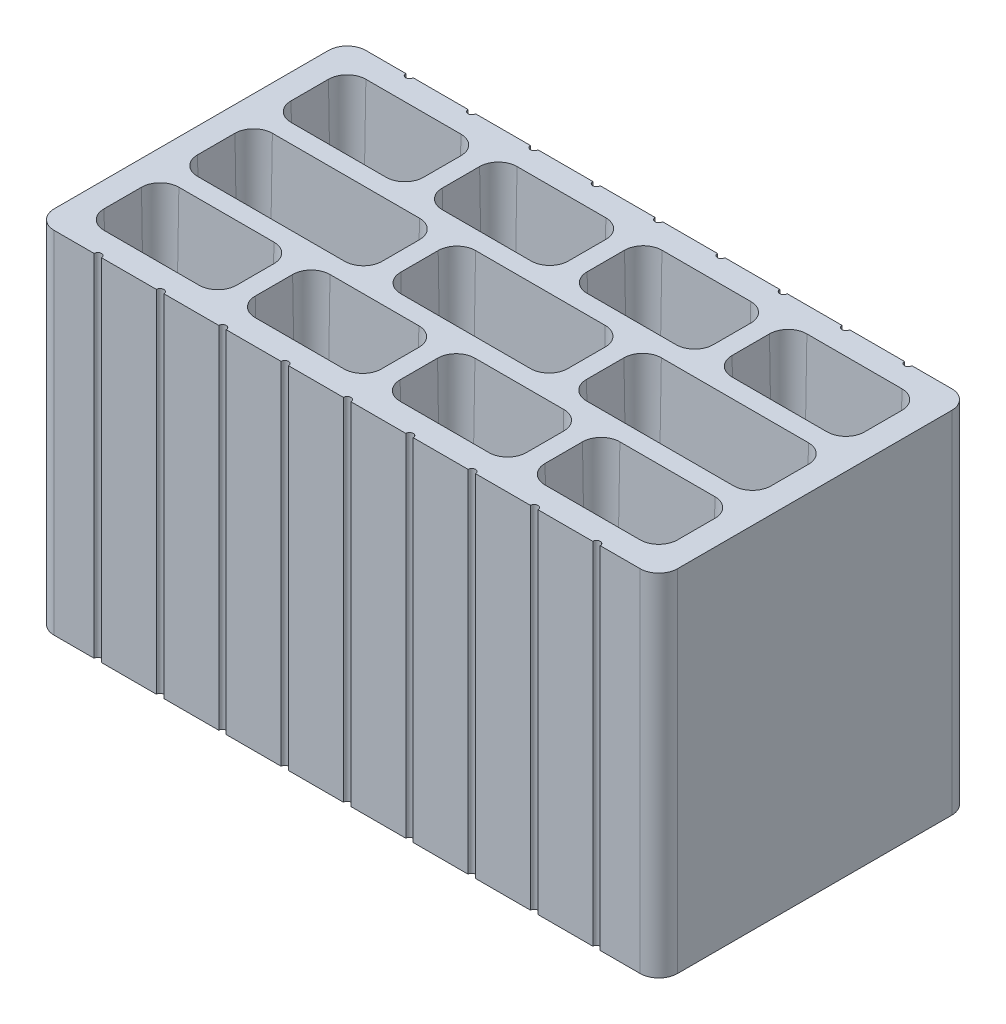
ISO-10303-21;
HEADER;
FILE_DESCRIPTION(('STEP AP214'),'2;1');
FILE_NAME('part.step','',(''),(''),'','','');
FILE_SCHEMA(('AUTOMOTIVE_DESIGN { 1 0 10303 214 1 1 1 1 }'));
ENDSEC;
DATA;
#1=APPLICATION_CONTEXT('core data for automotive mechanical design processes');
#2=APPLICATION_PROTOCOL_DEFINITION('international standard','automotive_design',2000,#1);
#3=PRODUCT_CONTEXT('',#1,'mechanical');
#4=PRODUCT('Part','Part','',(#3));
#5=PRODUCT_RELATED_PRODUCT_CATEGORY('part','',(#4));
#6=PRODUCT_DEFINITION_FORMATION('','',#4);
#7=PRODUCT_DEFINITION_CONTEXT('part definition',#1,'design');
#8=PRODUCT_DEFINITION('design','',#6,#7);
#9=PRODUCT_DEFINITION_SHAPE('','',#8);
#10=(LENGTH_UNIT() NAMED_UNIT(*) SI_UNIT(.MILLI.,.METRE.));
#11=(NAMED_UNIT(*) PLANE_ANGLE_UNIT() SI_UNIT($,.RADIAN.));
#12=(NAMED_UNIT(*) SI_UNIT($,.STERADIAN.) SOLID_ANGLE_UNIT());
#13=UNCERTAINTY_MEASURE_WITH_UNIT(LENGTH_MEASURE(1.E-05),#10,'distance_accuracy_value','');
#14=(GEOMETRIC_REPRESENTATION_CONTEXT(3) GLOBAL_UNCERTAINTY_ASSIGNED_CONTEXT((#13)) GLOBAL_UNIT_ASSIGNED_CONTEXT((#10,
#11,#12)) REPRESENTATION_CONTEXT('',''));
#15=CARTESIAN_POINT('',(0.,0.,0.));
#16=DIRECTION('',(0.,0.,1.));
#17=DIRECTION('',(1.,0.,0.));
#18=AXIS2_PLACEMENT_3D('',#15,#16,#17);
#19=CARTESIAN_POINT('',(40.,28.125,-25.));
#20=DIRECTION('',(0.,-1.,0.));
#21=DIRECTION('',(0.,0.,-1.));
#22=AXIS2_PLACEMENT_3D('',#19,#20,#21);
#23=PLANE('',#22);
#24=CARTESIAN_POINT('',(22.75,28.125,-3.5));
#25=DIRECTION('',(0.,1.,0.));
#26=DIRECTION('',(0.,0.,1.));
#27=AXIS2_PLACEMENT_3D('',#24,#25,#26);
#28=CIRCLE('',#27,1.5);
#29=CARTESIAN_POINT('',(22.75,28.125,-2.));
#30=VERTEX_POINT('',#29);
#31=CARTESIAN_POINT('',(24.25,28.125,-3.50000000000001));
#32=VERTEX_POINT('',#31);
#33=EDGE_CURVE('E864',#30,#32,#28,.T.);
#34=ORIENTED_EDGE('',*,*,#33,.F.);
#35=DIRECTION('',(1.,0.,0.));
#36=VECTOR('',#35,1.);
#37=CARTESIAN_POINT('',(15.625,28.125,-2.));
#38=LINE('',#37,#36);
#39=CARTESIAN_POINT('',(15.625,28.125,-2.));
#40=VERTEX_POINT('',#39);
#41=EDGE_CURVE('E904',#40,#30,#38,.T.);
#42=ORIENTED_EDGE('',*,*,#41,.F.);
#43=CARTESIAN_POINT('',(15.625,28.125,-3.5));
#44=DIRECTION('',(0.,1.,0.));
#45=DIRECTION('',(0.,0.,1.));
#46=AXIS2_PLACEMENT_3D('',#43,#44,#45);
#47=CIRCLE('',#46,1.5);
#48=CARTESIAN_POINT('',(14.125,28.125,-3.50000000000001));
#49=VERTEX_POINT('',#48);
#50=EDGE_CURVE('E1738',#49,#40,#47,.T.);
#51=ORIENTED_EDGE('',*,*,#50,.F.);
#52=DIRECTION('',(0.,0.,1.));
#53=VECTOR('',#52,1.);
#54=CARTESIAN_POINT('',(14.125,28.125,-6.49999999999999));
#55=LINE('',#54,#53);
#56=CARTESIAN_POINT('',(14.125,28.125,-6.49999999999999));
#57=VERTEX_POINT('',#56);
#58=EDGE_CURVE('E1741',#57,#49,#55,.T.);
#59=ORIENTED_EDGE('',*,*,#58,.F.);
#60=CARTESIAN_POINT('',(15.625,28.125,-6.5));
#61=DIRECTION('',(0.,1.,0.));
#62=DIRECTION('',(0.,0.,1.));
#63=AXIS2_PLACEMENT_3D('',#60,#61,#62);
#64=CIRCLE('',#63,1.5);
#65=CARTESIAN_POINT('',(15.625,28.125,-8.));
#66=VERTEX_POINT('',#65);
#67=EDGE_CURVE('E1744',#66,#57,#64,.T.);
#68=ORIENTED_EDGE('',*,*,#67,.F.);
#69=DIRECTION('',(-1.,0.,0.));
#70=VECTOR('',#69,1.);
#71=CARTESIAN_POINT('',(15.625,28.125,-8.));
#72=LINE('',#71,#70);
#73=CARTESIAN_POINT('',(22.75,28.125,-8.));
#74=VERTEX_POINT('',#73);
#75=EDGE_CURVE('E1747',#74,#66,#72,.T.);
#76=ORIENTED_EDGE('',*,*,#75,.F.);
#77=CARTESIAN_POINT('',(22.75,28.125,-6.5));
#78=DIRECTION('',(0.,1.,0.));
#79=DIRECTION('',(0.,0.,1.));
#80=AXIS2_PLACEMENT_3D('',#77,#78,#79);
#81=CIRCLE('',#80,1.5);
#82=CARTESIAN_POINT('',(24.25,28.125,-6.49999999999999));
#83=VERTEX_POINT('',#82);
#84=EDGE_CURVE('E1750',#83,#74,#81,.T.);
#85=ORIENTED_EDGE('',*,*,#84,.F.);
#86=DIRECTION('',(0.,0.,-1.));
#87=VECTOR('',#86,1.);
#88=CARTESIAN_POINT('',(24.25,28.125,-6.49999999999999));
#89=LINE('',#88,#87);
#90=EDGE_CURVE('E1753',#32,#83,#89,.T.);
#91=ORIENTED_EDGE('',*,*,#90,.F.);
#92=EDGE_LOOP('',(#34,#42,#51,#59,#68,#76,#85,#91));
#93=FACE_BOUND('',#92,.T.);
#94=CARTESIAN_POINT('',(46.5,28.125,-3.5));
#95=DIRECTION('',(0.,1.,0.));
#96=DIRECTION('',(0.,0.,1.));
#97=AXIS2_PLACEMENT_3D('',#94,#95,#96);
#98=CIRCLE('',#97,1.5);
#99=CARTESIAN_POINT('',(46.5,28.125,-2.));
#100=VERTEX_POINT('',#99);
#101=CARTESIAN_POINT('',(48.,28.125,-3.50000000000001));
#102=VERTEX_POINT('',#101);
#103=EDGE_CURVE('E1260',#100,#102,#98,.T.);
#104=ORIENTED_EDGE('',*,*,#103,.F.);
#105=DIRECTION('',(1.,0.,0.));
#106=VECTOR('',#105,1.);
#107=CARTESIAN_POINT('',(46.5,28.125,-2.));
#108=LINE('',#107,#106);
#109=CARTESIAN_POINT('',(38.875,28.125,-2.));
#110=VERTEX_POINT('',#109);
#111=EDGE_CURVE('E1297',#110,#100,#108,.T.);
#112=ORIENTED_EDGE('',*,*,#111,.F.);
#113=CARTESIAN_POINT('',(38.875,28.125,-3.5));
#114=DIRECTION('',(0.,1.,0.));
#115=DIRECTION('',(0.,0.,1.));
#116=AXIS2_PLACEMENT_3D('',#113,#114,#115);
#117=CIRCLE('',#116,1.5);
#118=CARTESIAN_POINT('',(37.375,28.125,-3.50000000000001));
#119=VERTEX_POINT('',#118);
#120=EDGE_CURVE('E1710',#119,#110,#117,.T.);
#121=ORIENTED_EDGE('',*,*,#120,.F.);
#122=DIRECTION('',(0.,0.,1.));
#123=VECTOR('',#122,1.);
#124=CARTESIAN_POINT('',(37.375,28.125,-6.49999999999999));
#125=LINE('',#124,#123);
#126=CARTESIAN_POINT('',(37.375,28.125,-6.49999999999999));
#127=VERTEX_POINT('',#126);
#128=EDGE_CURVE('E1713',#127,#119,#125,.T.);
#129=ORIENTED_EDGE('',*,*,#128,.F.);
#130=CARTESIAN_POINT('',(38.875,28.125,-6.5));
#131=DIRECTION('',(0.,1.,0.));
#132=DIRECTION('',(0.,0.,-1.));
#133=AXIS2_PLACEMENT_3D('',#130,#131,#132);
#134=CIRCLE('',#133,1.5);
#135=CARTESIAN_POINT('',(38.875,28.125,-8.));
#136=VERTEX_POINT('',#135);
#137=EDGE_CURVE('E1715',#136,#127,#134,.T.);
#138=ORIENTED_EDGE('',*,*,#137,.F.);
#139=DIRECTION('',(-1.,0.,0.));
#140=VECTOR('',#139,1.);
#141=CARTESIAN_POINT('',(46.5,28.125,-8.));
#142=LINE('',#141,#140);
#143=CARTESIAN_POINT('',(46.5,28.125,-8.));
#144=VERTEX_POINT('',#143);
#145=EDGE_CURVE('E1717',#144,#136,#142,.T.);
#146=ORIENTED_EDGE('',*,*,#145,.F.);
#147=CARTESIAN_POINT('',(46.5,28.125,-6.5));
#148=DIRECTION('',(0.,1.,0.));
#149=DIRECTION('',(0.,0.,1.));
#150=AXIS2_PLACEMENT_3D('',#147,#148,#149);
#151=CIRCLE('',#150,1.5);
#152=CARTESIAN_POINT('',(48.,28.125,-6.49999999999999));
#153=VERTEX_POINT('',#152);
#154=EDGE_CURVE('E1719',#153,#144,#151,.T.);
#155=ORIENTED_EDGE('',*,*,#154,.F.);
#156=DIRECTION('',(0.,0.,-1.));
#157=VECTOR('',#156,1.);
#158=CARTESIAN_POINT('',(48.,28.125,-6.49999999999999));
#159=LINE('',#158,#157);
#160=EDGE_CURVE('E1721',#102,#153,#159,.T.);
#161=ORIENTED_EDGE('',*,*,#160,.F.);
#162=EDGE_LOOP('',(#104,#112,#121,#129,#138,#146,#155,#161));
#163=FACE_BOUND('',#162,.T.);
#164=CARTESIAN_POINT('',(15.3,28.125,-11.));
#165=DIRECTION('',(0.,1.,0.));
#166=DIRECTION('',(0.,0.,1.));
#167=AXIS2_PLACEMENT_3D('',#164,#165,#166);
#168=CIRCLE('',#167,1.5);
#169=CARTESIAN_POINT('',(15.3,28.125,-9.5));
#170=VERTEX_POINT('',#169);
#171=CARTESIAN_POINT('',(16.8,28.125,-11.));
#172=VERTEX_POINT('',#171);
#173=EDGE_CURVE('E970',#170,#172,#168,.T.);
#174=ORIENTED_EDGE('',*,*,#173,.F.);
#175=DIRECTION('',(1.,0.,0.));
#176=VECTOR('',#175,1.);
#177=CARTESIAN_POINT('',(3.50000000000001,28.125,-9.5));
#178=LINE('',#177,#176);
#179=CARTESIAN_POINT('',(3.50000000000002,28.125,-9.5));
#180=VERTEX_POINT('',#179);
#181=EDGE_CURVE('E990',#180,#170,#178,.T.);
#182=ORIENTED_EDGE('',*,*,#181,.F.);
#183=CARTESIAN_POINT('',(3.5,28.125,-11.));
#184=DIRECTION('',(0.,1.,0.));
#185=DIRECTION('',(0.,0.,1.));
#186=AXIS2_PLACEMENT_3D('',#183,#184,#185);
#187=CIRCLE('',#186,1.5);
#188=CARTESIAN_POINT('',(2.,28.125,-11.));
#189=VERTEX_POINT('',#188);
#190=EDGE_CURVE('E1680',#189,#180,#187,.T.);
#191=ORIENTED_EDGE('',*,*,#190,.F.);
#192=DIRECTION('',(0.,0.,1.));
#193=VECTOR('',#192,1.);
#194=CARTESIAN_POINT('',(2.,28.125,-14.));
#195=LINE('',#194,#193);
#196=CARTESIAN_POINT('',(2.,28.125,-14.));
#197=VERTEX_POINT('',#196);
#198=EDGE_CURVE('E1683',#197,#189,#195,.T.);
#199=ORIENTED_EDGE('',*,*,#198,.F.);
#200=CARTESIAN_POINT('',(3.5,28.125,-14.));
#201=DIRECTION('',(0.,1.,0.));
#202=DIRECTION('',(0.,0.,1.));
#203=AXIS2_PLACEMENT_3D('',#200,#201,#202);
#204=CIRCLE('',#203,1.5);
#205=CARTESIAN_POINT('',(3.50000000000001,28.125,-15.5));
#206=VERTEX_POINT('',#205);
#207=EDGE_CURVE('E1685',#206,#197,#204,.T.);
#208=ORIENTED_EDGE('',*,*,#207,.F.);
#209=DIRECTION('',(-1.,0.,0.));
#210=VECTOR('',#209,1.);
#211=CARTESIAN_POINT('',(3.50000000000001,28.125,-15.5));
#212=LINE('',#211,#210);
#213=CARTESIAN_POINT('',(15.3,28.125,-15.5));
#214=VERTEX_POINT('',#213);
#215=EDGE_CURVE('E1687',#214,#206,#212,.T.);
#216=ORIENTED_EDGE('',*,*,#215,.F.);
#217=CARTESIAN_POINT('',(15.3,28.125,-14.));
#218=DIRECTION('',(0.,1.,0.));
#219=DIRECTION('',(0.,0.,-1.));
#220=AXIS2_PLACEMENT_3D('',#217,#218,#219);
#221=CIRCLE('',#220,1.5);
#222=CARTESIAN_POINT('',(16.8,28.125,-14.));
#223=VERTEX_POINT('',#222);
#224=EDGE_CURVE('E1689',#223,#214,#221,.T.);
#225=ORIENTED_EDGE('',*,*,#224,.F.);
#226=DIRECTION('',(0.,0.,-1.));
#227=VECTOR('',#226,1.);
#228=CARTESIAN_POINT('',(16.8,28.125,-14.));
#229=LINE('',#228,#227);
#230=EDGE_CURVE('E1691',#172,#223,#229,.T.);
#231=ORIENTED_EDGE('',*,*,#230,.F.);
#232=EDGE_LOOP('',(#174,#182,#191,#199,#208,#216,#225,#231));
#233=FACE_BOUND('',#232,.T.);
#234=CARTESIAN_POINT('',(34.375,28.125,-21.5));
#235=DIRECTION('',(0.,1.,0.));
#236=DIRECTION('',(0.,0.,1.));
#237=AXIS2_PLACEMENT_3D('',#234,#235,#236);
#238=CIRCLE('',#237,1.5);
#239=CARTESIAN_POINT('',(35.875,28.125,-21.5));
#240=VERTEX_POINT('',#239);
#241=CARTESIAN_POINT('',(34.375,28.125,-23.));
#242=VERTEX_POINT('',#241);
#243=EDGE_CURVE('E1150',#240,#242,#238,.T.);
#244=ORIENTED_EDGE('',*,*,#243,.F.);
#245=DIRECTION('',(0.,0.,-1.));
#246=VECTOR('',#245,1.);
#247=CARTESIAN_POINT('',(35.875,28.125,-18.5));
#248=LINE('',#247,#246);
#249=CARTESIAN_POINT('',(35.875,28.125,-18.5));
#250=VERTEX_POINT('',#249);
#251=EDGE_CURVE('E1168',#250,#240,#248,.T.);
#252=ORIENTED_EDGE('',*,*,#251,.F.);
#253=CARTESIAN_POINT('',(34.375,28.125,-18.5));
#254=DIRECTION('',(0.,1.,0.));
#255=DIRECTION('',(0.,0.,1.));
#256=AXIS2_PLACEMENT_3D('',#253,#254,#255);
#257=CIRCLE('',#256,1.5);
#258=CARTESIAN_POINT('',(34.375,28.125,-17.));
#259=VERTEX_POINT('',#258);
#260=EDGE_CURVE('E1650',#259,#250,#257,.T.);
#261=ORIENTED_EDGE('',*,*,#260,.F.);
#262=DIRECTION('',(1.,0.,0.));
#263=VECTOR('',#262,1.);
#264=CARTESIAN_POINT('',(34.375,28.125,-17.));
#265=LINE('',#264,#263);
#266=CARTESIAN_POINT('',(27.25,28.125,-17.));
#267=VERTEX_POINT('',#266);
#268=EDGE_CURVE('E1653',#267,#259,#265,.T.);
#269=ORIENTED_EDGE('',*,*,#268,.F.);
#270=CARTESIAN_POINT('',(27.25,28.125,-18.5));
#271=DIRECTION('',(0.,1.,0.));
#272=DIRECTION('',(0.,0.,-1.));
#273=AXIS2_PLACEMENT_3D('',#270,#271,#272);
#274=CIRCLE('',#273,1.5);
#275=CARTESIAN_POINT('',(25.75,28.125,-18.5));
#276=VERTEX_POINT('',#275);
#277=EDGE_CURVE('E1655',#276,#267,#274,.T.);
#278=ORIENTED_EDGE('',*,*,#277,.F.);
#279=DIRECTION('',(0.,0.,1.));
#280=VECTOR('',#279,1.);
#281=CARTESIAN_POINT('',(25.75,28.125,-18.5));
#282=LINE('',#281,#280);
#283=CARTESIAN_POINT('',(25.75,28.125,-21.5));
#284=VERTEX_POINT('',#283);
#285=EDGE_CURVE('E1657',#284,#276,#282,.T.);
#286=ORIENTED_EDGE('',*,*,#285,.F.);
#287=CARTESIAN_POINT('',(27.25,28.125,-21.5));
#288=DIRECTION('',(0.,1.,0.));
#289=DIRECTION('',(0.,0.,1.));
#290=AXIS2_PLACEMENT_3D('',#287,#288,#289);
#291=CIRCLE('',#290,1.5);
#292=CARTESIAN_POINT('',(27.25,28.125,-23.));
#293=VERTEX_POINT('',#292);
#294=EDGE_CURVE('E1659',#293,#284,#291,.T.);
#295=ORIENTED_EDGE('',*,*,#294,.F.);
#296=DIRECTION('',(-1.,0.,0.));
#297=VECTOR('',#296,1.);
#298=CARTESIAN_POINT('',(34.375,28.125,-23.));
#299=LINE('',#298,#297);
#300=EDGE_CURVE('E1661',#242,#293,#299,.T.);
#301=ORIENTED_EDGE('',*,*,#300,.F.);
#302=EDGE_LOOP('',(#244,#252,#261,#269,#278,#286,#295,#301));
#303=FACE_BOUND('',#302,.T.);
#304=CARTESIAN_POINT('',(46.5,28.125,-14.));
#305=DIRECTION('',(0.,1.,0.));
#306=DIRECTION('',(0.,0.,1.));
#307=AXIS2_PLACEMENT_3D('',#304,#305,#306);
#308=CIRCLE('',#307,1.5);
#309=CARTESIAN_POINT('',(48.,28.125,-14.));
#310=VERTEX_POINT('',#309);
#311=CARTESIAN_POINT('',(46.5,28.125,-15.5));
#312=VERTEX_POINT('',#311);
#313=EDGE_CURVE('E1054',#310,#312,#308,.T.);
#314=ORIENTED_EDGE('',*,*,#313,.F.);
#315=DIRECTION('',(0.,0.,-1.));
#316=VECTOR('',#315,1.);
#317=CARTESIAN_POINT('',(48.,28.125,-14.));
#318=LINE('',#317,#316);
#319=CARTESIAN_POINT('',(48.,28.125,-11.));
#320=VERTEX_POINT('',#319);
#321=EDGE_CURVE('E1076',#320,#310,#318,.T.);
#322=ORIENTED_EDGE('',*,*,#321,.F.);
#323=CARTESIAN_POINT('',(46.5,28.125,-11.));
#324=DIRECTION('',(0.,1.,0.));
#325=DIRECTION('',(0.,0.,1.));
#326=AXIS2_PLACEMENT_3D('',#323,#324,#325);
#327=CIRCLE('',#326,1.5);
#328=CARTESIAN_POINT('',(46.5,28.125,-9.5));
#329=VERTEX_POINT('',#328);
#330=EDGE_CURVE('E1620',#329,#320,#327,.T.);
#331=ORIENTED_EDGE('',*,*,#330,.F.);
#332=DIRECTION('',(1.,0.,0.));
#333=VECTOR('',#332,1.);
#334=CARTESIAN_POINT('',(46.5,28.125,-9.5));
#335=LINE('',#334,#333);
#336=CARTESIAN_POINT('',(34.7,28.125,-9.5));
#337=VERTEX_POINT('',#336);
#338=EDGE_CURVE('E1623',#337,#329,#335,.T.);
#339=ORIENTED_EDGE('',*,*,#338,.F.);
#340=CARTESIAN_POINT('',(34.7,28.125,-11.));
#341=DIRECTION('',(0.,1.,0.));
#342=DIRECTION('',(0.,0.,1.));
#343=AXIS2_PLACEMENT_3D('',#340,#341,#342);
#344=CIRCLE('',#343,1.5);
#345=CARTESIAN_POINT('',(33.2,28.125,-11.));
#346=VERTEX_POINT('',#345);
#347=EDGE_CURVE('E1625',#346,#337,#344,.T.);
#348=ORIENTED_EDGE('',*,*,#347,.F.);
#349=DIRECTION('',(0.,0.,1.));
#350=VECTOR('',#349,1.);
#351=CARTESIAN_POINT('',(33.2,28.125,-14.));
#352=LINE('',#351,#350);
#353=CARTESIAN_POINT('',(33.2,28.125,-14.));
#354=VERTEX_POINT('',#353);
#355=EDGE_CURVE('E1627',#354,#346,#352,.T.);
#356=ORIENTED_EDGE('',*,*,#355,.F.);
#357=CARTESIAN_POINT('',(34.7,28.125,-14.));
#358=DIRECTION('',(0.,1.,0.));
#359=DIRECTION('',(0.,0.,-1.));
#360=AXIS2_PLACEMENT_3D('',#357,#358,#359);
#361=CIRCLE('',#360,1.5);
#362=CARTESIAN_POINT('',(34.7,28.125,-15.5));
#363=VERTEX_POINT('',#362);
#364=EDGE_CURVE('E1629',#363,#354,#361,.T.);
#365=ORIENTED_EDGE('',*,*,#364,.F.);
#366=DIRECTION('',(-1.,0.,0.));
#367=VECTOR('',#366,1.);
#368=CARTESIAN_POINT('',(46.5,28.125,-15.5));
#369=LINE('',#368,#367);
#370=EDGE_CURVE('E1631',#312,#363,#369,.T.);
#371=ORIENTED_EDGE('',*,*,#370,.F.);
#372=EDGE_LOOP('',(#314,#322,#331,#339,#348,#356,#365,#371));
#373=FACE_BOUND('',#372,.T.);
#374=CARTESIAN_POINT('',(40.,28.125,-25.));
#375=DIRECTION('',(0.,-1.,0.));
#376=DIRECTION('',(0.,0.,-1.));
#377=AXIS2_PLACEMENT_3D('',#374,#375,#376);
#378=CIRCLE('',#377,0.299999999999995);
#379=CARTESIAN_POINT('',(40.3,28.125,-25.));
#380=VERTEX_POINT('',#379);
#381=CARTESIAN_POINT('',(39.7,28.125,-25.));
#382=VERTEX_POINT('',#381);
#383=EDGE_CURVE('E1430',#380,#382,#378,.T.);
#384=ORIENTED_EDGE('',*,*,#383,.T.);
#385=DIRECTION('',(-1.,0.,0.));
#386=VECTOR('',#385,1.);
#387=CARTESIAN_POINT('',(35.3,28.125,-25.));
#388=LINE('',#387,#386);
#389=CARTESIAN_POINT('',(35.3,28.125,-25.));
#390=VERTEX_POINT('',#389);
#391=EDGE_CURVE('E1600',#382,#390,#388,.T.);
#392=ORIENTED_EDGE('',*,*,#391,.T.);
#393=CARTESIAN_POINT('',(35.,28.125,-25.));
#394=DIRECTION('',(0.,-1.,0.));
#395=DIRECTION('',(0.,0.,-1.));
#396=AXIS2_PLACEMENT_3D('',#393,#394,#395);
#397=CIRCLE('',#396,0.299999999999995);
#398=CARTESIAN_POINT('',(34.7,28.125,-25.));
#399=VERTEX_POINT('',#398);
#400=EDGE_CURVE('E1598',#390,#399,#397,.T.);
#401=ORIENTED_EDGE('',*,*,#400,.T.);
#402=DIRECTION('',(-1.,0.,0.));
#403=VECTOR('',#402,1.);
#404=CARTESIAN_POINT('',(30.3,28.125,-25.));
#405=LINE('',#404,#403);
#406=CARTESIAN_POINT('',(30.3,28.125,-25.));
#407=VERTEX_POINT('',#406);
#408=EDGE_CURVE('E1596',#399,#407,#405,.T.);
#409=ORIENTED_EDGE('',*,*,#408,.T.);
#410=CARTESIAN_POINT('',(30.,28.125,-25.));
#411=DIRECTION('',(0.,-1.,0.));
#412=DIRECTION('',(0.,0.,-1.));
#413=AXIS2_PLACEMENT_3D('',#410,#411,#412);
#414=CIRCLE('',#413,0.299999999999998);
#415=CARTESIAN_POINT('',(29.7,28.125,-25.));
#416=VERTEX_POINT('',#415);
#417=EDGE_CURVE('E1594',#407,#416,#414,.T.);
#418=ORIENTED_EDGE('',*,*,#417,.T.);
#419=DIRECTION('',(-1.,0.,0.));
#420=VECTOR('',#419,1.);
#421=CARTESIAN_POINT('',(25.3,28.125,-25.));
#422=LINE('',#421,#420);
#423=CARTESIAN_POINT('',(25.3,28.125,-25.));
#424=VERTEX_POINT('',#423);
#425=EDGE_CURVE('E1592',#416,#424,#422,.T.);
#426=ORIENTED_EDGE('',*,*,#425,.T.);
#427=CARTESIAN_POINT('',(25.,28.125,-25.));
#428=DIRECTION('',(0.,-1.,0.));
#429=DIRECTION('',(0.,0.,-1.));
#430=AXIS2_PLACEMENT_3D('',#427,#428,#429);
#431=CIRCLE('',#430,0.299999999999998);
#432=CARTESIAN_POINT('',(24.7,28.125,-25.));
#433=VERTEX_POINT('',#432);
#434=EDGE_CURVE('E1590',#424,#433,#431,.T.);
#435=ORIENTED_EDGE('',*,*,#434,.T.);
#436=DIRECTION('',(-1.,0.,0.));
#437=VECTOR('',#436,1.);
#438=CARTESIAN_POINT('',(20.3,28.125,-25.));
#439=LINE('',#438,#437);
#440=CARTESIAN_POINT('',(20.3,28.125,-25.));
#441=VERTEX_POINT('',#440);
#442=EDGE_CURVE('E1588',#433,#441,#439,.T.);
#443=ORIENTED_EDGE('',*,*,#442,.T.);
#444=CARTESIAN_POINT('',(20.,28.125,-25.));
#445=DIRECTION('',(0.,-1.,0.));
#446=DIRECTION('',(0.,0.,-1.));
#447=AXIS2_PLACEMENT_3D('',#444,#445,#446);
#448=CIRCLE('',#447,0.299999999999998);
#449=CARTESIAN_POINT('',(19.7,28.125,-25.));
#450=VERTEX_POINT('',#449);
#451=EDGE_CURVE('E1586',#441,#450,#448,.T.);
#452=ORIENTED_EDGE('',*,*,#451,.T.);
#453=DIRECTION('',(-1.,0.,0.));
#454=VECTOR('',#453,1.);
#455=CARTESIAN_POINT('',(15.3,28.125,-25.));
#456=LINE('',#455,#454);
#457=CARTESIAN_POINT('',(15.3,28.125,-25.));
#458=VERTEX_POINT('',#457);
#459=EDGE_CURVE('E1584',#450,#458,#456,.T.);
#460=ORIENTED_EDGE('',*,*,#459,.T.);
#461=CARTESIAN_POINT('',(15.,28.125,-25.));
#462=DIRECTION('',(0.,-1.,0.));
#463=DIRECTION('',(0.,0.,-1.));
#464=AXIS2_PLACEMENT_3D('',#461,#462,#463);
#465=CIRCLE('',#464,0.3);
#466=CARTESIAN_POINT('',(14.7,28.125,-25.));
#467=VERTEX_POINT('',#466);
#468=EDGE_CURVE('E1582',#458,#467,#465,.T.);
#469=ORIENTED_EDGE('',*,*,#468,.T.);
#470=DIRECTION('',(-1.,0.,0.));
#471=VECTOR('',#470,1.);
#472=CARTESIAN_POINT('',(10.3,28.125,-25.));
#473=LINE('',#472,#471);
#474=CARTESIAN_POINT('',(10.3,28.125,-25.));
#475=VERTEX_POINT('',#474);
#476=EDGE_CURVE('E1580',#467,#475,#473,.T.);
#477=ORIENTED_EDGE('',*,*,#476,.T.);
#478=CARTESIAN_POINT('',(10.,28.125,-25.));
#479=DIRECTION('',(0.,-1.,0.));
#480=DIRECTION('',(0.,0.,-1.));
#481=AXIS2_PLACEMENT_3D('',#478,#479,#480);
#482=CIRCLE('',#481,0.3);
#483=CARTESIAN_POINT('',(9.7,28.125,-25.));
#484=VERTEX_POINT('',#483);
#485=EDGE_CURVE('E1578',#475,#484,#482,.T.);
#486=ORIENTED_EDGE('',*,*,#485,.T.);
#487=DIRECTION('',(-1.,0.,0.));
#488=VECTOR('',#487,1.);
#489=CARTESIAN_POINT('',(5.3,28.125,-25.));
#490=LINE('',#489,#488);
#491=CARTESIAN_POINT('',(5.3,28.125,-25.));
#492=VERTEX_POINT('',#491);
#493=EDGE_CURVE('E1576',#484,#492,#490,.T.);
#494=ORIENTED_EDGE('',*,*,#493,.T.);
#495=CARTESIAN_POINT('',(5.,28.125,-25.));
#496=DIRECTION('',(0.,-1.,0.));
#497=DIRECTION('',(0.,0.,-1.));
#498=AXIS2_PLACEMENT_3D('',#495,#496,#497);
#499=CIRCLE('',#498,0.3);
#500=CARTESIAN_POINT('',(4.7,28.125,-25.));
#501=VERTEX_POINT('',#500);
#502=EDGE_CURVE('E1574',#492,#501,#499,.T.);
#503=ORIENTED_EDGE('',*,*,#502,.T.);
#504=DIRECTION('',(-1.,0.,0.));
#505=VECTOR('',#504,1.);
#506=CARTESIAN_POINT('',(1.50000000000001,28.125,-25.));
#507=LINE('',#506,#505);
#508=CARTESIAN_POINT('',(1.50000000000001,28.125,-25.));
#509=VERTEX_POINT('',#508);
#510=EDGE_CURVE('E1572',#501,#509,#507,.T.);
#511=ORIENTED_EDGE('',*,*,#510,.T.);
#512=CARTESIAN_POINT('',(1.5,28.125,-23.5));
#513=DIRECTION('',(0.,1.,0.));
#514=DIRECTION('',(0.,0.,-1.));
#515=AXIS2_PLACEMENT_3D('',#512,#513,#514);
#516=CIRCLE('',#515,1.5);
#517=CARTESIAN_POINT('',(0.,28.125,-23.5));
#518=VERTEX_POINT('',#517);
#519=EDGE_CURVE('E1570',#509,#518,#516,.T.);
#520=ORIENTED_EDGE('',*,*,#519,.T.);
#521=DIRECTION('',(0.,0.,1.));
#522=VECTOR('',#521,1.);
#523=CARTESIAN_POINT('',(0.,28.125,-1.50000000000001));
#524=LINE('',#523,#522);
#525=CARTESIAN_POINT('',(0.,28.125,-1.50000000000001));
#526=VERTEX_POINT('',#525);
#527=EDGE_CURVE('E1568',#518,#526,#524,.T.);
#528=ORIENTED_EDGE('',*,*,#527,.T.);
#529=CARTESIAN_POINT('',(1.5,28.125,-1.5));
#530=DIRECTION('',(0.,1.,0.));
#531=DIRECTION('',(0.,0.,-1.));
#532=AXIS2_PLACEMENT_3D('',#529,#530,#531);
#533=CIRCLE('',#532,1.5);
#534=CARTESIAN_POINT('',(1.50000000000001,28.125,0.));
#535=VERTEX_POINT('',#534);
#536=EDGE_CURVE('E1566',#526,#535,#533,.T.);
#537=ORIENTED_EDGE('',*,*,#536,.T.);
#538=DIRECTION('',(1.,0.,0.));
#539=VECTOR('',#538,1.);
#540=CARTESIAN_POINT('',(1.50000000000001,28.125,0.));
#541=LINE('',#540,#539);
#542=CARTESIAN_POINT('',(4.7,28.125,0.));
#543=VERTEX_POINT('',#542);
#544=EDGE_CURVE('E1564',#535,#543,#541,.T.);
#545=ORIENTED_EDGE('',*,*,#544,.T.);
#546=CARTESIAN_POINT('',(5.,28.125,0.));
#547=DIRECTION('',(0.,-1.,0.));
#548=DIRECTION('',(0.,0.,1.));
#549=AXIS2_PLACEMENT_3D('',#546,#547,#548);
#550=CIRCLE('',#549,0.3);
#551=CARTESIAN_POINT('',(5.3,28.125,0.));
#552=VERTEX_POINT('',#551);
#553=EDGE_CURVE('E1562',#543,#552,#550,.T.);
#554=ORIENTED_EDGE('',*,*,#553,.T.);
#555=DIRECTION('',(1.,0.,0.));
#556=VECTOR('',#555,1.);
#557=CARTESIAN_POINT('',(5.3,28.125,0.));
#558=LINE('',#557,#556);
#559=CARTESIAN_POINT('',(9.7,28.125,0.));
#560=VERTEX_POINT('',#559);
#561=EDGE_CURVE('E1560',#552,#560,#558,.T.);
#562=ORIENTED_EDGE('',*,*,#561,.T.);
#563=CARTESIAN_POINT('',(10.,28.125,0.));
#564=DIRECTION('',(0.,-1.,0.));
#565=DIRECTION('',(0.,0.,1.));
#566=AXIS2_PLACEMENT_3D('',#563,#564,#565);
#567=CIRCLE('',#566,0.3);
#568=CARTESIAN_POINT('',(10.3,28.125,0.));
#569=VERTEX_POINT('',#568);
#570=EDGE_CURVE('E1558',#560,#569,#567,.T.);
#571=ORIENTED_EDGE('',*,*,#570,.T.);
#572=DIRECTION('',(1.,0.,0.));
#573=VECTOR('',#572,1.);
#574=CARTESIAN_POINT('',(10.3,28.125,0.));
#575=LINE('',#574,#573);
#576=CARTESIAN_POINT('',(14.7,28.125,0.));
#577=VERTEX_POINT('',#576);
#578=EDGE_CURVE('E1556',#569,#577,#575,.T.);
#579=ORIENTED_EDGE('',*,*,#578,.T.);
#580=CARTESIAN_POINT('',(15.,28.125,0.));
#581=DIRECTION('',(0.,-1.,0.));
#582=DIRECTION('',(0.,0.,1.));
#583=AXIS2_PLACEMENT_3D('',#580,#581,#582);
#584=CIRCLE('',#583,0.3);
#585=CARTESIAN_POINT('',(15.3,28.125,0.));
#586=VERTEX_POINT('',#585);
#587=EDGE_CURVE('E1554',#577,#586,#584,.T.);
#588=ORIENTED_EDGE('',*,*,#587,.T.);
#589=DIRECTION('',(1.,0.,0.));
#590=VECTOR('',#589,1.);
#591=CARTESIAN_POINT('',(15.3,28.125,0.));
#592=LINE('',#591,#590);
#593=CARTESIAN_POINT('',(19.7,28.125,0.));
#594=VERTEX_POINT('',#593);
#595=EDGE_CURVE('E1552',#586,#594,#592,.T.);
#596=ORIENTED_EDGE('',*,*,#595,.T.);
#597=CARTESIAN_POINT('',(20.,28.125,0.));
#598=DIRECTION('',(0.,-1.,0.));
#599=DIRECTION('',(0.,0.,1.));
#600=AXIS2_PLACEMENT_3D('',#597,#598,#599);
#601=CIRCLE('',#600,0.300000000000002);
#602=CARTESIAN_POINT('',(20.3,28.125,0.));
#603=VERTEX_POINT('',#602);
#604=EDGE_CURVE('E1550',#594,#603,#601,.T.);
#605=ORIENTED_EDGE('',*,*,#604,.T.);
#606=DIRECTION('',(1.,0.,0.));
#607=VECTOR('',#606,1.);
#608=CARTESIAN_POINT('',(20.3,28.125,0.));
#609=LINE('',#608,#607);
#610=CARTESIAN_POINT('',(24.7,28.125,0.));
#611=VERTEX_POINT('',#610);
#612=EDGE_CURVE('E1548',#603,#611,#609,.T.);
#613=ORIENTED_EDGE('',*,*,#612,.T.);
#614=CARTESIAN_POINT('',(25.,28.125,0.));
#615=DIRECTION('',(0.,-1.,0.));
#616=DIRECTION('',(0.,0.,1.));
#617=AXIS2_PLACEMENT_3D('',#614,#615,#616);
#618=CIRCLE('',#617,0.300000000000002);
#619=CARTESIAN_POINT('',(25.3,28.125,0.));
#620=VERTEX_POINT('',#619);
#621=EDGE_CURVE('E1546',#611,#620,#618,.T.);
#622=ORIENTED_EDGE('',*,*,#621,.T.);
#623=DIRECTION('',(1.,0.,0.));
#624=VECTOR('',#623,1.);
#625=CARTESIAN_POINT('',(25.3,28.125,0.));
#626=LINE('',#625,#624);
#627=CARTESIAN_POINT('',(29.7,28.125,0.));
#628=VERTEX_POINT('',#627);
#629=EDGE_CURVE('E1544',#620,#628,#626,.T.);
#630=ORIENTED_EDGE('',*,*,#629,.T.);
#631=CARTESIAN_POINT('',(30.,28.125,0.));
#632=DIRECTION('',(0.,-1.,0.));
#633=DIRECTION('',(0.,0.,1.));
#634=AXIS2_PLACEMENT_3D('',#631,#632,#633);
#635=CIRCLE('',#634,0.300000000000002);
#636=CARTESIAN_POINT('',(30.3,28.125,0.));
#637=VERTEX_POINT('',#636);
#638=EDGE_CURVE('E1542',#628,#637,#635,.T.);
#639=ORIENTED_EDGE('',*,*,#638,.T.);
#640=DIRECTION('',(1.,0.,0.));
#641=VECTOR('',#640,1.);
#642=CARTESIAN_POINT('',(30.3,28.125,0.));
#643=LINE('',#642,#641);
#644=CARTESIAN_POINT('',(34.7,28.125,0.));
#645=VERTEX_POINT('',#644);
#646=EDGE_CURVE('E1540',#637,#645,#643,.T.);
#647=ORIENTED_EDGE('',*,*,#646,.T.);
#648=CARTESIAN_POINT('',(35.,28.125,0.));
#649=DIRECTION('',(0.,-1.,0.));
#650=DIRECTION('',(0.,0.,1.));
#651=AXIS2_PLACEMENT_3D('',#648,#649,#650);
#652=CIRCLE('',#651,0.299999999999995);
#653=CARTESIAN_POINT('',(35.3,28.125,0.));
#654=VERTEX_POINT('',#653);
#655=EDGE_CURVE('E1538',#645,#654,#652,.T.);
#656=ORIENTED_EDGE('',*,*,#655,.T.);
#657=DIRECTION('',(1.,0.,0.));
#658=VECTOR('',#657,1.);
#659=CARTESIAN_POINT('',(35.3,28.125,0.));
#660=LINE('',#659,#658);
#661=CARTESIAN_POINT('',(39.7,28.125,0.));
#662=VERTEX_POINT('',#661);
#663=EDGE_CURVE('E1536',#654,#662,#660,.T.);
#664=ORIENTED_EDGE('',*,*,#663,.T.);
#665=CARTESIAN_POINT('',(40.,28.125,0.));
#666=DIRECTION('',(0.,-1.,0.));
#667=DIRECTION('',(0.,0.,1.));
#668=AXIS2_PLACEMENT_3D('',#665,#666,#667);
#669=CIRCLE('',#668,0.299999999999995);
#670=CARTESIAN_POINT('',(40.3,28.125,0.));
#671=VERTEX_POINT('',#670);
#672=EDGE_CURVE('E1534',#662,#671,#669,.T.);
#673=ORIENTED_EDGE('',*,*,#672,.T.);
#674=DIRECTION('',(1.,0.,0.));
#675=VECTOR('',#674,1.);
#676=CARTESIAN_POINT('',(40.3,28.125,0.));
#677=LINE('',#676,#675);
#678=CARTESIAN_POINT('',(44.7,28.125,0.));
#679=VERTEX_POINT('',#678);
#680=EDGE_CURVE('E1532',#671,#679,#677,.T.);
#681=ORIENTED_EDGE('',*,*,#680,.T.);
#682=CARTESIAN_POINT('',(45.,28.125,0.));
#683=DIRECTION('',(0.,-1.,0.));
#684=DIRECTION('',(0.,0.,1.));
#685=AXIS2_PLACEMENT_3D('',#682,#683,#684);
#686=CIRCLE('',#685,0.299999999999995);
#687=CARTESIAN_POINT('',(45.3,28.125,0.));
#688=VERTEX_POINT('',#687);
#689=EDGE_CURVE('E1530',#679,#688,#686,.T.);
#690=ORIENTED_EDGE('',*,*,#689,.T.);
#691=DIRECTION('',(1.,0.,0.));
#692=VECTOR('',#691,1.);
#693=CARTESIAN_POINT('',(45.3,28.125,0.));
#694=LINE('',#693,#692);
#695=CARTESIAN_POINT('',(48.5,28.125,0.));
#696=VERTEX_POINT('',#695);
#697=EDGE_CURVE('E1528',#688,#696,#694,.T.);
#698=ORIENTED_EDGE('',*,*,#697,.T.);
#699=CARTESIAN_POINT('',(48.5,28.125,-1.5));
#700=DIRECTION('',(0.,1.,0.));
#701=DIRECTION('',(0.,0.,1.));
#702=AXIS2_PLACEMENT_3D('',#699,#700,#701);
#703=CIRCLE('',#702,1.5);
#704=CARTESIAN_POINT('',(50.,28.125,-1.50000000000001));
#705=VERTEX_POINT('',#704);
#706=EDGE_CURVE('E1526',#696,#705,#703,.T.);
#707=ORIENTED_EDGE('',*,*,#706,.T.);
#708=DIRECTION('',(0.,0.,-1.));
#709=VECTOR('',#708,1.);
#710=CARTESIAN_POINT('',(50.,28.125,-1.50000000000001));
#711=LINE('',#710,#709);
#712=CARTESIAN_POINT('',(50.,28.125,-23.5));
#713=VERTEX_POINT('',#712);
#714=EDGE_CURVE('E1524',#705,#713,#711,.T.);
#715=ORIENTED_EDGE('',*,*,#714,.T.);
#716=CARTESIAN_POINT('',(48.5,28.125,-23.5));
#717=DIRECTION('',(0.,1.,0.));
#718=DIRECTION('',(0.,0.,-1.));
#719=AXIS2_PLACEMENT_3D('',#716,#717,#718);
#720=CIRCLE('',#719,1.5);
#721=CARTESIAN_POINT('',(48.5,28.125,-25.));
#722=VERTEX_POINT('',#721);
#723=EDGE_CURVE('E1522',#713,#722,#720,.T.);
#724=ORIENTED_EDGE('',*,*,#723,.T.);
#725=DIRECTION('',(-1.,0.,0.));
#726=VECTOR('',#725,1.);
#727=CARTESIAN_POINT('',(45.3,28.125,-25.));
#728=LINE('',#727,#726);
#729=CARTESIAN_POINT('',(45.3,28.125,-25.));
#730=VERTEX_POINT('',#729);
#731=EDGE_CURVE('E1520',#722,#730,#728,.T.);
#732=ORIENTED_EDGE('',*,*,#731,.T.);
#733=CARTESIAN_POINT('',(45.,28.125,-25.));
#734=DIRECTION('',(0.,-1.,0.));
#735=DIRECTION('',(0.,0.,-1.));
#736=AXIS2_PLACEMENT_3D('',#733,#734,#735);
#737=CIRCLE('',#736,0.299999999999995);
#738=CARTESIAN_POINT('',(44.7,28.125,-25.));
#739=VERTEX_POINT('',#738);
#740=EDGE_CURVE('E1518',#730,#739,#737,.T.);
#741=ORIENTED_EDGE('',*,*,#740,.T.);
#742=DIRECTION('',(-1.,0.,0.));
#743=VECTOR('',#742,1.);
#744=CARTESIAN_POINT('',(40.3,28.125,-25.));
#745=LINE('',#744,#743);
#746=EDGE_CURVE('E1427',#739,#380,#745,.T.);
#747=ORIENTED_EDGE('',*,*,#746,.T.);
#748=EDGE_LOOP('',(#384,#392,#401,#409,#418,#426,#435,#443,#452,#460,#469,#477,#486,#494,#503,
#511,#520,#528,#537,#545,#554,#562,#571,#579,#588,#596,#605,#613,#622,#630,#639,#647,#656,#664,
#673,#681,#690,#698,#707,#715,#724,#732,#741,#747));
#749=FACE_BOUND('',#748,.T.);
#750=CARTESIAN_POINT('',(46.5,28.125,-21.5));
#751=DIRECTION('',(0.,1.,0.));
#752=DIRECTION('',(0.,0.,1.));
#753=AXIS2_PLACEMENT_3D('',#750,#751,#752);
#754=CIRCLE('',#753,1.5);
#755=CARTESIAN_POINT('',(48.,28.125,-21.5));
#756=VERTEX_POINT('',#755);
#757=CARTESIAN_POINT('',(46.5,28.125,-23.));
#758=VERTEX_POINT('',#757);
#759=EDGE_CURVE('E1104',#756,#758,#754,.T.);
#760=ORIENTED_EDGE('',*,*,#759,.F.);
#761=DIRECTION('',(0.,0.,-1.));
#762=VECTOR('',#761,1.);
#763=CARTESIAN_POINT('',(48.,28.125,-18.5));
#764=LINE('',#763,#762);
#765=CARTESIAN_POINT('',(48.,28.125,-18.5));
#766=VERTEX_POINT('',#765);
#767=EDGE_CURVE('E1111',#766,#756,#764,.T.);
#768=ORIENTED_EDGE('',*,*,#767,.F.);
#769=CARTESIAN_POINT('',(46.5,28.125,-18.5));
#770=DIRECTION('',(0.,1.,0.));
#771=DIRECTION('',(0.,0.,1.));
#772=AXIS2_PLACEMENT_3D('',#769,#770,#771);
#773=CIRCLE('',#772,1.5);
#774=CARTESIAN_POINT('',(46.5,28.125,-17.));
#775=VERTEX_POINT('',#774);
#776=EDGE_CURVE('E1605',#775,#766,#773,.T.);
#777=ORIENTED_EDGE('',*,*,#776,.F.);
#778=DIRECTION('',(1.,0.,0.));
#779=VECTOR('',#778,1.);
#780=CARTESIAN_POINT('',(46.5,28.125,-17.));
#781=LINE('',#780,#779);
#782=CARTESIAN_POINT('',(38.875,28.125,-17.));
#783=VERTEX_POINT('',#782);
#784=EDGE_CURVE('E1608',#783,#775,#781,.T.);
#785=ORIENTED_EDGE('',*,*,#784,.F.);
#786=CARTESIAN_POINT('',(38.875,28.125,-18.5));
#787=DIRECTION('',(0.,1.,0.));
#788=DIRECTION('',(0.,0.,-1.));
#789=AXIS2_PLACEMENT_3D('',#786,#787,#788);
#790=CIRCLE('',#789,1.5);
#791=CARTESIAN_POINT('',(37.375,28.125,-18.5));
#792=VERTEX_POINT('',#791);
#793=EDGE_CURVE('E1610',#792,#783,#790,.T.);
#794=ORIENTED_EDGE('',*,*,#793,.F.);
#795=DIRECTION('',(0.,0.,1.));
#796=VECTOR('',#795,1.);
#797=CARTESIAN_POINT('',(37.375,28.125,-18.5));
#798=LINE('',#797,#796);
#799=CARTESIAN_POINT('',(37.375,28.125,-21.5));
#800=VERTEX_POINT('',#799);
#801=EDGE_CURVE('E1612',#800,#792,#798,.T.);
#802=ORIENTED_EDGE('',*,*,#801,.F.);
#803=CARTESIAN_POINT('',(38.875,28.125,-21.5));
#804=DIRECTION('',(0.,1.,0.));
#805=DIRECTION('',(0.,0.,1.));
#806=AXIS2_PLACEMENT_3D('',#803,#804,#805);
#807=CIRCLE('',#806,1.5);
#808=CARTESIAN_POINT('',(38.875,28.125,-23.));
#809=VERTEX_POINT('',#808);
#810=EDGE_CURVE('E1614',#809,#800,#807,.T.);
#811=ORIENTED_EDGE('',*,*,#810,.F.);
#812=DIRECTION('',(-1.,0.,0.));
#813=VECTOR('',#812,1.);
#814=CARTESIAN_POINT('',(46.5,28.125,-23.));
#815=LINE('',#814,#813);
#816=EDGE_CURVE('E1616',#758,#809,#815,.T.);
#817=ORIENTED_EDGE('',*,*,#816,.F.);
#818=EDGE_LOOP('',(#760,#768,#777,#785,#794,#802,#811,#817));
#819=FACE_BOUND('',#818,.T.);
#820=CARTESIAN_POINT('',(30.2,28.125,-11.));
#821=DIRECTION('',(0.,1.,0.));
#822=DIRECTION('',(0.,0.,-1.));
#823=AXIS2_PLACEMENT_3D('',#820,#821,#822);
#824=CIRCLE('',#823,1.5);
#825=CARTESIAN_POINT('',(30.2,28.125,-9.5));
#826=VERTEX_POINT('',#825);
#827=CARTESIAN_POINT('',(31.7,28.125,-11.));
#828=VERTEX_POINT('',#827);
#829=EDGE_CURVE('E1016',#826,#828,#824,.T.);
#830=ORIENTED_EDGE('',*,*,#829,.F.);
#831=DIRECTION('',(1.,0.,0.));
#832=VECTOR('',#831,1.);
#833=CARTESIAN_POINT('',(30.2,28.125,-9.5));
#834=LINE('',#833,#832);
#835=CARTESIAN_POINT('',(19.8,28.125,-9.5));
#836=VERTEX_POINT('',#835);
#837=EDGE_CURVE('E1023',#836,#826,#834,.T.);
#838=ORIENTED_EDGE('',*,*,#837,.F.);
#839=CARTESIAN_POINT('',(19.8,28.125,-11.));
#840=DIRECTION('',(0.,1.,0.));
#841=DIRECTION('',(0.,0.,1.));
#842=AXIS2_PLACEMENT_3D('',#839,#840,#841);
#843=CIRCLE('',#842,1.5);
#844=CARTESIAN_POINT('',(18.3,28.125,-11.));
#845=VERTEX_POINT('',#844);
#846=EDGE_CURVE('E1635',#845,#836,#843,.T.);
#847=ORIENTED_EDGE('',*,*,#846,.F.);
#848=DIRECTION('',(0.,0.,1.));
#849=VECTOR('',#848,1.);
#850=CARTESIAN_POINT('',(18.3,28.125,-14.));
#851=LINE('',#850,#849);
#852=CARTESIAN_POINT('',(18.3,28.125,-14.));
#853=VERTEX_POINT('',#852);
#854=EDGE_CURVE('E1638',#853,#845,#851,.T.);
#855=ORIENTED_EDGE('',*,*,#854,.F.);
#856=CARTESIAN_POINT('',(19.8,28.125,-14.));
#857=DIRECTION('',(0.,1.,0.));
#858=DIRECTION('',(0.,0.,1.));
#859=AXIS2_PLACEMENT_3D('',#856,#857,#858);
#860=CIRCLE('',#859,1.5);
#861=CARTESIAN_POINT('',(19.8,28.125,-15.5));
#862=VERTEX_POINT('',#861);
#863=EDGE_CURVE('E1640',#862,#853,#860,.T.);
#864=ORIENTED_EDGE('',*,*,#863,.F.);
#865=DIRECTION('',(-1.,0.,0.));
#866=VECTOR('',#865,1.);
#867=CARTESIAN_POINT('',(19.8,28.125,-15.5));
#868=LINE('',#867,#866);
#869=CARTESIAN_POINT('',(30.2,28.125,-15.5));
#870=VERTEX_POINT('',#869);
#871=EDGE_CURVE('E1642',#870,#862,#868,.T.);
#872=ORIENTED_EDGE('',*,*,#871,.F.);
#873=CARTESIAN_POINT('',(30.2,28.125,-14.));
#874=DIRECTION('',(0.,1.,0.));
#875=DIRECTION('',(0.,0.,1.));
#876=AXIS2_PLACEMENT_3D('',#873,#874,#875);
#877=CIRCLE('',#876,1.5);
#878=CARTESIAN_POINT('',(31.7,28.125,-14.));
#879=VERTEX_POINT('',#878);
#880=EDGE_CURVE('E1644',#879,#870,#877,.T.);
#881=ORIENTED_EDGE('',*,*,#880,.F.);
#882=DIRECTION('',(0.,0.,-1.));
#883=VECTOR('',#882,1.);
#884=CARTESIAN_POINT('',(31.7,28.125,-14.));
#885=LINE('',#884,#883);
#886=EDGE_CURVE('E1646',#828,#879,#885,.T.);
#887=ORIENTED_EDGE('',*,*,#886,.F.);
#888=EDGE_LOOP('',(#830,#838,#847,#855,#864,#872,#881,#887));
#889=FACE_BOUND('',#888,.T.);
#890=CARTESIAN_POINT('',(22.75,28.125,-18.5));
#891=DIRECTION('',(0.,1.,0.));
#892=DIRECTION('',(0.,0.,-1.));
#893=AXIS2_PLACEMENT_3D('',#890,#891,#892);
#894=CIRCLE('',#893,1.5);
#895=CARTESIAN_POINT('',(22.75,28.125,-17.));
#896=VERTEX_POINT('',#895);
#897=CARTESIAN_POINT('',(24.25,28.125,-18.5));
#898=VERTEX_POINT('',#897);
#899=EDGE_CURVE('E1174',#896,#898,#894,.T.);
#900=ORIENTED_EDGE('',*,*,#899,.F.);
#901=DIRECTION('',(1.,0.,0.));
#902=VECTOR('',#901,1.);
#903=CARTESIAN_POINT('',(15.625,28.125,-17.));
#904=LINE('',#903,#902);
#905=CARTESIAN_POINT('',(15.625,28.125,-17.));
#906=VERTEX_POINT('',#905);
#907=EDGE_CURVE('E1212',#906,#896,#904,.T.);
#908=ORIENTED_EDGE('',*,*,#907,.F.);
#909=CARTESIAN_POINT('',(15.625,28.125,-18.5));
#910=DIRECTION('',(0.,1.,0.));
#911=DIRECTION('',(0.,0.,1.));
#912=AXIS2_PLACEMENT_3D('',#909,#910,#911);
#913=CIRCLE('',#912,1.5);
#914=CARTESIAN_POINT('',(14.125,28.125,-18.5));
#915=VERTEX_POINT('',#914);
#916=EDGE_CURVE('E1665',#915,#906,#913,.T.);
#917=ORIENTED_EDGE('',*,*,#916,.F.);
#918=DIRECTION('',(0.,0.,1.));
#919=VECTOR('',#918,1.);
#920=CARTESIAN_POINT('',(14.125,28.125,-18.5));
#921=LINE('',#920,#919);
#922=CARTESIAN_POINT('',(14.125,28.125,-21.5));
#923=VERTEX_POINT('',#922);
#924=EDGE_CURVE('E1668',#923,#915,#921,.T.);
#925=ORIENTED_EDGE('',*,*,#924,.F.);
#926=CARTESIAN_POINT('',(15.625,28.125,-21.5));
#927=DIRECTION('',(0.,1.,0.));
#928=DIRECTION('',(0.,0.,1.));
#929=AXIS2_PLACEMENT_3D('',#926,#927,#928);
#930=CIRCLE('',#929,1.5);
#931=CARTESIAN_POINT('',(15.625,28.125,-23.));
#932=VERTEX_POINT('',#931);
#933=EDGE_CURVE('E1670',#932,#923,#930,.T.);
#934=ORIENTED_EDGE('',*,*,#933,.F.);
#935=DIRECTION('',(-1.,0.,0.));
#936=VECTOR('',#935,1.);
#937=CARTESIAN_POINT('',(15.625,28.125,-23.));
#938=LINE('',#937,#936);
#939=CARTESIAN_POINT('',(22.75,28.125,-23.));
#940=VERTEX_POINT('',#939);
#941=EDGE_CURVE('E1672',#940,#932,#938,.T.);
#942=ORIENTED_EDGE('',*,*,#941,.F.);
#943=CARTESIAN_POINT('',(22.75,28.125,-21.5));
#944=DIRECTION('',(0.,1.,0.));
#945=DIRECTION('',(0.,0.,1.));
#946=AXIS2_PLACEMENT_3D('',#943,#944,#945);
#947=CIRCLE('',#946,1.5);
#948=CARTESIAN_POINT('',(24.25,28.125,-21.5));
#949=VERTEX_POINT('',#948);
#950=EDGE_CURVE('E1674',#949,#940,#947,.T.);
#951=ORIENTED_EDGE('',*,*,#950,.F.);
#952=DIRECTION('',(0.,0.,-1.));
#953=VECTOR('',#952,1.);
#954=CARTESIAN_POINT('',(24.25,28.125,-18.5));
#955=LINE('',#954,#953);
#956=EDGE_CURVE('E1676',#898,#949,#955,.T.);
#957=ORIENTED_EDGE('',*,*,#956,.F.);
#958=EDGE_LOOP('',(#900,#908,#917,#925,#934,#942,#951,#957));
#959=FACE_BOUND('',#958,.T.);
#960=CARTESIAN_POINT('',(11.125,28.125,-18.5));
#961=DIRECTION('',(0.,1.,0.));
#962=DIRECTION('',(0.,0.,-1.));
#963=AXIS2_PLACEMENT_3D('',#960,#961,#962);
#964=CIRCLE('',#963,1.5);
#965=CARTESIAN_POINT('',(11.125,28.125,-17.));
#966=VERTEX_POINT('',#965);
#967=CARTESIAN_POINT('',(12.625,28.125,-18.5));
#968=VERTEX_POINT('',#967);
#969=EDGE_CURVE('E1216',#966,#968,#964,.T.);
#970=ORIENTED_EDGE('',*,*,#969,.F.);
#971=DIRECTION('',(1.,0.,0.));
#972=VECTOR('',#971,1.);
#973=CARTESIAN_POINT('',(3.50000000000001,28.125,-17.));
#974=LINE('',#973,#972);
#975=CARTESIAN_POINT('',(3.50000000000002,28.125,-17.));
#976=VERTEX_POINT('',#975);
#977=EDGE_CURVE('E1256',#976,#966,#974,.T.);
#978=ORIENTED_EDGE('',*,*,#977,.F.);
#979=CARTESIAN_POINT('',(3.5,28.125,-18.5));
#980=DIRECTION('',(0.,1.,0.));
#981=DIRECTION('',(0.,0.,1.));
#982=AXIS2_PLACEMENT_3D('',#979,#980,#981);
#983=CIRCLE('',#982,1.5);
#984=CARTESIAN_POINT('',(2.,28.125,-18.5));
#985=VERTEX_POINT('',#984);
#986=EDGE_CURVE('E1695',#985,#976,#983,.T.);
#987=ORIENTED_EDGE('',*,*,#986,.F.);
#988=DIRECTION('',(0.,0.,1.));
#989=VECTOR('',#988,1.);
#990=CARTESIAN_POINT('',(2.,28.125,-18.5));
#991=LINE('',#990,#989);
#992=CARTESIAN_POINT('',(2.,28.125,-21.5));
#993=VERTEX_POINT('',#992);
#994=EDGE_CURVE('E1698',#993,#985,#991,.T.);
#995=ORIENTED_EDGE('',*,*,#994,.F.);
#996=CARTESIAN_POINT('',(3.5,28.125,-21.5));
#997=DIRECTION('',(0.,1.,0.));
#998=DIRECTION('',(0.,0.,1.));
#999=AXIS2_PLACEMENT_3D('',#996,#997,#998);
#1000=CIRCLE('',#999,1.5);
#1001=CARTESIAN_POINT('',(3.50000000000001,28.125,-23.));
#1002=VERTEX_POINT('',#1001);
#1003=EDGE_CURVE('E1700',#1002,#993,#1000,.T.);
#1004=ORIENTED_EDGE('',*,*,#1003,.F.);
#1005=DIRECTION('',(-1.,0.,0.));
#1006=VECTOR('',#1005,1.);
#1007=CARTESIAN_POINT('',(3.50000000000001,28.125,-23.));
#1008=LINE('',#1007,#1006);
#1009=CARTESIAN_POINT('',(11.125,28.125,-23.));
#1010=VERTEX_POINT('',#1009);
#1011=EDGE_CURVE('E1702',#1010,#1002,#1008,.T.);
#1012=ORIENTED_EDGE('',*,*,#1011,.F.);
#1013=CARTESIAN_POINT('',(11.125,28.125,-21.5));
#1014=DIRECTION('',(0.,1.,0.));
#1015=DIRECTION('',(0.,0.,1.));
#1016=AXIS2_PLACEMENT_3D('',#1013,#1014,#1015);
#1017=CIRCLE('',#1016,1.5);
#1018=CARTESIAN_POINT('',(12.625,28.125,-21.5));
#1019=VERTEX_POINT('',#1018);
#1020=EDGE_CURVE('E1704',#1019,#1010,#1017,.T.);
#1021=ORIENTED_EDGE('',*,*,#1020,.F.);
#1022=DIRECTION('',(0.,0.,-1.));
#1023=VECTOR('',#1022,1.);
#1024=CARTESIAN_POINT('',(12.625,28.125,-18.5));
#1025=LINE('',#1024,#1023);
#1026=EDGE_CURVE('E1706',#968,#1019,#1025,.T.);
#1027=ORIENTED_EDGE('',*,*,#1026,.F.);
#1028=EDGE_LOOP('',(#970,#978,#987,#995,#1004,#1012,#1021,#1027));
#1029=FACE_BOUND('',#1028,.T.);
#1030=CARTESIAN_POINT('',(34.375,28.125,-3.5));
#1031=DIRECTION('',(0.,1.,0.));
#1032=DIRECTION('',(0.,0.,1.));
#1033=AXIS2_PLACEMENT_3D('',#1030,#1031,#1032);
#1034=CIRCLE('',#1033,1.5);
#1035=CARTESIAN_POINT('',(34.375,28.125,-2.));
#1036=VERTEX_POINT('',#1035);
#1037=CARTESIAN_POINT('',(35.875,28.125,-3.50000000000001));
#1038=VERTEX_POINT('',#1037);
#1039=EDGE_CURVE('E358',#1036,#1038,#1034,.T.);
#1040=ORIENTED_EDGE('',*,*,#1039,.F.);
#1041=DIRECTION('',(1.,0.,0.));
#1042=VECTOR('',#1041,1.);
#1043=CARTESIAN_POINT('',(34.375,28.125,-2.));
#1044=LINE('',#1043,#1042);
#1045=CARTESIAN_POINT('',(27.25,28.125,-2.));
#1046=VERTEX_POINT('',#1045);
#1047=EDGE_CURVE('E827',#1046,#1036,#1044,.T.);
#1048=ORIENTED_EDGE('',*,*,#1047,.F.);
#1049=CARTESIAN_POINT('',(27.25,28.125,-3.5));
#1050=DIRECTION('',(0.,1.,0.));
#1051=DIRECTION('',(0.,0.,1.));
#1052=AXIS2_PLACEMENT_3D('',#1049,#1050,#1051);
#1053=CIRCLE('',#1052,1.5);
#1054=CARTESIAN_POINT('',(25.75,28.125,-3.50000000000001));
#1055=VERTEX_POINT('',#1054);
#1056=EDGE_CURVE('E1725',#1055,#1046,#1053,.T.);
#1057=ORIENTED_EDGE('',*,*,#1056,.F.);
#1058=DIRECTION('',(0.,0.,1.));
#1059=VECTOR('',#1058,1.);
#1060=CARTESIAN_POINT('',(25.75,28.125,-6.49999999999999));
#1061=LINE('',#1060,#1059);
#1062=CARTESIAN_POINT('',(25.75,28.125,-6.49999999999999));
#1063=VERTEX_POINT('',#1062);
#1064=EDGE_CURVE('E1727',#1063,#1055,#1061,.T.);
#1065=ORIENTED_EDGE('',*,*,#1064,.F.);
#1066=CARTESIAN_POINT('',(27.25,28.125,-6.5));
#1067=DIRECTION('',(0.,1.,0.));
#1068=DIRECTION('',(0.,0.,-1.));
#1069=AXIS2_PLACEMENT_3D('',#1066,#1067,#1068);
#1070=CIRCLE('',#1069,1.5);
#1071=CARTESIAN_POINT('',(27.25,28.125,-8.));
#1072=VERTEX_POINT('',#1071);
#1073=EDGE_CURVE('E1729',#1072,#1063,#1070,.T.);
#1074=ORIENTED_EDGE('',*,*,#1073,.F.);
#1075=DIRECTION('',(-1.,0.,0.));
#1076=VECTOR('',#1075,1.);
#1077=CARTESIAN_POINT('',(34.375,28.125,-8.));
#1078=LINE('',#1077,#1076);
#1079=CARTESIAN_POINT('',(34.375,28.125,-8.));
#1080=VERTEX_POINT('',#1079);
#1081=EDGE_CURVE('E1731',#1080,#1072,#1078,.T.);
#1082=ORIENTED_EDGE('',*,*,#1081,.F.);
#1083=CARTESIAN_POINT('',(34.375,28.125,-6.5));
#1084=DIRECTION('',(0.,1.,0.));
#1085=DIRECTION('',(0.,0.,1.));
#1086=AXIS2_PLACEMENT_3D('',#1083,#1084,#1085);
#1087=CIRCLE('',#1086,1.5);
#1088=CARTESIAN_POINT('',(35.875,28.125,-6.49999999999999));
#1089=VERTEX_POINT('',#1088);
#1090=EDGE_CURVE('E1733',#1089,#1080,#1087,.T.);
#1091=ORIENTED_EDGE('',*,*,#1090,.F.);
#1092=DIRECTION('',(0.,0.,-1.));
#1093=VECTOR('',#1092,1.);
#1094=CARTESIAN_POINT('',(35.875,28.125,-6.49999999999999));
#1095=LINE('',#1094,#1093);
#1096=EDGE_CURVE('E833',#1038,#1089,#1095,.T.);
#1097=ORIENTED_EDGE('',*,*,#1096,.F.);
#1098=EDGE_LOOP('',(#1040,#1048,#1057,#1065,#1074,#1082,#1091,#1097));
#1099=FACE_BOUND('',#1098,.T.);
#1100=CARTESIAN_POINT('',(11.125,28.125,-3.5));
#1101=DIRECTION('',(0.,1.,0.));
#1102=DIRECTION('',(0.,0.,1.));
#1103=AXIS2_PLACEMENT_3D('',#1100,#1101,#1102);
#1104=CIRCLE('',#1103,1.5);
#1105=CARTESIAN_POINT('',(11.125,28.125,-2.));
#1106=VERTEX_POINT('',#1105);
#1107=CARTESIAN_POINT('',(12.625,28.125,-3.50000000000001));
#1108=VERTEX_POINT('',#1107);
#1109=EDGE_CURVE('E908',#1106,#1108,#1104,.T.);
#1110=ORIENTED_EDGE('',*,*,#1109,.F.);
#1111=DIRECTION('',(1.,0.,0.));
#1112=VECTOR('',#1111,1.);
#1113=CARTESIAN_POINT('',(3.50000000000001,28.125,-2.));
#1114=LINE('',#1113,#1112);
#1115=CARTESIAN_POINT('',(3.50000000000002,28.125,-2.));
#1116=VERTEX_POINT('',#1115);
#1117=EDGE_CURVE('E946',#1116,#1106,#1114,.T.);
#1118=ORIENTED_EDGE('',*,*,#1117,.F.);
#1119=CARTESIAN_POINT('',(3.5,28.125,-3.5));
#1120=DIRECTION('',(0.,1.,0.));
#1121=DIRECTION('',(0.,0.,1.));
#1122=AXIS2_PLACEMENT_3D('',#1119,#1120,#1121);
#1123=CIRCLE('',#1122,1.5);
#1124=CARTESIAN_POINT('',(2.,28.125,-3.50000000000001));
#1125=VERTEX_POINT('',#1124);
#1126=EDGE_CURVE('E1759',#1125,#1116,#1123,.T.);
#1127=ORIENTED_EDGE('',*,*,#1126,.F.);
#1128=DIRECTION('',(0.,0.,1.));
#1129=VECTOR('',#1128,1.);
#1130=CARTESIAN_POINT('',(2.,28.125,-6.49999999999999));
#1131=LINE('',#1130,#1129);
#1132=CARTESIAN_POINT('',(2.,28.125,-6.49999999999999));
#1133=VERTEX_POINT('',#1132);
#1134=EDGE_CURVE('E1761',#1133,#1125,#1131,.T.);
#1135=ORIENTED_EDGE('',*,*,#1134,.F.);
#1136=CARTESIAN_POINT('',(3.5,28.125,-6.5));
#1137=DIRECTION('',(0.,1.,0.));
#1138=DIRECTION('',(0.,0.,1.));
#1139=AXIS2_PLACEMENT_3D('',#1136,#1137,#1138);
#1140=CIRCLE('',#1139,1.5);
#1141=CARTESIAN_POINT('',(3.50000000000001,28.125,-8.));
#1142=VERTEX_POINT('',#1141);
#1143=EDGE_CURVE('E1764',#1142,#1133,#1140,.T.);
#1144=ORIENTED_EDGE('',*,*,#1143,.F.);
#1145=DIRECTION('',(-1.,0.,0.));
#1146=VECTOR('',#1145,1.);
#1147=CARTESIAN_POINT('',(3.50000000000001,28.125,-8.));
#1148=LINE('',#1147,#1146);
#1149=CARTESIAN_POINT('',(11.125,28.125,-8.));
#1150=VERTEX_POINT('',#1149);
#1151=EDGE_CURVE('E1767',#1150,#1142,#1148,.T.);
#1152=ORIENTED_EDGE('',*,*,#1151,.F.);
#1153=CARTESIAN_POINT('',(11.125,28.125,-6.5));
#1154=DIRECTION('',(0.,1.,0.));
#1155=DIRECTION('',(0.,0.,-1.));
#1156=AXIS2_PLACEMENT_3D('',#1153,#1154,#1155);
#1157=CIRCLE('',#1156,1.5);
#1158=CARTESIAN_POINT('',(12.625,28.125,-6.49999999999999));
#1159=VERTEX_POINT('',#1158);
#1160=EDGE_CURVE('E1770',#1159,#1150,#1157,.T.);
#1161=ORIENTED_EDGE('',*,*,#1160,.F.);
#1162=DIRECTION('',(0.,0.,-1.));
#1163=VECTOR('',#1162,1.);
#1164=CARTESIAN_POINT('',(12.625,28.125,-6.49999999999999));
#1165=LINE('',#1164,#1163);
#1166=EDGE_CURVE('E1773',#1108,#1159,#1165,.T.);
#1167=ORIENTED_EDGE('',*,*,#1166,.F.);
#1168=EDGE_LOOP('',(#1110,#1118,#1127,#1135,#1144,#1152,#1161,#1167));
#1169=FACE_BOUND('',#1168,.T.);
#1170=ADVANCED_FACE('F32',(#93,#163,#233,#303,#373,#749,#819,#889,#959,#1029,#1099,#1169),#23,.F.);
#1171=CARTESIAN_POINT('',(40.,0.,-25.));
#1172=DIRECTION('',(0.,-1.,0.));
#1173=DIRECTION('',(0.,0.,-1.));
#1174=AXIS2_PLACEMENT_3D('',#1171,#1172,#1173);
#1175=PLANE('',#1174);
#1176=DIRECTION('',(1.,0.,0.));
#1177=VECTOR('',#1176,1.);
#1178=CARTESIAN_POINT('',(40.,0.,-2.49092370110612));
#1179=LINE('',#1178,#1177);
#1180=CARTESIAN_POINT('',(15.625,0.,-2.49092370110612));
#1181=VERTEX_POINT('',#1180);
#1182=CARTESIAN_POINT('',(22.75,0.,-2.49092370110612));
#1183=VERTEX_POINT('',#1182);
#1184=EDGE_CURVE('E861',#1181,#1183,#1179,.T.);
#1185=ORIENTED_EDGE('',*,*,#1184,.T.);
#1186=CARTESIAN_POINT('',(22.75,0.,-3.5));
#1187=DIRECTION('',(0.,-1.,0.));
#1188=DIRECTION('',(0.,0.,-1.));
#1189=AXIS2_PLACEMENT_3D('',#1186,#1187,#1188);
#1190=CIRCLE('',#1189,1.00907629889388);
#1191=CARTESIAN_POINT('',(23.7590762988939,0.,-3.50000000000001));
#1192=VERTEX_POINT('',#1191);
#1193=EDGE_CURVE('E883',#1183,#1192,#1190,.F.);
#1194=ORIENTED_EDGE('',*,*,#1193,.T.);
#1195=DIRECTION('',(0.,0.,-1.));
#1196=VECTOR('',#1195,1.);
#1197=CARTESIAN_POINT('',(23.7590762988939,0.,-25.));
#1198=LINE('',#1197,#1196);
#1199=CARTESIAN_POINT('',(23.7590762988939,0.,-6.49999999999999));
#1200=VERTEX_POINT('',#1199);
#1201=EDGE_CURVE('E880',#1192,#1200,#1198,.T.);
#1202=ORIENTED_EDGE('',*,*,#1201,.T.);
#1203=CARTESIAN_POINT('',(22.75,0.,-6.5));
#1204=DIRECTION('',(0.,-1.,0.));
#1205=DIRECTION('',(0.,0.,-1.));
#1206=AXIS2_PLACEMENT_3D('',#1203,#1204,#1205);
#1207=CIRCLE('',#1206,1.00907629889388);
#1208=CARTESIAN_POINT('',(22.75,0.,-7.50907629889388));
#1209=VERTEX_POINT('',#1208);
#1210=EDGE_CURVE('E877',#1200,#1209,#1207,.F.);
#1211=ORIENTED_EDGE('',*,*,#1210,.T.);
#1212=DIRECTION('',(-1.,0.,0.));
#1213=VECTOR('',#1212,1.);
#1214=CARTESIAN_POINT('',(40.,0.,-7.50907629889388));
#1215=LINE('',#1214,#1213);
#1216=CARTESIAN_POINT('',(15.625,0.,-7.50907629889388));
#1217=VERTEX_POINT('',#1216);
#1218=EDGE_CURVE('E874',#1209,#1217,#1215,.T.);
#1219=ORIENTED_EDGE('',*,*,#1218,.T.);
#1220=CARTESIAN_POINT('',(15.625,0.,-6.5));
#1221=DIRECTION('',(0.,-1.,0.));
#1222=DIRECTION('',(0.,0.,-1.));
#1223=AXIS2_PLACEMENT_3D('',#1220,#1221,#1222);
#1224=CIRCLE('',#1223,1.00907629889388);
#1225=CARTESIAN_POINT('',(14.6159237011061,0.,-6.49999999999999));
#1226=VERTEX_POINT('',#1225);
#1227=EDGE_CURVE('E871',#1217,#1226,#1224,.F.);
#1228=ORIENTED_EDGE('',*,*,#1227,.T.);
#1229=DIRECTION('',(0.,0.,1.));
#1230=VECTOR('',#1229,1.);
#1231=CARTESIAN_POINT('',(14.6159237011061,0.,-25.));
#1232=LINE('',#1231,#1230);
#1233=CARTESIAN_POINT('',(14.6159237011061,0.,-3.50000000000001));
#1234=VERTEX_POINT('',#1233);
#1235=EDGE_CURVE('E868',#1226,#1234,#1232,.T.);
#1236=ORIENTED_EDGE('',*,*,#1235,.T.);
#1237=CARTESIAN_POINT('',(15.625,0.,-3.5));
#1238=DIRECTION('',(0.,-1.,0.));
#1239=DIRECTION('',(0.,0.,-1.));
#1240=AXIS2_PLACEMENT_3D('',#1237,#1238,#1239);
#1241=CIRCLE('',#1240,1.00907629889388);
#1242=EDGE_CURVE('E865',#1234,#1181,#1241,.F.);
#1243=ORIENTED_EDGE('',*,*,#1242,.T.);
#1244=EDGE_LOOP('',(#1185,#1194,#1202,#1211,#1219,#1228,#1236,#1243));
#1245=FACE_BOUND('',#1244,.T.);
#1246=DIRECTION('',(1.,0.,0.));
#1247=VECTOR('',#1246,1.);
#1248=CARTESIAN_POINT('',(40.,0.,-2.49092370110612));
#1249=LINE('',#1248,#1247);
#1250=CARTESIAN_POINT('',(38.875,0.,-2.49092370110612));
#1251=VERTEX_POINT('',#1250);
#1252=CARTESIAN_POINT('',(46.5,0.,-2.49092370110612));
#1253=VERTEX_POINT('',#1252);
#1254=EDGE_CURVE('E1257',#1251,#1253,#1249,.T.);
#1255=ORIENTED_EDGE('',*,*,#1254,.T.);
#1256=CARTESIAN_POINT('',(46.5,0.,-3.5));
#1257=DIRECTION('',(0.,-1.,0.));
#1258=DIRECTION('',(0.,0.,-1.));
#1259=AXIS2_PLACEMENT_3D('',#1256,#1257,#1258);
#1260=CIRCLE('',#1259,1.00907629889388);
#1261=CARTESIAN_POINT('',(47.5090762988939,0.,-3.50000000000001));
#1262=VERTEX_POINT('',#1261);
#1263=EDGE_CURVE('E859',#1253,#1262,#1260,.F.);
#1264=ORIENTED_EDGE('',*,*,#1263,.T.);
#1265=DIRECTION('',(0.,0.,-1.));
#1266=VECTOR('',#1265,1.);
#1267=CARTESIAN_POINT('',(47.5090762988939,0.,-25.));
#1268=LINE('',#1267,#1266);
#1269=CARTESIAN_POINT('',(47.5090762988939,0.,-6.49999999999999));
#1270=VERTEX_POINT('',#1269);
#1271=EDGE_CURVE('E1276',#1262,#1270,#1268,.T.);
#1272=ORIENTED_EDGE('',*,*,#1271,.T.);
#1273=CARTESIAN_POINT('',(46.5,0.,-6.5));
#1274=DIRECTION('',(0.,-1.,0.));
#1275=DIRECTION('',(0.,0.,-1.));
#1276=AXIS2_PLACEMENT_3D('',#1273,#1274,#1275);
#1277=CIRCLE('',#1276,1.00907629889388);
#1278=CARTESIAN_POINT('',(46.5,0.,-7.50907629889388));
#1279=VERTEX_POINT('',#1278);
#1280=EDGE_CURVE('E1273',#1270,#1279,#1277,.F.);
#1281=ORIENTED_EDGE('',*,*,#1280,.T.);
#1282=DIRECTION('',(-1.,0.,0.));
#1283=VECTOR('',#1282,1.);
#1284=CARTESIAN_POINT('',(40.,0.,-7.50907629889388));
#1285=LINE('',#1284,#1283);
#1286=CARTESIAN_POINT('',(38.875,0.,-7.50907629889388));
#1287=VERTEX_POINT('',#1286);
#1288=EDGE_CURVE('E1270',#1279,#1287,#1285,.T.);
#1289=ORIENTED_EDGE('',*,*,#1288,.T.);
#1290=CARTESIAN_POINT('',(38.875,0.,-6.5));
#1291=DIRECTION('',(0.,-1.,0.));
#1292=DIRECTION('',(0.,0.,-1.));
#1293=AXIS2_PLACEMENT_3D('',#1290,#1291,#1292);
#1294=CIRCLE('',#1293,1.00907629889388);
#1295=CARTESIAN_POINT('',(37.8659237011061,0.,-6.49999999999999));
#1296=VERTEX_POINT('',#1295);
#1297=EDGE_CURVE('E1267',#1287,#1296,#1294,.F.);
#1298=ORIENTED_EDGE('',*,*,#1297,.T.);
#1299=DIRECTION('',(0.,0.,1.));
#1300=VECTOR('',#1299,1.);
#1301=CARTESIAN_POINT('',(37.8659237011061,0.,-25.));
#1302=LINE('',#1301,#1300);
#1303=CARTESIAN_POINT('',(37.8659237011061,0.,-3.50000000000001));
#1304=VERTEX_POINT('',#1303);
#1305=EDGE_CURVE('E1264',#1296,#1304,#1302,.T.);
#1306=ORIENTED_EDGE('',*,*,#1305,.T.);
#1307=CARTESIAN_POINT('',(38.875,0.,-3.5));
#1308=DIRECTION('',(0.,-1.,0.));
#1309=DIRECTION('',(0.,0.,-1.));
#1310=AXIS2_PLACEMENT_3D('',#1307,#1308,#1309);
#1311=CIRCLE('',#1310,1.00907629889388);
#1312=EDGE_CURVE('E1261',#1304,#1251,#1311,.F.);
#1313=ORIENTED_EDGE('',*,*,#1312,.T.);
#1314=EDGE_LOOP('',(#1255,#1264,#1272,#1281,#1289,#1298,#1306,#1313));
#1315=FACE_BOUND('',#1314,.T.);
#1316=DIRECTION('',(1.,0.,0.));
#1317=VECTOR('',#1316,1.);
#1318=CARTESIAN_POINT('',(40.,0.,-9.99092370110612));
#1319=LINE('',#1318,#1317);
#1320=CARTESIAN_POINT('',(3.50000000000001,0.,-9.99092370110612));
#1321=VERTEX_POINT('',#1320);
#1322=CARTESIAN_POINT('',(15.3,0.,-9.99092370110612));
#1323=VERTEX_POINT('',#1322);
#1324=EDGE_CURVE('E967',#1321,#1323,#1319,.T.);
#1325=ORIENTED_EDGE('',*,*,#1324,.T.);
#1326=CARTESIAN_POINT('',(15.3,0.,-11.));
#1327=DIRECTION('',(0.,-1.,0.));
#1328=DIRECTION('',(0.,0.,-1.));
#1329=AXIS2_PLACEMENT_3D('',#1326,#1327,#1328);
#1330=CIRCLE('',#1329,1.00907629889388);
#1331=CARTESIAN_POINT('',(16.3090762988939,0.,-11.));
#1332=VERTEX_POINT('',#1331);
#1333=EDGE_CURVE('E963',#1323,#1332,#1330,.F.);
#1334=ORIENTED_EDGE('',*,*,#1333,.T.);
#1335=DIRECTION('',(0.,0.,-1.));
#1336=VECTOR('',#1335,1.);
#1337=CARTESIAN_POINT('',(16.3090762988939,0.,-25.));
#1338=LINE('',#1337,#1336);
#1339=CARTESIAN_POINT('',(16.3090762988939,0.,-14.));
#1340=VERTEX_POINT('',#1339);
#1341=EDGE_CURVE('E960',#1332,#1340,#1338,.T.);
#1342=ORIENTED_EDGE('',*,*,#1341,.T.);
#1343=CARTESIAN_POINT('',(15.3,0.,-14.));
#1344=DIRECTION('',(0.,-1.,0.));
#1345=DIRECTION('',(0.,0.,-1.));
#1346=AXIS2_PLACEMENT_3D('',#1343,#1344,#1345);
#1347=CIRCLE('',#1346,1.00907629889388);
#1348=CARTESIAN_POINT('',(15.3,0.,-15.0090762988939));
#1349=VERTEX_POINT('',#1348);
#1350=EDGE_CURVE('E957',#1340,#1349,#1347,.F.);
#1351=ORIENTED_EDGE('',*,*,#1350,.T.);
#1352=DIRECTION('',(-1.,0.,0.));
#1353=VECTOR('',#1352,1.);
#1354=CARTESIAN_POINT('',(40.,0.,-15.0090762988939));
#1355=LINE('',#1354,#1353);
#1356=CARTESIAN_POINT('',(3.50000000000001,0.,-15.0090762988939));
#1357=VERTEX_POINT('',#1356);
#1358=EDGE_CURVE('E954',#1349,#1357,#1355,.T.);
#1359=ORIENTED_EDGE('',*,*,#1358,.T.);
#1360=CARTESIAN_POINT('',(3.5,0.,-14.));
#1361=DIRECTION('',(0.,-1.,0.));
#1362=DIRECTION('',(0.,0.,-1.));
#1363=AXIS2_PLACEMENT_3D('',#1360,#1361,#1362);
#1364=CIRCLE('',#1363,1.00907629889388);
#1365=CARTESIAN_POINT('',(2.49092370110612,0.,-14.));
#1366=VERTEX_POINT('',#1365);
#1367=EDGE_CURVE('E951',#1357,#1366,#1364,.F.);
#1368=ORIENTED_EDGE('',*,*,#1367,.T.);
#1369=DIRECTION('',(0.,0.,1.));
#1370=VECTOR('',#1369,1.);
#1371=CARTESIAN_POINT('',(2.49092370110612,0.,-25.));
#1372=LINE('',#1371,#1370);
#1373=CARTESIAN_POINT('',(2.49092370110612,0.,-11.));
#1374=VERTEX_POINT('',#1373);
#1375=EDGE_CURVE('E947',#1366,#1374,#1372,.T.);
#1376=ORIENTED_EDGE('',*,*,#1375,.T.);
#1377=CARTESIAN_POINT('',(3.5,0.,-11.));
#1378=DIRECTION('',(0.,-1.,0.));
#1379=DIRECTION('',(0.,0.,-1.));
#1380=AXIS2_PLACEMENT_3D('',#1377,#1378,#1379);
#1381=CIRCLE('',#1380,1.00907629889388);
#1382=EDGE_CURVE('E950',#1374,#1321,#1381,.F.);
#1383=ORIENTED_EDGE('',*,*,#1382,.T.);
#1384=EDGE_LOOP('',(#1325,#1334,#1342,#1351,#1359,#1368,#1376,#1383));
#1385=FACE_BOUND('',#1384,.T.);
#1386=DIRECTION('',(0.,0.,-1.));
#1387=VECTOR('',#1386,1.);
#1388=CARTESIAN_POINT('',(35.3840762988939,0.,-25.));
#1389=LINE('',#1388,#1387);
#1390=CARTESIAN_POINT('',(35.3840762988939,0.,-18.5));
#1391=VERTEX_POINT('',#1390);
#1392=CARTESIAN_POINT('',(35.3840762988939,0.,-21.5));
#1393=VERTEX_POINT('',#1392);
#1394=EDGE_CURVE('E1147',#1391,#1393,#1389,.T.);
#1395=ORIENTED_EDGE('',*,*,#1394,.T.);
#1396=CARTESIAN_POINT('',(34.375,0.,-21.5));
#1397=DIRECTION('',(0.,-1.,0.));
#1398=DIRECTION('',(0.,0.,-1.));
#1399=AXIS2_PLACEMENT_3D('',#1396,#1397,#1398);
#1400=CIRCLE('',#1399,1.00907629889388);
#1401=CARTESIAN_POINT('',(34.375,0.,-22.5090762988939));
#1402=VERTEX_POINT('',#1401);
#1403=EDGE_CURVE('E1143',#1393,#1402,#1400,.F.);
#1404=ORIENTED_EDGE('',*,*,#1403,.T.);
#1405=DIRECTION('',(-1.,0.,0.));
#1406=VECTOR('',#1405,1.);
#1407=CARTESIAN_POINT('',(40.,0.,-22.5090762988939));
#1408=LINE('',#1407,#1406);
#1409=CARTESIAN_POINT('',(27.25,0.,-22.5090762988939));
#1410=VERTEX_POINT('',#1409);
#1411=EDGE_CURVE('E1140',#1402,#1410,#1408,.T.);
#1412=ORIENTED_EDGE('',*,*,#1411,.T.);
#1413=CARTESIAN_POINT('',(27.25,0.,-21.5));
#1414=DIRECTION('',(0.,-1.,0.));
#1415=DIRECTION('',(0.,0.,-1.));
#1416=AXIS2_PLACEMENT_3D('',#1413,#1414,#1415);
#1417=CIRCLE('',#1416,1.00907629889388);
#1418=CARTESIAN_POINT('',(26.2409237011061,0.,-21.5));
#1419=VERTEX_POINT('',#1418);
#1420=EDGE_CURVE('E1137',#1410,#1419,#1417,.F.);
#1421=ORIENTED_EDGE('',*,*,#1420,.T.);
#1422=DIRECTION('',(0.,0.,1.));
#1423=VECTOR('',#1422,1.);
#1424=CARTESIAN_POINT('',(26.2409237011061,0.,-25.));
#1425=LINE('',#1424,#1423);
#1426=CARTESIAN_POINT('',(26.2409237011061,0.,-18.5));
#1427=VERTEX_POINT('',#1426);
#1428=EDGE_CURVE('E1134',#1419,#1427,#1425,.T.);
#1429=ORIENTED_EDGE('',*,*,#1428,.T.);
#1430=CARTESIAN_POINT('',(27.25,0.,-18.5));
#1431=DIRECTION('',(0.,-1.,0.));
#1432=DIRECTION('',(0.,0.,-1.));
#1433=AXIS2_PLACEMENT_3D('',#1430,#1431,#1432);
#1434=CIRCLE('',#1433,1.00907629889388);
#1435=CARTESIAN_POINT('',(27.25,0.,-17.4909237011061));
#1436=VERTEX_POINT('',#1435);
#1437=EDGE_CURVE('E1131',#1427,#1436,#1434,.F.);
#1438=ORIENTED_EDGE('',*,*,#1437,.T.);
#1439=DIRECTION('',(1.,0.,0.));
#1440=VECTOR('',#1439,1.);
#1441=CARTESIAN_POINT('',(40.,0.,-17.4909237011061));
#1442=LINE('',#1441,#1440);
#1443=CARTESIAN_POINT('',(34.375,0.,-17.4909237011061));
#1444=VERTEX_POINT('',#1443);
#1445=EDGE_CURVE('E1127',#1436,#1444,#1442,.T.);
#1446=ORIENTED_EDGE('',*,*,#1445,.T.);
#1447=CARTESIAN_POINT('',(34.375,0.,-18.5));
#1448=DIRECTION('',(0.,-1.,0.));
#1449=DIRECTION('',(0.,0.,-1.));
#1450=AXIS2_PLACEMENT_3D('',#1447,#1448,#1449);
#1451=CIRCLE('',#1450,1.00907629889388);
#1452=EDGE_CURVE('E1130',#1444,#1391,#1451,.F.);
#1453=ORIENTED_EDGE('',*,*,#1452,.T.);
#1454=EDGE_LOOP('',(#1395,#1404,#1412,#1421,#1429,#1438,#1446,#1453));
#1455=FACE_BOUND('',#1454,.T.);
#1456=DIRECTION('',(0.,0.,-1.));
#1457=VECTOR('',#1456,1.);
#1458=CARTESIAN_POINT('',(47.5090762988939,0.,-25.));
#1459=LINE('',#1458,#1457);
#1460=CARTESIAN_POINT('',(47.5090762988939,0.,-11.));
#1461=VERTEX_POINT('',#1460);
#1462=CARTESIAN_POINT('',(47.5090762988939,0.,-14.));
#1463=VERTEX_POINT('',#1462);
#1464=EDGE_CURVE('E1051',#1461,#1463,#1459,.T.);
#1465=ORIENTED_EDGE('',*,*,#1464,.T.);
#1466=CARTESIAN_POINT('',(46.5,0.,-14.));
#1467=DIRECTION('',(0.,-1.,0.));
#1468=DIRECTION('',(0.,0.,-1.));
#1469=AXIS2_PLACEMENT_3D('',#1466,#1467,#1468);
#1470=CIRCLE('',#1469,1.00907629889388);
#1471=CARTESIAN_POINT('',(46.5,0.,-15.0090762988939));
#1472=VERTEX_POINT('',#1471);
#1473=EDGE_CURVE('E1027',#1463,#1472,#1470,.F.);
#1474=ORIENTED_EDGE('',*,*,#1473,.T.);
#1475=DIRECTION('',(-1.,0.,0.));
#1476=VECTOR('',#1475,1.);
#1477=CARTESIAN_POINT('',(40.,0.,-15.0090762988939));
#1478=LINE('',#1477,#1476);
#1479=CARTESIAN_POINT('',(34.7,0.,-15.0090762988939));
#1480=VERTEX_POINT('',#1479);
#1481=EDGE_CURVE('E1046',#1472,#1480,#1478,.T.);
#1482=ORIENTED_EDGE('',*,*,#1481,.T.);
#1483=CARTESIAN_POINT('',(34.7,0.,-14.));
#1484=DIRECTION('',(0.,-1.,0.));
#1485=DIRECTION('',(0.,0.,-1.));
#1486=AXIS2_PLACEMENT_3D('',#1483,#1484,#1485);
#1487=CIRCLE('',#1486,1.00907629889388);
#1488=CARTESIAN_POINT('',(33.6909237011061,0.,-14.));
#1489=VERTEX_POINT('',#1488);
#1490=EDGE_CURVE('E1043',#1480,#1489,#1487,.F.);
#1491=ORIENTED_EDGE('',*,*,#1490,.T.);
#1492=DIRECTION('',(0.,0.,1.));
#1493=VECTOR('',#1492,1.);
#1494=CARTESIAN_POINT('',(33.6909237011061,0.,-25.));
#1495=LINE('',#1494,#1493);
#1496=CARTESIAN_POINT('',(33.6909237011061,0.,-11.));
#1497=VERTEX_POINT('',#1496);
#1498=EDGE_CURVE('E1039',#1489,#1497,#1495,.T.);
#1499=ORIENTED_EDGE('',*,*,#1498,.T.);
#1500=CARTESIAN_POINT('',(34.7,0.,-11.));
#1501=DIRECTION('',(0.,-1.,0.));
#1502=DIRECTION('',(0.,0.,-1.));
#1503=AXIS2_PLACEMENT_3D('',#1500,#1501,#1502);
#1504=CIRCLE('',#1503,1.00907629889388);
#1505=CARTESIAN_POINT('',(34.7,0.,-9.99092370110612));
#1506=VERTEX_POINT('',#1505);
#1507=EDGE_CURVE('E1042',#1497,#1506,#1504,.F.);
#1508=ORIENTED_EDGE('',*,*,#1507,.T.);
#1509=DIRECTION('',(1.,0.,0.));
#1510=VECTOR('',#1509,1.);
#1511=CARTESIAN_POINT('',(40.,0.,-9.99092370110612));
#1512=LINE('',#1511,#1510);
#1513=CARTESIAN_POINT('',(46.5,0.,-9.99092370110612));
#1514=VERTEX_POINT('',#1513);
#1515=EDGE_CURVE('E1058',#1506,#1514,#1512,.T.);
#1516=ORIENTED_EDGE('',*,*,#1515,.T.);
#1517=CARTESIAN_POINT('',(46.5,0.,-11.));
#1518=DIRECTION('',(0.,-1.,0.));
#1519=DIRECTION('',(0.,0.,-1.));
#1520=AXIS2_PLACEMENT_3D('',#1517,#1518,#1519);
#1521=CIRCLE('',#1520,1.00907629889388);
#1522=EDGE_CURVE('E1055',#1514,#1461,#1521,.F.);
#1523=ORIENTED_EDGE('',*,*,#1522,.T.);
#1524=EDGE_LOOP('',(#1465,#1474,#1482,#1491,#1499,#1508,#1516,#1523));
#1525=FACE_BOUND('',#1524,.T.);
#1526=CARTESIAN_POINT('',(40.,0.,-25.));
#1527=DIRECTION('',(0.,-1.,0.));
#1528=DIRECTION('',(0.,0.,-1.));
#1529=AXIS2_PLACEMENT_3D('',#1526,#1527,#1528);
#1530=CIRCLE('',#1529,0.299999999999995);
#1531=CARTESIAN_POINT('',(40.3,0.,-25.));
#1532=VERTEX_POINT('',#1531);
#1533=CARTESIAN_POINT('',(39.7,0.,-25.));
#1534=VERTEX_POINT('',#1533);
#1535=EDGE_CURVE('E1115',#1532,#1534,#1530,.T.);
#1536=ORIENTED_EDGE('',*,*,#1535,.F.);
#1537=DIRECTION('',(-1.,0.,0.));
#1538=VECTOR('',#1537,1.);
#1539=CARTESIAN_POINT('',(40.3,0.,-25.));
#1540=LINE('',#1539,#1538);
#1541=CARTESIAN_POINT('',(44.7,0.,-25.));
#1542=VERTEX_POINT('',#1541);
#1543=EDGE_CURVE('E1428',#1542,#1532,#1540,.T.);
#1544=ORIENTED_EDGE('',*,*,#1543,.F.);
#1545=CARTESIAN_POINT('',(45.,0.,-25.));
#1546=DIRECTION('',(0.,-1.,0.));
#1547=DIRECTION('',(0.,0.,-1.));
#1548=AXIS2_PLACEMENT_3D('',#1545,#1546,#1547);
#1549=CIRCLE('',#1548,0.299999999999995);
#1550=CARTESIAN_POINT('',(45.3,0.,-25.));
#1551=VERTEX_POINT('',#1550);
#1552=EDGE_CURVE('E1431',#1551,#1542,#1549,.T.);
#1553=ORIENTED_EDGE('',*,*,#1552,.F.);
#1554=DIRECTION('',(-1.,0.,0.));
#1555=VECTOR('',#1554,1.);
#1556=CARTESIAN_POINT('',(45.3,0.,-25.));
#1557=LINE('',#1556,#1555);
#1558=CARTESIAN_POINT('',(48.5,0.,-25.));
#1559=VERTEX_POINT('',#1558);
#1560=EDGE_CURVE('E1433',#1559,#1551,#1557,.T.);
#1561=ORIENTED_EDGE('',*,*,#1560,.F.);
#1562=CARTESIAN_POINT('',(48.5,0.,-23.5));
#1563=DIRECTION('',(0.,1.,0.));
#1564=DIRECTION('',(0.,0.,-1.));
#1565=AXIS2_PLACEMENT_3D('',#1562,#1563,#1564);
#1566=CIRCLE('',#1565,1.5);
#1567=CARTESIAN_POINT('',(50.,0.,-23.5));
#1568=VERTEX_POINT('',#1567);
#1569=EDGE_CURVE('E1435',#1568,#1559,#1566,.T.);
#1570=ORIENTED_EDGE('',*,*,#1569,.F.);
#1571=DIRECTION('',(0.,0.,-1.));
#1572=VECTOR('',#1571,1.);
#1573=CARTESIAN_POINT('',(50.,0.,-1.50000000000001));
#1574=LINE('',#1573,#1572);
#1575=CARTESIAN_POINT('',(50.,0.,-1.50000000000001));
#1576=VERTEX_POINT('',#1575);
#1577=EDGE_CURVE('E1437',#1576,#1568,#1574,.T.);
#1578=ORIENTED_EDGE('',*,*,#1577,.F.);
#1579=CARTESIAN_POINT('',(48.5,0.,-1.5));
#1580=DIRECTION('',(0.,1.,0.));
#1581=DIRECTION('',(0.,0.,1.));
#1582=AXIS2_PLACEMENT_3D('',#1579,#1580,#1581);
#1583=CIRCLE('',#1582,1.5);
#1584=CARTESIAN_POINT('',(48.5,0.,0.));
#1585=VERTEX_POINT('',#1584);
#1586=EDGE_CURVE('E1439',#1585,#1576,#1583,.T.);
#1587=ORIENTED_EDGE('',*,*,#1586,.F.);
#1588=DIRECTION('',(1.,0.,0.));
#1589=VECTOR('',#1588,1.);
#1590=CARTESIAN_POINT('',(45.3,0.,0.));
#1591=LINE('',#1590,#1589);
#1592=CARTESIAN_POINT('',(45.3,0.,0.));
#1593=VERTEX_POINT('',#1592);
#1594=EDGE_CURVE('E1441',#1593,#1585,#1591,.T.);
#1595=ORIENTED_EDGE('',*,*,#1594,.F.);
#1596=CARTESIAN_POINT('',(45.,0.,0.));
#1597=DIRECTION('',(0.,-1.,0.));
#1598=DIRECTION('',(0.,0.,1.));
#1599=AXIS2_PLACEMENT_3D('',#1596,#1597,#1598);
#1600=CIRCLE('',#1599,0.299999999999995);
#1601=CARTESIAN_POINT('',(44.7,0.,0.));
#1602=VERTEX_POINT('',#1601);
#1603=EDGE_CURVE('E1443',#1602,#1593,#1600,.T.);
#1604=ORIENTED_EDGE('',*,*,#1603,.F.);
#1605=DIRECTION('',(1.,0.,0.));
#1606=VECTOR('',#1605,1.);
#1607=CARTESIAN_POINT('',(40.3,0.,0.));
#1608=LINE('',#1607,#1606);
#1609=CARTESIAN_POINT('',(40.3,0.,0.));
#1610=VERTEX_POINT('',#1609);
#1611=EDGE_CURVE('E1445',#1610,#1602,#1608,.T.);
#1612=ORIENTED_EDGE('',*,*,#1611,.F.);
#1613=CARTESIAN_POINT('',(40.,0.,0.));
#1614=DIRECTION('',(0.,-1.,0.));
#1615=DIRECTION('',(0.,0.,1.));
#1616=AXIS2_PLACEMENT_3D('',#1613,#1614,#1615);
#1617=CIRCLE('',#1616,0.299999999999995);
#1618=CARTESIAN_POINT('',(39.7,0.,0.));
#1619=VERTEX_POINT('',#1618);
#1620=EDGE_CURVE('E1447',#1619,#1610,#1617,.T.);
#1621=ORIENTED_EDGE('',*,*,#1620,.F.);
#1622=DIRECTION('',(1.,0.,0.));
#1623=VECTOR('',#1622,1.);
#1624=CARTESIAN_POINT('',(35.3,0.,0.));
#1625=LINE('',#1624,#1623);
#1626=CARTESIAN_POINT('',(35.3,0.,0.));
#1627=VERTEX_POINT('',#1626);
#1628=EDGE_CURVE('E1449',#1627,#1619,#1625,.T.);
#1629=ORIENTED_EDGE('',*,*,#1628,.F.);
#1630=CARTESIAN_POINT('',(35.,0.,0.));
#1631=DIRECTION('',(0.,-1.,0.));
#1632=DIRECTION('',(0.,0.,1.));
#1633=AXIS2_PLACEMENT_3D('',#1630,#1631,#1632);
#1634=CIRCLE('',#1633,0.299999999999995);
#1635=CARTESIAN_POINT('',(34.7,0.,0.));
#1636=VERTEX_POINT('',#1635);
#1637=EDGE_CURVE('E1451',#1636,#1627,#1634,.T.);
#1638=ORIENTED_EDGE('',*,*,#1637,.F.);
#1639=DIRECTION('',(1.,0.,0.));
#1640=VECTOR('',#1639,1.);
#1641=CARTESIAN_POINT('',(30.3,0.,0.));
#1642=LINE('',#1641,#1640);
#1643=CARTESIAN_POINT('',(30.3,0.,0.));
#1644=VERTEX_POINT('',#1643);
#1645=EDGE_CURVE('E1453',#1644,#1636,#1642,.T.);
#1646=ORIENTED_EDGE('',*,*,#1645,.F.);
#1647=CARTESIAN_POINT('',(30.,0.,0.));
#1648=DIRECTION('',(0.,-1.,0.));
#1649=DIRECTION('',(0.,0.,1.));
#1650=AXIS2_PLACEMENT_3D('',#1647,#1648,#1649);
#1651=CIRCLE('',#1650,0.300000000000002);
#1652=CARTESIAN_POINT('',(29.7,0.,0.));
#1653=VERTEX_POINT('',#1652);
#1654=EDGE_CURVE('E1455',#1653,#1644,#1651,.T.);
#1655=ORIENTED_EDGE('',*,*,#1654,.F.);
#1656=DIRECTION('',(1.,0.,0.));
#1657=VECTOR('',#1656,1.);
#1658=CARTESIAN_POINT('',(25.3,0.,0.));
#1659=LINE('',#1658,#1657);
#1660=CARTESIAN_POINT('',(25.3,0.,0.));
#1661=VERTEX_POINT('',#1660);
#1662=EDGE_CURVE('E1457',#1661,#1653,#1659,.T.);
#1663=ORIENTED_EDGE('',*,*,#1662,.F.);
#1664=CARTESIAN_POINT('',(25.,0.,0.));
#1665=DIRECTION('',(0.,-1.,0.));
#1666=DIRECTION('',(0.,0.,1.));
#1667=AXIS2_PLACEMENT_3D('',#1664,#1665,#1666);
#1668=CIRCLE('',#1667,0.300000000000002);
#1669=CARTESIAN_POINT('',(24.7,0.,0.));
#1670=VERTEX_POINT('',#1669);
#1671=EDGE_CURVE('E1459',#1670,#1661,#1668,.T.);
#1672=ORIENTED_EDGE('',*,*,#1671,.F.);
#1673=DIRECTION('',(1.,0.,0.));
#1674=VECTOR('',#1673,1.);
#1675=CARTESIAN_POINT('',(20.3,0.,0.));
#1676=LINE('',#1675,#1674);
#1677=CARTESIAN_POINT('',(20.3,0.,0.));
#1678=VERTEX_POINT('',#1677);
#1679=EDGE_CURVE('E1461',#1678,#1670,#1676,.T.);
#1680=ORIENTED_EDGE('',*,*,#1679,.F.);
#1681=CARTESIAN_POINT('',(20.,0.,0.));
#1682=DIRECTION('',(0.,-1.,0.));
#1683=DIRECTION('',(0.,0.,1.));
#1684=AXIS2_PLACEMENT_3D('',#1681,#1682,#1683);
#1685=CIRCLE('',#1684,0.300000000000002);
#1686=CARTESIAN_POINT('',(19.7,0.,0.));
#1687=VERTEX_POINT('',#1686);
#1688=EDGE_CURVE('E1463',#1687,#1678,#1685,.T.);
#1689=ORIENTED_EDGE('',*,*,#1688,.F.);
#1690=DIRECTION('',(1.,0.,0.));
#1691=VECTOR('',#1690,1.);
#1692=CARTESIAN_POINT('',(15.3,0.,0.));
#1693=LINE('',#1692,#1691);
#1694=CARTESIAN_POINT('',(15.3,0.,0.));
#1695=VERTEX_POINT('',#1694);
#1696=EDGE_CURVE('E1465',#1695,#1687,#1693,.T.);
#1697=ORIENTED_EDGE('',*,*,#1696,.F.);
#1698=CARTESIAN_POINT('',(15.,0.,0.));
#1699=DIRECTION('',(0.,-1.,0.));
#1700=DIRECTION('',(0.,0.,1.));
#1701=AXIS2_PLACEMENT_3D('',#1698,#1699,#1700);
#1702=CIRCLE('',#1701,0.3);
#1703=CARTESIAN_POINT('',(14.7,0.,0.));
#1704=VERTEX_POINT('',#1703);
#1705=EDGE_CURVE('E1467',#1704,#1695,#1702,.T.);
#1706=ORIENTED_EDGE('',*,*,#1705,.F.);
#1707=DIRECTION('',(1.,0.,0.));
#1708=VECTOR('',#1707,1.);
#1709=CARTESIAN_POINT('',(10.3,0.,0.));
#1710=LINE('',#1709,#1708);
#1711=CARTESIAN_POINT('',(10.3,0.,0.));
#1712=VERTEX_POINT('',#1711);
#1713=EDGE_CURVE('E1469',#1712,#1704,#1710,.T.);
#1714=ORIENTED_EDGE('',*,*,#1713,.F.);
#1715=CARTESIAN_POINT('',(10.,0.,0.));
#1716=DIRECTION('',(0.,-1.,0.));
#1717=DIRECTION('',(0.,0.,1.));
#1718=AXIS2_PLACEMENT_3D('',#1715,#1716,#1717);
#1719=CIRCLE('',#1718,0.3);
#1720=CARTESIAN_POINT('',(9.7,0.,0.));
#1721=VERTEX_POINT('',#1720);
#1722=EDGE_CURVE('E1471',#1721,#1712,#1719,.T.);
#1723=ORIENTED_EDGE('',*,*,#1722,.F.);
#1724=DIRECTION('',(1.,0.,0.));
#1725=VECTOR('',#1724,1.);
#1726=CARTESIAN_POINT('',(5.3,0.,0.));
#1727=LINE('',#1726,#1725);
#1728=CARTESIAN_POINT('',(5.3,0.,0.));
#1729=VERTEX_POINT('',#1728);
#1730=EDGE_CURVE('E1473',#1729,#1721,#1727,.T.);
#1731=ORIENTED_EDGE('',*,*,#1730,.F.);
#1732=CARTESIAN_POINT('',(5.,0.,0.));
#1733=DIRECTION('',(0.,-1.,0.));
#1734=DIRECTION('',(0.,0.,1.));
#1735=AXIS2_PLACEMENT_3D('',#1732,#1733,#1734);
#1736=CIRCLE('',#1735,0.3);
#1737=CARTESIAN_POINT('',(4.7,0.,0.));
#1738=VERTEX_POINT('',#1737);
#1739=EDGE_CURVE('E1475',#1738,#1729,#1736,.T.);
#1740=ORIENTED_EDGE('',*,*,#1739,.F.);
#1741=DIRECTION('',(1.,0.,0.));
#1742=VECTOR('',#1741,1.);
#1743=CARTESIAN_POINT('',(1.50000000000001,0.,0.));
#1744=LINE('',#1743,#1742);
#1745=CARTESIAN_POINT('',(1.50000000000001,0.,0.));
#1746=VERTEX_POINT('',#1745);
#1747=EDGE_CURVE('E1477',#1746,#1738,#1744,.T.);
#1748=ORIENTED_EDGE('',*,*,#1747,.F.);
#1749=CARTESIAN_POINT('',(1.5,0.,-1.5));
#1750=DIRECTION('',(0.,1.,0.));
#1751=DIRECTION('',(0.,0.,-1.));
#1752=AXIS2_PLACEMENT_3D('',#1749,#1750,#1751);
#1753=CIRCLE('',#1752,1.5);
#1754=CARTESIAN_POINT('',(0.,0.,-1.50000000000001));
#1755=VERTEX_POINT('',#1754);
#1756=EDGE_CURVE('E1479',#1755,#1746,#1753,.T.);
#1757=ORIENTED_EDGE('',*,*,#1756,.F.);
#1758=DIRECTION('',(0.,0.,1.));
#1759=VECTOR('',#1758,1.);
#1760=CARTESIAN_POINT('',(0.,0.,-1.50000000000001));
#1761=LINE('',#1760,#1759);
#1762=CARTESIAN_POINT('',(0.,0.,-23.5));
#1763=VERTEX_POINT('',#1762);
#1764=EDGE_CURVE('E1481',#1763,#1755,#1761,.T.);
#1765=ORIENTED_EDGE('',*,*,#1764,.F.);
#1766=CARTESIAN_POINT('',(1.5,0.,-23.5));
#1767=DIRECTION('',(0.,1.,0.));
#1768=DIRECTION('',(0.,0.,-1.));
#1769=AXIS2_PLACEMENT_3D('',#1766,#1767,#1768);
#1770=CIRCLE('',#1769,1.5);
#1771=CARTESIAN_POINT('',(1.50000000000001,0.,-25.));
#1772=VERTEX_POINT('',#1771);
#1773=EDGE_CURVE('E1483',#1772,#1763,#1770,.T.);
#1774=ORIENTED_EDGE('',*,*,#1773,.F.);
#1775=DIRECTION('',(-1.,0.,0.));
#1776=VECTOR('',#1775,1.);
#1777=CARTESIAN_POINT('',(1.50000000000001,0.,-25.));
#1778=LINE('',#1777,#1776);
#1779=CARTESIAN_POINT('',(4.7,0.,-25.));
#1780=VERTEX_POINT('',#1779);
#1781=EDGE_CURVE('E1485',#1780,#1772,#1778,.T.);
#1782=ORIENTED_EDGE('',*,*,#1781,.F.);
#1783=CARTESIAN_POINT('',(5.,0.,-25.));
#1784=DIRECTION('',(0.,-1.,0.));
#1785=DIRECTION('',(0.,0.,-1.));
#1786=AXIS2_PLACEMENT_3D('',#1783,#1784,#1785);
#1787=CIRCLE('',#1786,0.3);
#1788=CARTESIAN_POINT('',(5.3,0.,-25.));
#1789=VERTEX_POINT('',#1788);
#1790=EDGE_CURVE('E1487',#1789,#1780,#1787,.T.);
#1791=ORIENTED_EDGE('',*,*,#1790,.F.);
#1792=DIRECTION('',(-1.,0.,0.));
#1793=VECTOR('',#1792,1.);
#1794=CARTESIAN_POINT('',(5.3,0.,-25.));
#1795=LINE('',#1794,#1793);
#1796=CARTESIAN_POINT('',(9.7,0.,-25.));
#1797=VERTEX_POINT('',#1796);
#1798=EDGE_CURVE('E1489',#1797,#1789,#1795,.T.);
#1799=ORIENTED_EDGE('',*,*,#1798,.F.);
#1800=CARTESIAN_POINT('',(10.,0.,-25.));
#1801=DIRECTION('',(0.,-1.,0.));
#1802=DIRECTION('',(0.,0.,-1.));
#1803=AXIS2_PLACEMENT_3D('',#1800,#1801,#1802);
#1804=CIRCLE('',#1803,0.3);
#1805=CARTESIAN_POINT('',(10.3,0.,-25.));
#1806=VERTEX_POINT('',#1805);
#1807=EDGE_CURVE('E1491',#1806,#1797,#1804,.T.);
#1808=ORIENTED_EDGE('',*,*,#1807,.F.);
#1809=DIRECTION('',(-1.,0.,0.));
#1810=VECTOR('',#1809,1.);
#1811=CARTESIAN_POINT('',(10.3,0.,-25.));
#1812=LINE('',#1811,#1810);
#1813=CARTESIAN_POINT('',(14.7,0.,-25.));
#1814=VERTEX_POINT('',#1813);
#1815=EDGE_CURVE('E1493',#1814,#1806,#1812,.T.);
#1816=ORIENTED_EDGE('',*,*,#1815,.F.);
#1817=CARTESIAN_POINT('',(15.,0.,-25.));
#1818=DIRECTION('',(0.,-1.,0.));
#1819=DIRECTION('',(0.,0.,-1.));
#1820=AXIS2_PLACEMENT_3D('',#1817,#1818,#1819);
#1821=CIRCLE('',#1820,0.3);
#1822=CARTESIAN_POINT('',(15.3,0.,-25.));
#1823=VERTEX_POINT('',#1822);
#1824=EDGE_CURVE('E1495',#1823,#1814,#1821,.T.);
#1825=ORIENTED_EDGE('',*,*,#1824,.F.);
#1826=DIRECTION('',(-1.,0.,0.));
#1827=VECTOR('',#1826,1.);
#1828=CARTESIAN_POINT('',(15.3,0.,-25.));
#1829=LINE('',#1828,#1827);
#1830=CARTESIAN_POINT('',(19.7,0.,-25.));
#1831=VERTEX_POINT('',#1830);
#1832=EDGE_CURVE('E1497',#1831,#1823,#1829,.T.);
#1833=ORIENTED_EDGE('',*,*,#1832,.F.);
#1834=CARTESIAN_POINT('',(20.,0.,-25.));
#1835=DIRECTION('',(0.,-1.,0.));
#1836=DIRECTION('',(0.,0.,-1.));
#1837=AXIS2_PLACEMENT_3D('',#1834,#1835,#1836);
#1838=CIRCLE('',#1837,0.299999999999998);
#1839=CARTESIAN_POINT('',(20.3,0.,-25.));
#1840=VERTEX_POINT('',#1839);
#1841=EDGE_CURVE('E1499',#1840,#1831,#1838,.T.);
#1842=ORIENTED_EDGE('',*,*,#1841,.F.);
#1843=DIRECTION('',(-1.,0.,0.));
#1844=VECTOR('',#1843,1.);
#1845=CARTESIAN_POINT('',(20.3,0.,-25.));
#1846=LINE('',#1845,#1844);
#1847=CARTESIAN_POINT('',(24.7,0.,-25.));
#1848=VERTEX_POINT('',#1847);
#1849=EDGE_CURVE('E1501',#1848,#1840,#1846,.T.);
#1850=ORIENTED_EDGE('',*,*,#1849,.F.);
#1851=CARTESIAN_POINT('',(25.,0.,-25.));
#1852=DIRECTION('',(0.,-1.,0.));
#1853=DIRECTION('',(0.,0.,-1.));
#1854=AXIS2_PLACEMENT_3D('',#1851,#1852,#1853);
#1855=CIRCLE('',#1854,0.299999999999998);
#1856=CARTESIAN_POINT('',(25.3,0.,-25.));
#1857=VERTEX_POINT('',#1856);
#1858=EDGE_CURVE('E1503',#1857,#1848,#1855,.T.);
#1859=ORIENTED_EDGE('',*,*,#1858,.F.);
#1860=DIRECTION('',(-1.,0.,0.));
#1861=VECTOR('',#1860,1.);
#1862=CARTESIAN_POINT('',(25.3,0.,-25.));
#1863=LINE('',#1862,#1861);
#1864=CARTESIAN_POINT('',(29.7,0.,-25.));
#1865=VERTEX_POINT('',#1864);
#1866=EDGE_CURVE('E1505',#1865,#1857,#1863,.T.);
#1867=ORIENTED_EDGE('',*,*,#1866,.F.);
#1868=CARTESIAN_POINT('',(30.,0.,-25.));
#1869=DIRECTION('',(0.,-1.,0.));
#1870=DIRECTION('',(0.,0.,-1.));
#1871=AXIS2_PLACEMENT_3D('',#1868,#1869,#1870);
#1872=CIRCLE('',#1871,0.299999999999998);
#1873=CARTESIAN_POINT('',(30.3,0.,-25.));
#1874=VERTEX_POINT('',#1873);
#1875=EDGE_CURVE('E1507',#1874,#1865,#1872,.T.);
#1876=ORIENTED_EDGE('',*,*,#1875,.F.);
#1877=DIRECTION('',(-1.,0.,0.));
#1878=VECTOR('',#1877,1.);
#1879=CARTESIAN_POINT('',(30.3,0.,-25.));
#1880=LINE('',#1879,#1878);
#1881=CARTESIAN_POINT('',(34.7,0.,-25.));
#1882=VERTEX_POINT('',#1881);
#1883=EDGE_CURVE('E1509',#1882,#1874,#1880,.T.);
#1884=ORIENTED_EDGE('',*,*,#1883,.F.);
#1885=CARTESIAN_POINT('',(35.,0.,-25.));
#1886=DIRECTION('',(0.,-1.,0.));
#1887=DIRECTION('',(0.,0.,-1.));
#1888=AXIS2_PLACEMENT_3D('',#1885,#1886,#1887);
#1889=CIRCLE('',#1888,0.299999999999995);
#1890=CARTESIAN_POINT('',(35.3,0.,-25.));
#1891=VERTEX_POINT('',#1890);
#1892=EDGE_CURVE('E1511',#1891,#1882,#1889,.T.);
#1893=ORIENTED_EDGE('',*,*,#1892,.F.);
#1894=DIRECTION('',(-1.,0.,0.));
#1895=VECTOR('',#1894,1.);
#1896=CARTESIAN_POINT('',(35.3,0.,-25.));
#1897=LINE('',#1896,#1895);
#1898=EDGE_CURVE('E1513',#1534,#1891,#1897,.T.);
#1899=ORIENTED_EDGE('',*,*,#1898,.F.);
#1900=EDGE_LOOP('',(#1536,#1544,#1553,#1561,#1570,#1578,#1587,#1595,#1604,#1612,#1621,#1629,
#1638,#1646,#1655,#1663,#1672,#1680,#1689,#1697,#1706,#1714,#1723,#1731,#1740,#1748,#1757,#1765,
#1774,#1782,#1791,#1799,#1808,#1816,#1825,#1833,#1842,#1850,#1859,#1867,#1876,#1884,#1893,#1899));
#1901=FACE_BOUND('',#1900,.T.);
#1902=DIRECTION('',(0.,0.,-1.));
#1903=VECTOR('',#1902,1.);
#1904=CARTESIAN_POINT('',(47.5090762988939,0.,-25.));
#1905=LINE('',#1904,#1903);
#1906=CARTESIAN_POINT('',(47.5090762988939,0.,-18.5));
#1907=VERTEX_POINT('',#1906);
#1908=CARTESIAN_POINT('',(47.5090762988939,0.,-21.5));
#1909=VERTEX_POINT('',#1908);
#1910=EDGE_CURVE('E1101',#1907,#1909,#1905,.T.);
#1911=ORIENTED_EDGE('',*,*,#1910,.T.);
#1912=CARTESIAN_POINT('',(46.5,0.,-21.5));
#1913=DIRECTION('',(0.,-1.,0.));
#1914=DIRECTION('',(0.,0.,-1.));
#1915=AXIS2_PLACEMENT_3D('',#1912,#1913,#1914);
#1916=CIRCLE('',#1915,1.00907629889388);
#1917=CARTESIAN_POINT('',(46.5,0.,-22.5090762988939));
#1918=VERTEX_POINT('',#1917);
#1919=EDGE_CURVE('E1071',#1909,#1918,#1916,.F.);
#1920=ORIENTED_EDGE('',*,*,#1919,.T.);
#1921=DIRECTION('',(-1.,0.,0.));
#1922=VECTOR('',#1921,1.);
#1923=CARTESIAN_POINT('',(40.,0.,-22.5090762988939));
#1924=LINE('',#1923,#1922);
#1925=CARTESIAN_POINT('',(38.875,0.,-22.5090762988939));
#1926=VERTEX_POINT('',#1925);
#1927=EDGE_CURVE('E1096',#1918,#1926,#1924,.T.);
#1928=ORIENTED_EDGE('',*,*,#1927,.T.);
#1929=CARTESIAN_POINT('',(38.875,0.,-21.5));
#1930=DIRECTION('',(0.,-1.,0.));
#1931=DIRECTION('',(0.,0.,-1.));
#1932=AXIS2_PLACEMENT_3D('',#1929,#1930,#1931);
#1933=CIRCLE('',#1932,1.00907629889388);
#1934=CARTESIAN_POINT('',(37.8659237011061,0.,-21.5));
#1935=VERTEX_POINT('',#1934);
#1936=EDGE_CURVE('E1093',#1926,#1935,#1933,.F.);
#1937=ORIENTED_EDGE('',*,*,#1936,.T.);
#1938=DIRECTION('',(0.,0.,1.));
#1939=VECTOR('',#1938,1.);
#1940=CARTESIAN_POINT('',(37.8659237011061,0.,-25.));
#1941=LINE('',#1940,#1939);
#1942=CARTESIAN_POINT('',(37.8659237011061,0.,-18.5));
#1943=VERTEX_POINT('',#1942);
#1944=EDGE_CURVE('E1090',#1935,#1943,#1941,.T.);
#1945=ORIENTED_EDGE('',*,*,#1944,.T.);
#1946=CARTESIAN_POINT('',(38.875,0.,-18.5));
#1947=DIRECTION('',(0.,-1.,0.));
#1948=DIRECTION('',(0.,0.,-1.));
#1949=AXIS2_PLACEMENT_3D('',#1946,#1947,#1948);
#1950=CIRCLE('',#1949,1.00907629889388);
#1951=CARTESIAN_POINT('',(38.875,0.,-17.4909237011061));
#1952=VERTEX_POINT('',#1951);
#1953=EDGE_CURVE('E1087',#1943,#1952,#1950,.F.);
#1954=ORIENTED_EDGE('',*,*,#1953,.T.);
#1955=DIRECTION('',(1.,0.,0.));
#1956=VECTOR('',#1955,1.);
#1957=CARTESIAN_POINT('',(40.,0.,-17.4909237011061));
#1958=LINE('',#1957,#1956);
#1959=CARTESIAN_POINT('',(46.5,0.,-17.4909237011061));
#1960=VERTEX_POINT('',#1959);
#1961=EDGE_CURVE('E1083',#1952,#1960,#1958,.T.);
#1962=ORIENTED_EDGE('',*,*,#1961,.T.);
#1963=CARTESIAN_POINT('',(46.5,0.,-18.5));
#1964=DIRECTION('',(0.,-1.,0.));
#1965=DIRECTION('',(0.,0.,-1.));
#1966=AXIS2_PLACEMENT_3D('',#1963,#1964,#1965);
#1967=CIRCLE('',#1966,1.00907629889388);
#1968=EDGE_CURVE('E1086',#1960,#1907,#1967,.F.);
#1969=ORIENTED_EDGE('',*,*,#1968,.T.);
#1970=EDGE_LOOP('',(#1911,#1920,#1928,#1937,#1945,#1954,#1962,#1969));
#1971=FACE_BOUND('',#1970,.T.);
#1972=DIRECTION('',(1.,0.,0.));
#1973=VECTOR('',#1972,1.);
#1974=CARTESIAN_POINT('',(40.,0.,-9.99092370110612));
#1975=LINE('',#1974,#1973);
#1976=CARTESIAN_POINT('',(19.8,0.,-9.99092370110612));
#1977=VERTEX_POINT('',#1976);
#1978=CARTESIAN_POINT('',(30.2,0.,-9.99092370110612));
#1979=VERTEX_POINT('',#1978);
#1980=EDGE_CURVE('E1013',#1977,#1979,#1975,.T.);
#1981=ORIENTED_EDGE('',*,*,#1980,.T.);
#1982=CARTESIAN_POINT('',(30.2,0.,-11.));
#1983=DIRECTION('',(0.,-1.,0.));
#1984=DIRECTION('',(0.,0.,-1.));
#1985=AXIS2_PLACEMENT_3D('',#1982,#1983,#1984);
#1986=CIRCLE('',#1985,1.00907629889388);
#1987=CARTESIAN_POINT('',(31.2090762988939,0.,-11.));
#1988=VERTEX_POINT('',#1987);
#1989=EDGE_CURVE('E1009',#1979,#1988,#1986,.F.);
#1990=ORIENTED_EDGE('',*,*,#1989,.T.);
#1991=DIRECTION('',(0.,0.,-1.));
#1992=VECTOR('',#1991,1.);
#1993=CARTESIAN_POINT('',(31.2090762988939,0.,-25.));
#1994=LINE('',#1993,#1992);
#1995=CARTESIAN_POINT('',(31.2090762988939,0.,-14.));
#1996=VERTEX_POINT('',#1995);
#1997=EDGE_CURVE('E1006',#1988,#1996,#1994,.T.);
#1998=ORIENTED_EDGE('',*,*,#1997,.T.);
#1999=CARTESIAN_POINT('',(30.2,0.,-14.));
#2000=DIRECTION('',(0.,-1.,0.));
#2001=DIRECTION('',(0.,0.,-1.));
#2002=AXIS2_PLACEMENT_3D('',#1999,#2000,#2001);
#2003=CIRCLE('',#2002,1.00907629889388);
#2004=CARTESIAN_POINT('',(30.2,0.,-15.0090762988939));
#2005=VERTEX_POINT('',#2004);
#2006=EDGE_CURVE('E1003',#1996,#2005,#2003,.F.);
#2007=ORIENTED_EDGE('',*,*,#2006,.T.);
#2008=DIRECTION('',(-1.,0.,0.));
#2009=VECTOR('',#2008,1.);
#2010=CARTESIAN_POINT('',(40.,0.,-15.0090762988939));
#2011=LINE('',#2010,#2009);
#2012=CARTESIAN_POINT('',(19.8,0.,-15.0090762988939));
#2013=VERTEX_POINT('',#2012);
#2014=EDGE_CURVE('E1000',#2005,#2013,#2011,.T.);
#2015=ORIENTED_EDGE('',*,*,#2014,.T.);
#2016=CARTESIAN_POINT('',(19.8,0.,-14.));
#2017=DIRECTION('',(0.,-1.,0.));
#2018=DIRECTION('',(0.,0.,-1.));
#2019=AXIS2_PLACEMENT_3D('',#2016,#2017,#2018);
#2020=CIRCLE('',#2019,1.00907629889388);
#2021=CARTESIAN_POINT('',(18.7909237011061,0.,-14.));
#2022=VERTEX_POINT('',#2021);
#2023=EDGE_CURVE('E997',#2013,#2022,#2020,.F.);
#2024=ORIENTED_EDGE('',*,*,#2023,.T.);
#2025=DIRECTION('',(0.,0.,1.));
#2026=VECTOR('',#2025,1.);
#2027=CARTESIAN_POINT('',(18.7909237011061,0.,-25.));
#2028=LINE('',#2027,#2026);
#2029=CARTESIAN_POINT('',(18.7909237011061,0.,-11.));
#2030=VERTEX_POINT('',#2029);
#2031=EDGE_CURVE('E993',#2022,#2030,#2028,.T.);
#2032=ORIENTED_EDGE('',*,*,#2031,.T.);
#2033=CARTESIAN_POINT('',(19.8,0.,-11.));
#2034=DIRECTION('',(0.,-1.,0.));
#2035=DIRECTION('',(0.,0.,-1.));
#2036=AXIS2_PLACEMENT_3D('',#2033,#2034,#2035);
#2037=CIRCLE('',#2036,1.00907629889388);
#2038=EDGE_CURVE('E996',#2030,#1977,#2037,.F.);
#2039=ORIENTED_EDGE('',*,*,#2038,.T.);
#2040=EDGE_LOOP('',(#1981,#1990,#1998,#2007,#2015,#2024,#2032,#2039));
#2041=FACE_BOUND('',#2040,.T.);
#2042=DIRECTION('',(1.,0.,0.));
#2043=VECTOR('',#2042,1.);
#2044=CARTESIAN_POINT('',(40.,0.,-17.4909237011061));
#2045=LINE('',#2044,#2043);
#2046=CARTESIAN_POINT('',(15.625,0.,-17.4909237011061));
#2047=VERTEX_POINT('',#2046);
#2048=CARTESIAN_POINT('',(22.75,0.,-17.4909237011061));
#2049=VERTEX_POINT('',#2048);
#2050=EDGE_CURVE('E1171',#2047,#2049,#2045,.T.);
#2051=ORIENTED_EDGE('',*,*,#2050,.T.);
#2052=CARTESIAN_POINT('',(22.75,0.,-18.5));
#2053=DIRECTION('',(0.,-1.,0.));
#2054=DIRECTION('',(0.,0.,-1.));
#2055=AXIS2_PLACEMENT_3D('',#2052,#2053,#2054);
#2056=CIRCLE('',#2055,1.00907629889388);
#2057=CARTESIAN_POINT('',(23.7590762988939,0.,-18.5));
#2058=VERTEX_POINT('',#2057);
#2059=EDGE_CURVE('E985',#2049,#2058,#2056,.F.);
#2060=ORIENTED_EDGE('',*,*,#2059,.T.);
#2061=DIRECTION('',(0.,0.,-1.));
#2062=VECTOR('',#2061,1.);
#2063=CARTESIAN_POINT('',(23.7590762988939,0.,-25.));
#2064=LINE('',#2063,#2062);
#2065=CARTESIAN_POINT('',(23.7590762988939,0.,-21.5));
#2066=VERTEX_POINT('',#2065);
#2067=EDGE_CURVE('E1190',#2058,#2066,#2064,.T.);
#2068=ORIENTED_EDGE('',*,*,#2067,.T.);
#2069=CARTESIAN_POINT('',(22.75,0.,-21.5));
#2070=DIRECTION('',(0.,-1.,0.));
#2071=DIRECTION('',(0.,0.,-1.));
#2072=AXIS2_PLACEMENT_3D('',#2069,#2070,#2071);
#2073=CIRCLE('',#2072,1.00907629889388);
#2074=CARTESIAN_POINT('',(22.75,0.,-22.5090762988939));
#2075=VERTEX_POINT('',#2074);
#2076=EDGE_CURVE('E1187',#2066,#2075,#2073,.F.);
#2077=ORIENTED_EDGE('',*,*,#2076,.T.);
#2078=DIRECTION('',(-1.,0.,0.));
#2079=VECTOR('',#2078,1.);
#2080=CARTESIAN_POINT('',(40.,0.,-22.5090762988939));
#2081=LINE('',#2080,#2079);
#2082=CARTESIAN_POINT('',(15.625,0.,-22.5090762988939));
#2083=VERTEX_POINT('',#2082);
#2084=EDGE_CURVE('E1184',#2075,#2083,#2081,.T.);
#2085=ORIENTED_EDGE('',*,*,#2084,.T.);
#2086=CARTESIAN_POINT('',(15.625,0.,-21.5));
#2087=DIRECTION('',(0.,-1.,0.));
#2088=DIRECTION('',(0.,0.,-1.));
#2089=AXIS2_PLACEMENT_3D('',#2086,#2087,#2088);
#2090=CIRCLE('',#2089,1.00907629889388);
#2091=CARTESIAN_POINT('',(14.6159237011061,0.,-21.5));
#2092=VERTEX_POINT('',#2091);
#2093=EDGE_CURVE('E1181',#2083,#2092,#2090,.F.);
#2094=ORIENTED_EDGE('',*,*,#2093,.T.);
#2095=DIRECTION('',(0.,0.,1.));
#2096=VECTOR('',#2095,1.);
#2097=CARTESIAN_POINT('',(14.6159237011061,0.,-25.));
#2098=LINE('',#2097,#2096);
#2099=CARTESIAN_POINT('',(14.6159237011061,0.,-18.5));
#2100=VERTEX_POINT('',#2099);
#2101=EDGE_CURVE('E1178',#2092,#2100,#2098,.T.);
#2102=ORIENTED_EDGE('',*,*,#2101,.T.);
#2103=CARTESIAN_POINT('',(15.625,0.,-18.5));
#2104=DIRECTION('',(0.,-1.,0.));
#2105=DIRECTION('',(0.,0.,-1.));
#2106=AXIS2_PLACEMENT_3D('',#2103,#2104,#2105);
#2107=CIRCLE('',#2106,1.00907629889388);
#2108=EDGE_CURVE('E1175',#2100,#2047,#2107,.F.);
#2109=ORIENTED_EDGE('',*,*,#2108,.T.);
#2110=EDGE_LOOP('',(#2051,#2060,#2068,#2077,#2085,#2094,#2102,#2109));
#2111=FACE_BOUND('',#2110,.T.);
#2112=DIRECTION('',(1.,0.,0.));
#2113=VECTOR('',#2112,1.);
#2114=CARTESIAN_POINT('',(40.,0.,-17.4909237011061));
#2115=LINE('',#2114,#2113);
#2116=CARTESIAN_POINT('',(3.50000000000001,0.,-17.4909237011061));
#2117=VERTEX_POINT('',#2116);
#2118=CARTESIAN_POINT('',(11.125,0.,-17.4909237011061));
#2119=VERTEX_POINT('',#2118);
#2120=EDGE_CURVE('E1213',#2117,#2119,#2115,.T.);
#2121=ORIENTED_EDGE('',*,*,#2120,.T.);
#2122=CARTESIAN_POINT('',(11.125,0.,-18.5));
#2123=DIRECTION('',(0.,-1.,0.));
#2124=DIRECTION('',(0.,0.,-1.));
#2125=AXIS2_PLACEMENT_3D('',#2122,#2123,#2124);
#2126=CIRCLE('',#2125,1.00907629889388);
#2127=CARTESIAN_POINT('',(12.1340762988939,0.,-18.5));
#2128=VERTEX_POINT('',#2127);
#2129=EDGE_CURVE('E1235',#2119,#2128,#2126,.F.);
#2130=ORIENTED_EDGE('',*,*,#2129,.T.);
#2131=DIRECTION('',(0.,0.,-1.));
#2132=VECTOR('',#2131,1.);
#2133=CARTESIAN_POINT('',(12.1340762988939,0.,-25.));
#2134=LINE('',#2133,#2132);
#2135=CARTESIAN_POINT('',(12.1340762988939,0.,-21.5));
#2136=VERTEX_POINT('',#2135);
#2137=EDGE_CURVE('E1232',#2128,#2136,#2134,.T.);
#2138=ORIENTED_EDGE('',*,*,#2137,.T.);
#2139=CARTESIAN_POINT('',(11.125,0.,-21.5));
#2140=DIRECTION('',(0.,-1.,0.));
#2141=DIRECTION('',(0.,0.,-1.));
#2142=AXIS2_PLACEMENT_3D('',#2139,#2140,#2141);
#2143=CIRCLE('',#2142,1.00907629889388);
#2144=CARTESIAN_POINT('',(11.125,0.,-22.5090762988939));
#2145=VERTEX_POINT('',#2144);
#2146=EDGE_CURVE('E1229',#2136,#2145,#2143,.F.);
#2147=ORIENTED_EDGE('',*,*,#2146,.T.);
#2148=DIRECTION('',(-1.,0.,0.));
#2149=VECTOR('',#2148,1.);
#2150=CARTESIAN_POINT('',(40.,0.,-22.5090762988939));
#2151=LINE('',#2150,#2149);
#2152=CARTESIAN_POINT('',(3.50000000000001,0.,-22.5090762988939));
#2153=VERTEX_POINT('',#2152);
#2154=EDGE_CURVE('E1226',#2145,#2153,#2151,.T.);
#2155=ORIENTED_EDGE('',*,*,#2154,.T.);
#2156=CARTESIAN_POINT('',(3.5,0.,-21.5));
#2157=DIRECTION('',(0.,-1.,0.));
#2158=DIRECTION('',(0.,0.,-1.));
#2159=AXIS2_PLACEMENT_3D('',#2156,#2157,#2158);
#2160=CIRCLE('',#2159,1.00907629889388);
#2161=CARTESIAN_POINT('',(2.49092370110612,0.,-21.5));
#2162=VERTEX_POINT('',#2161);
#2163=EDGE_CURVE('E1223',#2153,#2162,#2160,.F.);
#2164=ORIENTED_EDGE('',*,*,#2163,.T.);
#2165=DIRECTION('',(0.,0.,1.));
#2166=VECTOR('',#2165,1.);
#2167=CARTESIAN_POINT('',(2.49092370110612,0.,-25.));
#2168=LINE('',#2167,#2166);
#2169=CARTESIAN_POINT('',(2.49092370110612,0.,-18.5));
#2170=VERTEX_POINT('',#2169);
#2171=EDGE_CURVE('E1220',#2162,#2170,#2168,.T.);
#2172=ORIENTED_EDGE('',*,*,#2171,.T.);
#2173=CARTESIAN_POINT('',(3.5,0.,-18.5));
#2174=DIRECTION('',(0.,-1.,0.));
#2175=DIRECTION('',(0.,0.,-1.));
#2176=AXIS2_PLACEMENT_3D('',#2173,#2174,#2175);
#2177=CIRCLE('',#2176,1.00907629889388);
#2178=EDGE_CURVE('E1217',#2170,#2117,#2177,.F.);
#2179=ORIENTED_EDGE('',*,*,#2178,.T.);
#2180=EDGE_LOOP('',(#2121,#2130,#2138,#2147,#2155,#2164,#2172,#2179));
#2181=FACE_BOUND('',#2180,.T.);
#2182=DIRECTION('',(1.,0.,0.));
#2183=VECTOR('',#2182,1.);
#2184=CARTESIAN_POINT('',(40.,0.,-2.49092370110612));
#2185=LINE('',#2184,#2183);
#2186=CARTESIAN_POINT('',(27.25,0.,-2.49092370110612));
#2187=VERTEX_POINT('',#2186);
#2188=CARTESIAN_POINT('',(34.375,0.,-2.49092370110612));
#2189=VERTEX_POINT('',#2188);
#2190=EDGE_CURVE('E36',#2187,#2189,#2185,.T.);
#2191=ORIENTED_EDGE('',*,*,#2190,.T.);
#2192=CARTESIAN_POINT('',(34.375,0.,-3.5));
#2193=DIRECTION('',(0.,-1.,0.));
#2194=DIRECTION('',(0.,0.,-1.));
#2195=AXIS2_PLACEMENT_3D('',#2192,#2193,#2194);
#2196=CIRCLE('',#2195,1.00907629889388);
#2197=CARTESIAN_POINT('',(35.3840762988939,0.,-3.50000000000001));
#2198=VERTEX_POINT('',#2197);
#2199=EDGE_CURVE('E813',#2189,#2198,#2196,.F.);
#2200=ORIENTED_EDGE('',*,*,#2199,.T.);
#2201=DIRECTION('',(0.,0.,-1.));
#2202=VECTOR('',#2201,1.);
#2203=CARTESIAN_POINT('',(35.3840762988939,0.,-25.));
#2204=LINE('',#2203,#2202);
#2205=CARTESIAN_POINT('',(35.3840762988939,0.,-6.49999999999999));
#2206=VERTEX_POINT('',#2205);
#2207=EDGE_CURVE('E821',#2198,#2206,#2204,.T.);
#2208=ORIENTED_EDGE('',*,*,#2207,.T.);
#2209=CARTESIAN_POINT('',(34.375,0.,-6.5));
#2210=DIRECTION('',(0.,-1.,0.));
#2211=DIRECTION('',(0.,0.,-1.));
#2212=AXIS2_PLACEMENT_3D('',#2209,#2210,#2211);
#2213=CIRCLE('',#2212,1.00907629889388);
#2214=CARTESIAN_POINT('',(34.375,0.,-7.50907629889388));
#2215=VERTEX_POINT('',#2214);
#2216=EDGE_CURVE('E844',#2206,#2215,#2213,.F.);
#2217=ORIENTED_EDGE('',*,*,#2216,.T.);
#2218=DIRECTION('',(-1.,0.,0.));
#2219=VECTOR('',#2218,1.);
#2220=CARTESIAN_POINT('',(40.,0.,-7.50907629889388));
#2221=LINE('',#2220,#2219);
#2222=CARTESIAN_POINT('',(27.25,0.,-7.50907629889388));
#2223=VERTEX_POINT('',#2222);
#2224=EDGE_CURVE('E841',#2215,#2223,#2221,.T.);
#2225=ORIENTED_EDGE('',*,*,#2224,.T.);
#2226=CARTESIAN_POINT('',(27.25,0.,-6.5));
#2227=DIRECTION('',(0.,-1.,0.));
#2228=DIRECTION('',(0.,0.,-1.));
#2229=AXIS2_PLACEMENT_3D('',#2226,#2227,#2228);
#2230=CIRCLE('',#2229,1.00907629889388);
#2231=CARTESIAN_POINT('',(26.2409237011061,0.,-6.49999999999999));
#2232=VERTEX_POINT('',#2231);
#2233=EDGE_CURVE('E836',#2223,#2232,#2230,.F.);
#2234=ORIENTED_EDGE('',*,*,#2233,.T.);
#2235=DIRECTION('',(0.,0.,1.));
#2236=VECTOR('',#2235,1.);
#2237=CARTESIAN_POINT('',(26.2409237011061,0.,-25.));
#2238=LINE('',#2237,#2236);
#2239=CARTESIAN_POINT('',(26.2409237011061,0.,-3.50000000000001));
#2240=VERTEX_POINT('',#2239);
#2241=EDGE_CURVE('E835',#2232,#2240,#2238,.T.);
#2242=ORIENTED_EDGE('',*,*,#2241,.T.);
#2243=CARTESIAN_POINT('',(27.25,0.,-3.5));
#2244=DIRECTION('',(0.,-1.,0.));
#2245=DIRECTION('',(0.,0.,-1.));
#2246=AXIS2_PLACEMENT_3D('',#2243,#2244,#2245);
#2247=CIRCLE('',#2246,1.00907629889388);
#2248=EDGE_CURVE('E832',#2240,#2187,#2247,.F.);
#2249=ORIENTED_EDGE('',*,*,#2248,.T.);
#2250=EDGE_LOOP('',(#2191,#2200,#2208,#2217,#2225,#2234,#2242,#2249));
#2251=FACE_BOUND('',#2250,.T.);
#2252=DIRECTION('',(1.,0.,0.));
#2253=VECTOR('',#2252,1.);
#2254=CARTESIAN_POINT('',(40.,0.,-2.49092370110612));
#2255=LINE('',#2254,#2253);
#2256=CARTESIAN_POINT('',(3.50000000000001,0.,-2.49092370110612));
#2257=VERTEX_POINT('',#2256);
#2258=CARTESIAN_POINT('',(11.125,0.,-2.49092370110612));
#2259=VERTEX_POINT('',#2258);
#2260=EDGE_CURVE('E905',#2257,#2259,#2255,.T.);
#2261=ORIENTED_EDGE('',*,*,#2260,.T.);
#2262=CARTESIAN_POINT('',(11.125,0.,-3.5));
#2263=DIRECTION('',(0.,-1.,0.));
#2264=DIRECTION('',(0.,0.,-1.));
#2265=AXIS2_PLACEMENT_3D('',#2262,#2263,#2264);
#2266=CIRCLE('',#2265,1.00907629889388);
#2267=CARTESIAN_POINT('',(12.1340762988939,0.,-3.50000000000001));
#2268=VERTEX_POINT('',#2267);
#2269=EDGE_CURVE('E927',#2259,#2268,#2266,.F.);
#2270=ORIENTED_EDGE('',*,*,#2269,.T.);
#2271=DIRECTION('',(0.,0.,-1.));
#2272=VECTOR('',#2271,1.);
#2273=CARTESIAN_POINT('',(12.1340762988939,0.,-25.));
#2274=LINE('',#2273,#2272);
#2275=CARTESIAN_POINT('',(12.1340762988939,0.,-6.49999999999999));
#2276=VERTEX_POINT('',#2275);
#2277=EDGE_CURVE('E924',#2268,#2276,#2274,.T.);
#2278=ORIENTED_EDGE('',*,*,#2277,.T.);
#2279=CARTESIAN_POINT('',(11.125,0.,-6.5));
#2280=DIRECTION('',(0.,-1.,0.));
#2281=DIRECTION('',(0.,0.,-1.));
#2282=AXIS2_PLACEMENT_3D('',#2279,#2280,#2281);
#2283=CIRCLE('',#2282,1.00907629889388);
#2284=CARTESIAN_POINT('',(11.125,0.,-7.50907629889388));
#2285=VERTEX_POINT('',#2284);
#2286=EDGE_CURVE('E921',#2276,#2285,#2283,.F.);
#2287=ORIENTED_EDGE('',*,*,#2286,.T.);
#2288=DIRECTION('',(-1.,0.,0.));
#2289=VECTOR('',#2288,1.);
#2290=CARTESIAN_POINT('',(40.,0.,-7.50907629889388));
#2291=LINE('',#2290,#2289);
#2292=CARTESIAN_POINT('',(3.50000000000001,0.,-7.50907629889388));
#2293=VERTEX_POINT('',#2292);
#2294=EDGE_CURVE('E918',#2285,#2293,#2291,.T.);
#2295=ORIENTED_EDGE('',*,*,#2294,.T.);
#2296=CARTESIAN_POINT('',(3.5,0.,-6.5));
#2297=DIRECTION('',(0.,-1.,0.));
#2298=DIRECTION('',(0.,0.,-1.));
#2299=AXIS2_PLACEMENT_3D('',#2296,#2297,#2298);
#2300=CIRCLE('',#2299,1.00907629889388);
#2301=CARTESIAN_POINT('',(2.49092370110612,0.,-6.49999999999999));
#2302=VERTEX_POINT('',#2301);
#2303=EDGE_CURVE('E915',#2293,#2302,#2300,.F.);
#2304=ORIENTED_EDGE('',*,*,#2303,.T.);
#2305=DIRECTION('',(0.,0.,1.));
#2306=VECTOR('',#2305,1.);
#2307=CARTESIAN_POINT('',(2.49092370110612,0.,-25.));
#2308=LINE('',#2307,#2306);
#2309=CARTESIAN_POINT('',(2.49092370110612,0.,-3.50000000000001));
#2310=VERTEX_POINT('',#2309);
#2311=EDGE_CURVE('E912',#2302,#2310,#2308,.T.);
#2312=ORIENTED_EDGE('',*,*,#2311,.T.);
#2313=CARTESIAN_POINT('',(3.5,0.,-3.5));
#2314=DIRECTION('',(0.,-1.,0.));
#2315=DIRECTION('',(0.,0.,-1.));
#2316=AXIS2_PLACEMENT_3D('',#2313,#2314,#2315);
#2317=CIRCLE('',#2316,1.00907629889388);
#2318=EDGE_CURVE('E909',#2310,#2257,#2317,.F.);
#2319=ORIENTED_EDGE('',*,*,#2318,.T.);
#2320=EDGE_LOOP('',(#2261,#2270,#2278,#2287,#2295,#2304,#2312,#2319));
#2321=FACE_BOUND('',#2320,.T.);
#2322=ADVANCED_FACE('F829',(#1245,#1315,#1385,#1455,#1525,#1901,#1971,#2041,#2111,#2181,#2251,
#2321),#1175,.T.);
#2323=CARTESIAN_POINT('',(40.,28.125,-25.));
#2324=DIRECTION('',(0.,-1.,0.));
#2325=DIRECTION('',(0.,0.,-1.));
#2326=AXIS2_PLACEMENT_3D('',#2323,#2324,#2325);
#2327=CYLINDRICAL_SURFACE('',#2326,0.299999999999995);
#2328=ORIENTED_EDGE('',*,*,#1535,.T.);
#2329=DIRECTION('',(0.,-1.,0.));
#2330=VECTOR('',#2329,1.);
#2331=CARTESIAN_POINT('',(39.7,28.125,-25.));
#2332=LINE('',#2331,#2330);
#2333=EDGE_CURVE('E11',#382,#1534,#2332,.T.);
#2334=ORIENTED_EDGE('',*,*,#2333,.F.);
#2335=ORIENTED_EDGE('',*,*,#383,.F.);
#2336=DIRECTION('',(0.,-1.,0.));
#2337=VECTOR('',#2336,1.);
#2338=CARTESIAN_POINT('',(40.3,28.125,-25.));
#2339=LINE('',#2338,#2337);
#2340=EDGE_CURVE('E1424',#380,#1532,#2339,.T.);
#2341=ORIENTED_EDGE('',*,*,#2340,.T.);
#2342=EDGE_LOOP('',(#2328,#2334,#2335,#2341));
#2343=FACE_BOUND('',#2342,.T.);
#2344=ADVANCED_FACE('F1892',(#2343),#2327,.F.);
#2345=CARTESIAN_POINT('',(35.3,28.125,-25.));
#2346=DIRECTION('',(0.,0.,1.));
#2347=DIRECTION('',(1.,0.,0.));
#2348=AXIS2_PLACEMENT_3D('',#2345,#2346,#2347);
#2349=PLANE('',#2348);
#2350=ORIENTED_EDGE('',*,*,#1898,.T.);
#2351=DIRECTION('',(0.,-1.,0.));
#2352=VECTOR('',#2351,1.);
#2353=CARTESIAN_POINT('',(35.3,28.125,-25.));
#2354=LINE('',#2353,#2352);
#2355=EDGE_CURVE('E42',#390,#1891,#2354,.T.);
#2356=ORIENTED_EDGE('',*,*,#2355,.F.);
#2357=ORIENTED_EDGE('',*,*,#391,.F.);
#2358=ORIENTED_EDGE('',*,*,#2333,.T.);
#2359=EDGE_LOOP('',(#2350,#2356,#2357,#2358));
#2360=FACE_BOUND('',#2359,.T.);
#2361=ADVANCED_FACE('F2063',(#2360),#2349,.F.);
#2362=CARTESIAN_POINT('',(35.,28.125,-25.));
#2363=DIRECTION('',(0.,-1.,0.));
#2364=DIRECTION('',(0.,0.,-1.));
#2365=AXIS2_PLACEMENT_3D('',#2362,#2363,#2364);
#2366=CYLINDRICAL_SURFACE('',#2365,0.299999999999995);
#2367=ORIENTED_EDGE('',*,*,#1892,.T.);
#2368=DIRECTION('',(0.,-1.,0.));
#2369=VECTOR('',#2368,1.);
#2370=CARTESIAN_POINT('',(34.7,28.125,-25.));
#2371=LINE('',#2370,#2369);
#2372=EDGE_CURVE('E1301',#399,#1882,#2371,.T.);
#2373=ORIENTED_EDGE('',*,*,#2372,.F.);
#2374=ORIENTED_EDGE('',*,*,#400,.F.);
#2375=ORIENTED_EDGE('',*,*,#2355,.T.);
#2376=EDGE_LOOP('',(#2367,#2373,#2374,#2375));
#2377=FACE_BOUND('',#2376,.T.);
#2378=ADVANCED_FACE('F2059',(#2377),#2366,.F.);
#2379=CARTESIAN_POINT('',(30.3,28.125,-25.));
#2380=DIRECTION('',(0.,0.,1.));
#2381=DIRECTION('',(1.,0.,0.));
#2382=AXIS2_PLACEMENT_3D('',#2379,#2380,#2381);
#2383=PLANE('',#2382);
#2384=ORIENTED_EDGE('',*,*,#1883,.T.);
#2385=DIRECTION('',(0.,-1.,0.));
#2386=VECTOR('',#2385,1.);
#2387=CARTESIAN_POINT('',(30.3,28.125,-25.));
#2388=LINE('',#2387,#2386);
#2389=EDGE_CURVE('E1304',#407,#1874,#2388,.T.);
#2390=ORIENTED_EDGE('',*,*,#2389,.F.);
#2391=ORIENTED_EDGE('',*,*,#408,.F.);
#2392=ORIENTED_EDGE('',*,*,#2372,.T.);
#2393=EDGE_LOOP('',(#2384,#2390,#2391,#2392));
#2394=FACE_BOUND('',#2393,.T.);
#2395=ADVANCED_FACE('F2055',(#2394),#2383,.F.);
#2396=CARTESIAN_POINT('',(30.,28.125,-25.));
#2397=DIRECTION('',(0.,-1.,0.));
#2398=DIRECTION('',(0.,0.,-1.));
#2399=AXIS2_PLACEMENT_3D('',#2396,#2397,#2398);
#2400=CYLINDRICAL_SURFACE('',#2399,0.299999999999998);
#2401=ORIENTED_EDGE('',*,*,#1875,.T.);
#2402=DIRECTION('',(0.,-1.,0.));
#2403=VECTOR('',#2402,1.);
#2404=CARTESIAN_POINT('',(29.7,28.125,-25.));
#2405=LINE('',#2404,#2403);
#2406=EDGE_CURVE('E1307',#416,#1865,#2405,.T.);
#2407=ORIENTED_EDGE('',*,*,#2406,.F.);
#2408=ORIENTED_EDGE('',*,*,#417,.F.);
#2409=ORIENTED_EDGE('',*,*,#2389,.T.);
#2410=EDGE_LOOP('',(#2401,#2407,#2408,#2409));
#2411=FACE_BOUND('',#2410,.T.);
#2412=ADVANCED_FACE('F2051',(#2411),#2400,.F.);
#2413=CARTESIAN_POINT('',(25.3,28.125,-25.));
#2414=DIRECTION('',(0.,0.,1.));
#2415=DIRECTION('',(1.,0.,0.));
#2416=AXIS2_PLACEMENT_3D('',#2413,#2414,#2415);
#2417=PLANE('',#2416);
#2418=ORIENTED_EDGE('',*,*,#1866,.T.);
#2419=DIRECTION('',(0.,-1.,0.));
#2420=VECTOR('',#2419,1.);
#2421=CARTESIAN_POINT('',(25.3,28.125,-25.));
#2422=LINE('',#2421,#2420);
#2423=EDGE_CURVE('E1310',#424,#1857,#2422,.T.);
#2424=ORIENTED_EDGE('',*,*,#2423,.F.);
#2425=ORIENTED_EDGE('',*,*,#425,.F.);
#2426=ORIENTED_EDGE('',*,*,#2406,.T.);
#2427=EDGE_LOOP('',(#2418,#2424,#2425,#2426));
#2428=FACE_BOUND('',#2427,.T.);
#2429=ADVANCED_FACE('F2047',(#2428),#2417,.F.);
#2430=CARTESIAN_POINT('',(25.,28.125,-25.));
#2431=DIRECTION('',(0.,-1.,0.));
#2432=DIRECTION('',(0.,0.,-1.));
#2433=AXIS2_PLACEMENT_3D('',#2430,#2431,#2432);
#2434=CYLINDRICAL_SURFACE('',#2433,0.299999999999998);
#2435=ORIENTED_EDGE('',*,*,#1858,.T.);
#2436=DIRECTION('',(0.,-1.,0.));
#2437=VECTOR('',#2436,1.);
#2438=CARTESIAN_POINT('',(24.7,28.125,-25.));
#2439=LINE('',#2438,#2437);
#2440=EDGE_CURVE('E1313',#433,#1848,#2439,.T.);
#2441=ORIENTED_EDGE('',*,*,#2440,.F.);
#2442=ORIENTED_EDGE('',*,*,#434,.F.);
#2443=ORIENTED_EDGE('',*,*,#2423,.T.);
#2444=EDGE_LOOP('',(#2435,#2441,#2442,#2443));
#2445=FACE_BOUND('',#2444,.T.);
#2446=ADVANCED_FACE('F2043',(#2445),#2434,.F.);
#2447=CARTESIAN_POINT('',(20.3,28.125,-25.));
#2448=DIRECTION('',(0.,0.,1.));
#2449=DIRECTION('',(1.,0.,0.));
#2450=AXIS2_PLACEMENT_3D('',#2447,#2448,#2449);
#2451=PLANE('',#2450);
#2452=ORIENTED_EDGE('',*,*,#1849,.T.);
#2453=DIRECTION('',(0.,-1.,0.));
#2454=VECTOR('',#2453,1.);
#2455=CARTESIAN_POINT('',(20.3,28.125,-25.));
#2456=LINE('',#2455,#2454);
#2457=EDGE_CURVE('E1316',#441,#1840,#2456,.T.);
#2458=ORIENTED_EDGE('',*,*,#2457,.F.);
#2459=ORIENTED_EDGE('',*,*,#442,.F.);
#2460=ORIENTED_EDGE('',*,*,#2440,.T.);
#2461=EDGE_LOOP('',(#2452,#2458,#2459,#2460));
#2462=FACE_BOUND('',#2461,.T.);
#2463=ADVANCED_FACE('F2039',(#2462),#2451,.F.);
#2464=CARTESIAN_POINT('',(20.,28.125,-25.));
#2465=DIRECTION('',(0.,-1.,0.));
#2466=DIRECTION('',(0.,0.,-1.));
#2467=AXIS2_PLACEMENT_3D('',#2464,#2465,#2466);
#2468=CYLINDRICAL_SURFACE('',#2467,0.299999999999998);
#2469=ORIENTED_EDGE('',*,*,#1841,.T.);
#2470=DIRECTION('',(0.,-1.,0.));
#2471=VECTOR('',#2470,1.);
#2472=CARTESIAN_POINT('',(19.7,28.125,-25.));
#2473=LINE('',#2472,#2471);
#2474=EDGE_CURVE('E1319',#450,#1831,#2473,.T.);
#2475=ORIENTED_EDGE('',*,*,#2474,.F.);
#2476=ORIENTED_EDGE('',*,*,#451,.F.);
#2477=ORIENTED_EDGE('',*,*,#2457,.T.);
#2478=EDGE_LOOP('',(#2469,#2475,#2476,#2477));
#2479=FACE_BOUND('',#2478,.T.);
#2480=ADVANCED_FACE('F2035',(#2479),#2468,.F.);
#2481=CARTESIAN_POINT('',(15.3,28.125,-25.));
#2482=DIRECTION('',(0.,0.,1.));
#2483=DIRECTION('',(1.,0.,0.));
#2484=AXIS2_PLACEMENT_3D('',#2481,#2482,#2483);
#2485=PLANE('',#2484);
#2486=ORIENTED_EDGE('',*,*,#1832,.T.);
#2487=DIRECTION('',(0.,-1.,0.));
#2488=VECTOR('',#2487,1.);
#2489=CARTESIAN_POINT('',(15.3,28.125,-25.));
#2490=LINE('',#2489,#2488);
#2491=EDGE_CURVE('E1322',#458,#1823,#2490,.T.);
#2492=ORIENTED_EDGE('',*,*,#2491,.F.);
#2493=ORIENTED_EDGE('',*,*,#459,.F.);
#2494=ORIENTED_EDGE('',*,*,#2474,.T.);
#2495=EDGE_LOOP('',(#2486,#2492,#2493,#2494));
#2496=FACE_BOUND('',#2495,.T.);
#2497=ADVANCED_FACE('F2031',(#2496),#2485,.F.);
#2498=CARTESIAN_POINT('',(15.,28.125,-25.));
#2499=DIRECTION('',(0.,-1.,0.));
#2500=DIRECTION('',(0.,0.,-1.));
#2501=AXIS2_PLACEMENT_3D('',#2498,#2499,#2500);
#2502=CYLINDRICAL_SURFACE('',#2501,0.3);
#2503=ORIENTED_EDGE('',*,*,#1824,.T.);
#2504=DIRECTION('',(0.,-1.,0.));
#2505=VECTOR('',#2504,1.);
#2506=CARTESIAN_POINT('',(14.7,28.125,-25.));
#2507=LINE('',#2506,#2505);
#2508=EDGE_CURVE('E1325',#467,#1814,#2507,.T.);
#2509=ORIENTED_EDGE('',*,*,#2508,.F.);
#2510=ORIENTED_EDGE('',*,*,#468,.F.);
#2511=ORIENTED_EDGE('',*,*,#2491,.T.);
#2512=EDGE_LOOP('',(#2503,#2509,#2510,#2511));
#2513=FACE_BOUND('',#2512,.T.);
#2514=ADVANCED_FACE('F2027',(#2513),#2502,.F.);
#2515=CARTESIAN_POINT('',(10.3,28.125,-25.));
#2516=DIRECTION('',(0.,0.,1.));
#2517=DIRECTION('',(1.,0.,0.));
#2518=AXIS2_PLACEMENT_3D('',#2515,#2516,#2517);
#2519=PLANE('',#2518);
#2520=ORIENTED_EDGE('',*,*,#1815,.T.);
#2521=DIRECTION('',(0.,-1.,0.));
#2522=VECTOR('',#2521,1.);
#2523=CARTESIAN_POINT('',(10.3,28.125,-25.));
#2524=LINE('',#2523,#2522);
#2525=EDGE_CURVE('E1328',#475,#1806,#2524,.T.);
#2526=ORIENTED_EDGE('',*,*,#2525,.F.);
#2527=ORIENTED_EDGE('',*,*,#476,.F.);
#2528=ORIENTED_EDGE('',*,*,#2508,.T.);
#2529=EDGE_LOOP('',(#2520,#2526,#2527,#2528));
#2530=FACE_BOUND('',#2529,.T.);
#2531=ADVANCED_FACE('F2023',(#2530),#2519,.F.);
#2532=CARTESIAN_POINT('',(10.,28.125,-25.));
#2533=DIRECTION('',(0.,-1.,0.));
#2534=DIRECTION('',(0.,0.,-1.));
#2535=AXIS2_PLACEMENT_3D('',#2532,#2533,#2534);
#2536=CYLINDRICAL_SURFACE('',#2535,0.3);
#2537=ORIENTED_EDGE('',*,*,#1807,.T.);
#2538=DIRECTION('',(0.,-1.,0.));
#2539=VECTOR('',#2538,1.);
#2540=CARTESIAN_POINT('',(9.7,28.125,-25.));
#2541=LINE('',#2540,#2539);
#2542=EDGE_CURVE('E1331',#484,#1797,#2541,.T.);
#2543=ORIENTED_EDGE('',*,*,#2542,.F.);
#2544=ORIENTED_EDGE('',*,*,#485,.F.);
#2545=ORIENTED_EDGE('',*,*,#2525,.T.);
#2546=EDGE_LOOP('',(#2537,#2543,#2544,#2545));
#2547=FACE_BOUND('',#2546,.T.);
#2548=ADVANCED_FACE('F2019',(#2547),#2536,.F.);
#2549=CARTESIAN_POINT('',(5.3,28.125,-25.));
#2550=DIRECTION('',(0.,0.,1.));
#2551=DIRECTION('',(1.,0.,0.));
#2552=AXIS2_PLACEMENT_3D('',#2549,#2550,#2551);
#2553=PLANE('',#2552);
#2554=ORIENTED_EDGE('',*,*,#1798,.T.);
#2555=DIRECTION('',(0.,-1.,0.));
#2556=VECTOR('',#2555,1.);
#2557=CARTESIAN_POINT('',(5.3,28.125,-25.));
#2558=LINE('',#2557,#2556);
#2559=EDGE_CURVE('E1334',#492,#1789,#2558,.T.);
#2560=ORIENTED_EDGE('',*,*,#2559,.F.);
#2561=ORIENTED_EDGE('',*,*,#493,.F.);
#2562=ORIENTED_EDGE('',*,*,#2542,.T.);
#2563=EDGE_LOOP('',(#2554,#2560,#2561,#2562));
#2564=FACE_BOUND('',#2563,.T.);
#2565=ADVANCED_FACE('F2015',(#2564),#2553,.F.);
#2566=CARTESIAN_POINT('',(5.,28.125,-25.));
#2567=DIRECTION('',(0.,-1.,0.));
#2568=DIRECTION('',(0.,0.,-1.));
#2569=AXIS2_PLACEMENT_3D('',#2566,#2567,#2568);
#2570=CYLINDRICAL_SURFACE('',#2569,0.3);
#2571=ORIENTED_EDGE('',*,*,#1790,.T.);
#2572=DIRECTION('',(0.,-1.,0.));
#2573=VECTOR('',#2572,1.);
#2574=CARTESIAN_POINT('',(4.7,28.125,-25.));
#2575=LINE('',#2574,#2573);
#2576=EDGE_CURVE('E1337',#501,#1780,#2575,.T.);
#2577=ORIENTED_EDGE('',*,*,#2576,.F.);
#2578=ORIENTED_EDGE('',*,*,#502,.F.);
#2579=ORIENTED_EDGE('',*,*,#2559,.T.);
#2580=EDGE_LOOP('',(#2571,#2577,#2578,#2579));
#2581=FACE_BOUND('',#2580,.T.);
#2582=ADVANCED_FACE('F2011',(#2581),#2570,.F.);
#2583=CARTESIAN_POINT('',(1.50000000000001,28.125,-25.));
#2584=DIRECTION('',(0.,0.,1.));
#2585=DIRECTION('',(1.,0.,0.));
#2586=AXIS2_PLACEMENT_3D('',#2583,#2584,#2585);
#2587=PLANE('',#2586);
#2588=ORIENTED_EDGE('',*,*,#1781,.T.);
#2589=DIRECTION('',(0.,-1.,0.));
#2590=VECTOR('',#2589,1.);
#2591=CARTESIAN_POINT('',(1.50000000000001,28.125,-25.));
#2592=LINE('',#2591,#2590);
#2593=EDGE_CURVE('E1340',#509,#1772,#2592,.T.);
#2594=ORIENTED_EDGE('',*,*,#2593,.F.);
#2595=ORIENTED_EDGE('',*,*,#510,.F.);
#2596=ORIENTED_EDGE('',*,*,#2576,.T.);
#2597=EDGE_LOOP('',(#2588,#2594,#2595,#2596));
#2598=FACE_BOUND('',#2597,.T.);
#2599=ADVANCED_FACE('F2007',(#2598),#2587,.F.);
#2600=CARTESIAN_POINT('',(1.5,28.125,-23.5));
#2601=DIRECTION('',(0.,-1.,0.));
#2602=DIRECTION('',(0.,0.,-1.));
#2603=AXIS2_PLACEMENT_3D('',#2600,#2601,#2602);
#2604=CYLINDRICAL_SURFACE('',#2603,1.5);
#2605=ORIENTED_EDGE('',*,*,#1773,.T.);
#2606=DIRECTION('',(0.,-1.,0.));
#2607=VECTOR('',#2606,1.);
#2608=CARTESIAN_POINT('',(0.,28.125,-23.5));
#2609=LINE('',#2608,#2607);
#2610=EDGE_CURVE('E1343',#518,#1763,#2609,.T.);
#2611=ORIENTED_EDGE('',*,*,#2610,.F.);
#2612=ORIENTED_EDGE('',*,*,#519,.F.);
#2613=ORIENTED_EDGE('',*,*,#2593,.T.);
#2614=EDGE_LOOP('',(#2605,#2611,#2612,#2613));
#2615=FACE_BOUND('',#2614,.T.);
#2616=ADVANCED_FACE('F2003',(#2615),#2604,.T.);
#2617=CARTESIAN_POINT('',(0.,28.125,-1.50000000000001));
#2618=DIRECTION('',(1.,0.,0.));
#2619=DIRECTION('',(0.,0.,-1.));
#2620=AXIS2_PLACEMENT_3D('',#2617,#2618,#2619);
#2621=PLANE('',#2620);
#2622=ORIENTED_EDGE('',*,*,#1764,.T.);
#2623=DIRECTION('',(0.,-1.,0.));
#2624=VECTOR('',#2623,1.);
#2625=CARTESIAN_POINT('',(0.,28.125,-1.50000000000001));
#2626=LINE('',#2625,#2624);
#2627=EDGE_CURVE('E1346',#526,#1755,#2626,.T.);
#2628=ORIENTED_EDGE('',*,*,#2627,.F.);
#2629=ORIENTED_EDGE('',*,*,#527,.F.);
#2630=ORIENTED_EDGE('',*,*,#2610,.T.);
#2631=EDGE_LOOP('',(#2622,#2628,#2629,#2630));
#2632=FACE_BOUND('',#2631,.T.);
#2633=ADVANCED_FACE('F1999',(#2632),#2621,.F.);
#2634=CARTESIAN_POINT('',(1.5,28.125,-1.5));
#2635=DIRECTION('',(0.,-1.,0.));
#2636=DIRECTION('',(0.,0.,-1.));
#2637=AXIS2_PLACEMENT_3D('',#2634,#2635,#2636);
#2638=CYLINDRICAL_SURFACE('',#2637,1.5);
#2639=ORIENTED_EDGE('',*,*,#1756,.T.);
#2640=DIRECTION('',(0.,-1.,0.));
#2641=VECTOR('',#2640,1.);
#2642=CARTESIAN_POINT('',(1.50000000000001,28.125,0.));
#2643=LINE('',#2642,#2641);
#2644=EDGE_CURVE('E1349',#535,#1746,#2643,.T.);
#2645=ORIENTED_EDGE('',*,*,#2644,.F.);
#2646=ORIENTED_EDGE('',*,*,#536,.F.);
#2647=ORIENTED_EDGE('',*,*,#2627,.T.);
#2648=EDGE_LOOP('',(#2639,#2645,#2646,#2647));
#2649=FACE_BOUND('',#2648,.T.);
#2650=ADVANCED_FACE('F1995',(#2649),#2638,.T.);
#2651=CARTESIAN_POINT('',(1.50000000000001,28.125,0.));
#2652=DIRECTION('',(0.,0.,-1.));
#2653=DIRECTION('',(-1.,0.,0.));
#2654=AXIS2_PLACEMENT_3D('',#2651,#2652,#2653);
#2655=PLANE('',#2654);
#2656=ORIENTED_EDGE('',*,*,#1747,.T.);
#2657=DIRECTION('',(0.,-1.,0.));
#2658=VECTOR('',#2657,1.);
#2659=CARTESIAN_POINT('',(4.7,28.125,0.));
#2660=LINE('',#2659,#2658);
#2661=EDGE_CURVE('E1352',#543,#1738,#2660,.T.);
#2662=ORIENTED_EDGE('',*,*,#2661,.F.);
#2663=ORIENTED_EDGE('',*,*,#544,.F.);
#2664=ORIENTED_EDGE('',*,*,#2644,.T.);
#2665=EDGE_LOOP('',(#2656,#2662,#2663,#2664));
#2666=FACE_BOUND('',#2665,.T.);
#2667=ADVANCED_FACE('F1991',(#2666),#2655,.F.);
#2668=CARTESIAN_POINT('',(5.,28.125,0.));
#2669=DIRECTION('',(0.,-1.,0.));
#2670=DIRECTION('',(0.,0.,-1.));
#2671=AXIS2_PLACEMENT_3D('',#2668,#2669,#2670);
#2672=CYLINDRICAL_SURFACE('',#2671,0.3);
#2673=ORIENTED_EDGE('',*,*,#1739,.T.);
#2674=DIRECTION('',(0.,-1.,0.));
#2675=VECTOR('',#2674,1.);
#2676=CARTESIAN_POINT('',(5.3,28.125,0.));
#2677=LINE('',#2676,#2675);
#2678=EDGE_CURVE('E1355',#552,#1729,#2677,.T.);
#2679=ORIENTED_EDGE('',*,*,#2678,.F.);
#2680=ORIENTED_EDGE('',*,*,#553,.F.);
#2681=ORIENTED_EDGE('',*,*,#2661,.T.);
#2682=EDGE_LOOP('',(#2673,#2679,#2680,#2681));
#2683=FACE_BOUND('',#2682,.T.);
#2684=ADVANCED_FACE('F1987',(#2683),#2672,.F.);
#2685=CARTESIAN_POINT('',(5.3,28.125,0.));
#2686=DIRECTION('',(0.,0.,-1.));
#2687=DIRECTION('',(-1.,0.,0.));
#2688=AXIS2_PLACEMENT_3D('',#2685,#2686,#2687);
#2689=PLANE('',#2688);
#2690=ORIENTED_EDGE('',*,*,#1730,.T.);
#2691=DIRECTION('',(0.,-1.,0.));
#2692=VECTOR('',#2691,1.);
#2693=CARTESIAN_POINT('',(9.7,28.125,0.));
#2694=LINE('',#2693,#2692);
#2695=EDGE_CURVE('E1358',#560,#1721,#2694,.T.);
#2696=ORIENTED_EDGE('',*,*,#2695,.F.);
#2697=ORIENTED_EDGE('',*,*,#561,.F.);
#2698=ORIENTED_EDGE('',*,*,#2678,.T.);
#2699=EDGE_LOOP('',(#2690,#2696,#2697,#2698));
#2700=FACE_BOUND('',#2699,.T.);
#2701=ADVANCED_FACE('F1983',(#2700),#2689,.F.);
#2702=CARTESIAN_POINT('',(10.,28.125,0.));
#2703=DIRECTION('',(0.,-1.,0.));
#2704=DIRECTION('',(0.,0.,-1.));
#2705=AXIS2_PLACEMENT_3D('',#2702,#2703,#2704);
#2706=CYLINDRICAL_SURFACE('',#2705,0.3);
#2707=ORIENTED_EDGE('',*,*,#1722,.T.);
#2708=DIRECTION('',(0.,-1.,0.));
#2709=VECTOR('',#2708,1.);
#2710=CARTESIAN_POINT('',(10.3,28.125,0.));
#2711=LINE('',#2710,#2709);
#2712=EDGE_CURVE('E1361',#569,#1712,#2711,.T.);
#2713=ORIENTED_EDGE('',*,*,#2712,.F.);
#2714=ORIENTED_EDGE('',*,*,#570,.F.);
#2715=ORIENTED_EDGE('',*,*,#2695,.T.);
#2716=EDGE_LOOP('',(#2707,#2713,#2714,#2715));
#2717=FACE_BOUND('',#2716,.T.);
#2718=ADVANCED_FACE('F1979',(#2717),#2706,.F.);
#2719=CARTESIAN_POINT('',(10.3,28.125,0.));
#2720=DIRECTION('',(0.,0.,-1.));
#2721=DIRECTION('',(-1.,0.,0.));
#2722=AXIS2_PLACEMENT_3D('',#2719,#2720,#2721);
#2723=PLANE('',#2722);
#2724=ORIENTED_EDGE('',*,*,#1713,.T.);
#2725=DIRECTION('',(0.,-1.,0.));
#2726=VECTOR('',#2725,1.);
#2727=CARTESIAN_POINT('',(14.7,28.125,0.));
#2728=LINE('',#2727,#2726);
#2729=EDGE_CURVE('E1364',#577,#1704,#2728,.T.);
#2730=ORIENTED_EDGE('',*,*,#2729,.F.);
#2731=ORIENTED_EDGE('',*,*,#578,.F.);
#2732=ORIENTED_EDGE('',*,*,#2712,.T.);
#2733=EDGE_LOOP('',(#2724,#2730,#2731,#2732));
#2734=FACE_BOUND('',#2733,.T.);
#2735=ADVANCED_FACE('F1975',(#2734),#2723,.F.);
#2736=CARTESIAN_POINT('',(15.,28.125,0.));
#2737=DIRECTION('',(0.,-1.,0.));
#2738=DIRECTION('',(0.,0.,-1.));
#2739=AXIS2_PLACEMENT_3D('',#2736,#2737,#2738);
#2740=CYLINDRICAL_SURFACE('',#2739,0.3);
#2741=ORIENTED_EDGE('',*,*,#1705,.T.);
#2742=DIRECTION('',(0.,-1.,0.));
#2743=VECTOR('',#2742,1.);
#2744=CARTESIAN_POINT('',(15.3,28.125,0.));
#2745=LINE('',#2744,#2743);
#2746=EDGE_CURVE('E1367',#586,#1695,#2745,.T.);
#2747=ORIENTED_EDGE('',*,*,#2746,.F.);
#2748=ORIENTED_EDGE('',*,*,#587,.F.);
#2749=ORIENTED_EDGE('',*,*,#2729,.T.);
#2750=EDGE_LOOP('',(#2741,#2747,#2748,#2749));
#2751=FACE_BOUND('',#2750,.T.);
#2752=ADVANCED_FACE('F1971',(#2751),#2740,.F.);
#2753=CARTESIAN_POINT('',(15.3,28.125,0.));
#2754=DIRECTION('',(0.,0.,-1.));
#2755=DIRECTION('',(-1.,0.,0.));
#2756=AXIS2_PLACEMENT_3D('',#2753,#2754,#2755);
#2757=PLANE('',#2756);
#2758=ORIENTED_EDGE('',*,*,#1696,.T.);
#2759=DIRECTION('',(0.,-1.,0.));
#2760=VECTOR('',#2759,1.);
#2761=CARTESIAN_POINT('',(19.7,28.125,0.));
#2762=LINE('',#2761,#2760);
#2763=EDGE_CURVE('E1370',#594,#1687,#2762,.T.);
#2764=ORIENTED_EDGE('',*,*,#2763,.F.);
#2765=ORIENTED_EDGE('',*,*,#595,.F.);
#2766=ORIENTED_EDGE('',*,*,#2746,.T.);
#2767=EDGE_LOOP('',(#2758,#2764,#2765,#2766));
#2768=FACE_BOUND('',#2767,.T.);
#2769=ADVANCED_FACE('F1967',(#2768),#2757,.F.);
#2770=CARTESIAN_POINT('',(20.,28.125,0.));
#2771=DIRECTION('',(0.,-1.,0.));
#2772=DIRECTION('',(0.,0.,-1.));
#2773=AXIS2_PLACEMENT_3D('',#2770,#2771,#2772);
#2774=CYLINDRICAL_SURFACE('',#2773,0.300000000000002);
#2775=ORIENTED_EDGE('',*,*,#1688,.T.);
#2776=DIRECTION('',(0.,-1.,0.));
#2777=VECTOR('',#2776,1.);
#2778=CARTESIAN_POINT('',(20.3,28.125,0.));
#2779=LINE('',#2778,#2777);
#2780=EDGE_CURVE('E1373',#603,#1678,#2779,.T.);
#2781=ORIENTED_EDGE('',*,*,#2780,.F.);
#2782=ORIENTED_EDGE('',*,*,#604,.F.);
#2783=ORIENTED_EDGE('',*,*,#2763,.T.);
#2784=EDGE_LOOP('',(#2775,#2781,#2782,#2783));
#2785=FACE_BOUND('',#2784,.T.);
#2786=ADVANCED_FACE('F1963',(#2785),#2774,.F.);
#2787=CARTESIAN_POINT('',(20.3,28.125,0.));
#2788=DIRECTION('',(0.,0.,-1.));
#2789=DIRECTION('',(-1.,0.,0.));
#2790=AXIS2_PLACEMENT_3D('',#2787,#2788,#2789);
#2791=PLANE('',#2790);
#2792=ORIENTED_EDGE('',*,*,#1679,.T.);
#2793=DIRECTION('',(0.,-1.,0.));
#2794=VECTOR('',#2793,1.);
#2795=CARTESIAN_POINT('',(24.7,28.125,0.));
#2796=LINE('',#2795,#2794);
#2797=EDGE_CURVE('E1376',#611,#1670,#2796,.T.);
#2798=ORIENTED_EDGE('',*,*,#2797,.F.);
#2799=ORIENTED_EDGE('',*,*,#612,.F.);
#2800=ORIENTED_EDGE('',*,*,#2780,.T.);
#2801=EDGE_LOOP('',(#2792,#2798,#2799,#2800));
#2802=FACE_BOUND('',#2801,.T.);
#2803=ADVANCED_FACE('F1959',(#2802),#2791,.F.);
#2804=CARTESIAN_POINT('',(25.,28.125,0.));
#2805=DIRECTION('',(0.,-1.,0.));
#2806=DIRECTION('',(0.,0.,-1.));
#2807=AXIS2_PLACEMENT_3D('',#2804,#2805,#2806);
#2808=CYLINDRICAL_SURFACE('',#2807,0.300000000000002);
#2809=ORIENTED_EDGE('',*,*,#1671,.T.);
#2810=DIRECTION('',(0.,-1.,0.));
#2811=VECTOR('',#2810,1.);
#2812=CARTESIAN_POINT('',(25.3,28.125,0.));
#2813=LINE('',#2812,#2811);
#2814=EDGE_CURVE('E1379',#620,#1661,#2813,.T.);
#2815=ORIENTED_EDGE('',*,*,#2814,.F.);
#2816=ORIENTED_EDGE('',*,*,#621,.F.);
#2817=ORIENTED_EDGE('',*,*,#2797,.T.);
#2818=EDGE_LOOP('',(#2809,#2815,#2816,#2817));
#2819=FACE_BOUND('',#2818,.T.);
#2820=ADVANCED_FACE('F1955',(#2819),#2808,.F.);
#2821=CARTESIAN_POINT('',(25.3,28.125,0.));
#2822=DIRECTION('',(0.,0.,-1.));
#2823=DIRECTION('',(-1.,0.,0.));
#2824=AXIS2_PLACEMENT_3D('',#2821,#2822,#2823);
#2825=PLANE('',#2824);
#2826=ORIENTED_EDGE('',*,*,#1662,.T.);
#2827=DIRECTION('',(0.,-1.,0.));
#2828=VECTOR('',#2827,1.);
#2829=CARTESIAN_POINT('',(29.7,28.125,0.));
#2830=LINE('',#2829,#2828);
#2831=EDGE_CURVE('E1382',#628,#1653,#2830,.T.);
#2832=ORIENTED_EDGE('',*,*,#2831,.F.);
#2833=ORIENTED_EDGE('',*,*,#629,.F.);
#2834=ORIENTED_EDGE('',*,*,#2814,.T.);
#2835=EDGE_LOOP('',(#2826,#2832,#2833,#2834));
#2836=FACE_BOUND('',#2835,.T.);
#2837=ADVANCED_FACE('F1951',(#2836),#2825,.F.);
#2838=CARTESIAN_POINT('',(30.,28.125,0.));
#2839=DIRECTION('',(0.,-1.,0.));
#2840=DIRECTION('',(0.,0.,-1.));
#2841=AXIS2_PLACEMENT_3D('',#2838,#2839,#2840);
#2842=CYLINDRICAL_SURFACE('',#2841,0.300000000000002);
#2843=ORIENTED_EDGE('',*,*,#1654,.T.);
#2844=DIRECTION('',(0.,-1.,0.));
#2845=VECTOR('',#2844,1.);
#2846=CARTESIAN_POINT('',(30.3,28.125,0.));
#2847=LINE('',#2846,#2845);
#2848=EDGE_CURVE('E1385',#637,#1644,#2847,.T.);
#2849=ORIENTED_EDGE('',*,*,#2848,.F.);
#2850=ORIENTED_EDGE('',*,*,#638,.F.);
#2851=ORIENTED_EDGE('',*,*,#2831,.T.);
#2852=EDGE_LOOP('',(#2843,#2849,#2850,#2851));
#2853=FACE_BOUND('',#2852,.T.);
#2854=ADVANCED_FACE('F1947',(#2853),#2842,.F.);
#2855=CARTESIAN_POINT('',(30.3,28.125,0.));
#2856=DIRECTION('',(0.,0.,-1.));
#2857=DIRECTION('',(-1.,0.,0.));
#2858=AXIS2_PLACEMENT_3D('',#2855,#2856,#2857);
#2859=PLANE('',#2858);
#2860=ORIENTED_EDGE('',*,*,#1645,.T.);
#2861=DIRECTION('',(0.,-1.,0.));
#2862=VECTOR('',#2861,1.);
#2863=CARTESIAN_POINT('',(34.7,28.125,0.));
#2864=LINE('',#2863,#2862);
#2865=EDGE_CURVE('E1388',#645,#1636,#2864,.T.);
#2866=ORIENTED_EDGE('',*,*,#2865,.F.);
#2867=ORIENTED_EDGE('',*,*,#646,.F.);
#2868=ORIENTED_EDGE('',*,*,#2848,.T.);
#2869=EDGE_LOOP('',(#2860,#2866,#2867,#2868));
#2870=FACE_BOUND('',#2869,.T.);
#2871=ADVANCED_FACE('F1943',(#2870),#2859,.F.);
#2872=CARTESIAN_POINT('',(35.,28.125,0.));
#2873=DIRECTION('',(0.,-1.,0.));
#2874=DIRECTION('',(0.,0.,-1.));
#2875=AXIS2_PLACEMENT_3D('',#2872,#2873,#2874);
#2876=CYLINDRICAL_SURFACE('',#2875,0.299999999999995);
#2877=ORIENTED_EDGE('',*,*,#1637,.T.);
#2878=DIRECTION('',(0.,-1.,0.));
#2879=VECTOR('',#2878,1.);
#2880=CARTESIAN_POINT('',(35.3,28.125,0.));
#2881=LINE('',#2880,#2879);
#2882=EDGE_CURVE('E1391',#654,#1627,#2881,.T.);
#2883=ORIENTED_EDGE('',*,*,#2882,.F.);
#2884=ORIENTED_EDGE('',*,*,#655,.F.);
#2885=ORIENTED_EDGE('',*,*,#2865,.T.);
#2886=EDGE_LOOP('',(#2877,#2883,#2884,#2885));
#2887=FACE_BOUND('',#2886,.T.);
#2888=ADVANCED_FACE('F1939',(#2887),#2876,.F.);
#2889=CARTESIAN_POINT('',(35.3,28.125,0.));
#2890=DIRECTION('',(0.,0.,-1.));
#2891=DIRECTION('',(-1.,0.,0.));
#2892=AXIS2_PLACEMENT_3D('',#2889,#2890,#2891);
#2893=PLANE('',#2892);
#2894=ORIENTED_EDGE('',*,*,#1628,.T.);
#2895=DIRECTION('',(0.,-1.,0.));
#2896=VECTOR('',#2895,1.);
#2897=CARTESIAN_POINT('',(39.7,28.125,0.));
#2898=LINE('',#2897,#2896);
#2899=EDGE_CURVE('E1394',#662,#1619,#2898,.T.);
#2900=ORIENTED_EDGE('',*,*,#2899,.F.);
#2901=ORIENTED_EDGE('',*,*,#663,.F.);
#2902=ORIENTED_EDGE('',*,*,#2882,.T.);
#2903=EDGE_LOOP('',(#2894,#2900,#2901,#2902));
#2904=FACE_BOUND('',#2903,.T.);
#2905=ADVANCED_FACE('F1935',(#2904),#2893,.F.);
#2906=CARTESIAN_POINT('',(40.,28.125,0.));
#2907=DIRECTION('',(0.,-1.,0.));
#2908=DIRECTION('',(0.,0.,-1.));
#2909=AXIS2_PLACEMENT_3D('',#2906,#2907,#2908);
#2910=CYLINDRICAL_SURFACE('',#2909,0.299999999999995);
#2911=ORIENTED_EDGE('',*,*,#1620,.T.);
#2912=DIRECTION('',(0.,-1.,0.));
#2913=VECTOR('',#2912,1.);
#2914=CARTESIAN_POINT('',(40.3,28.125,0.));
#2915=LINE('',#2914,#2913);
#2916=EDGE_CURVE('E1397',#671,#1610,#2915,.T.);
#2917=ORIENTED_EDGE('',*,*,#2916,.F.);
#2918=ORIENTED_EDGE('',*,*,#672,.F.);
#2919=ORIENTED_EDGE('',*,*,#2899,.T.);
#2920=EDGE_LOOP('',(#2911,#2917,#2918,#2919));
#2921=FACE_BOUND('',#2920,.T.);
#2922=ADVANCED_FACE('F1931',(#2921),#2910,.F.);
#2923=CARTESIAN_POINT('',(40.3,28.125,0.));
#2924=DIRECTION('',(0.,0.,-1.));
#2925=DIRECTION('',(-1.,0.,0.));
#2926=AXIS2_PLACEMENT_3D('',#2923,#2924,#2925);
#2927=PLANE('',#2926);
#2928=ORIENTED_EDGE('',*,*,#1611,.T.);
#2929=DIRECTION('',(0.,-1.,0.));
#2930=VECTOR('',#2929,1.);
#2931=CARTESIAN_POINT('',(44.7,28.125,0.));
#2932=LINE('',#2931,#2930);
#2933=EDGE_CURVE('E1400',#679,#1602,#2932,.T.);
#2934=ORIENTED_EDGE('',*,*,#2933,.F.);
#2935=ORIENTED_EDGE('',*,*,#680,.F.);
#2936=ORIENTED_EDGE('',*,*,#2916,.T.);
#2937=EDGE_LOOP('',(#2928,#2934,#2935,#2936));
#2938=FACE_BOUND('',#2937,.T.);
#2939=ADVANCED_FACE('F1927',(#2938),#2927,.F.);
#2940=CARTESIAN_POINT('',(45.,28.125,0.));
#2941=DIRECTION('',(0.,-1.,0.));
#2942=DIRECTION('',(0.,0.,-1.));
#2943=AXIS2_PLACEMENT_3D('',#2940,#2941,#2942);
#2944=CYLINDRICAL_SURFACE('',#2943,0.299999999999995);
#2945=ORIENTED_EDGE('',*,*,#1603,.T.);
#2946=DIRECTION('',(0.,-1.,0.));
#2947=VECTOR('',#2946,1.);
#2948=CARTESIAN_POINT('',(45.3,28.125,0.));
#2949=LINE('',#2948,#2947);
#2950=EDGE_CURVE('E1403',#688,#1593,#2949,.T.);
#2951=ORIENTED_EDGE('',*,*,#2950,.F.);
#2952=ORIENTED_EDGE('',*,*,#689,.F.);
#2953=ORIENTED_EDGE('',*,*,#2933,.T.);
#2954=EDGE_LOOP('',(#2945,#2951,#2952,#2953));
#2955=FACE_BOUND('',#2954,.T.);
#2956=ADVANCED_FACE('F1923',(#2955),#2944,.F.);
#2957=CARTESIAN_POINT('',(45.3,28.125,0.));
#2958=DIRECTION('',(0.,0.,-1.));
#2959=DIRECTION('',(-1.,0.,0.));
#2960=AXIS2_PLACEMENT_3D('',#2957,#2958,#2959);
#2961=PLANE('',#2960);
#2962=ORIENTED_EDGE('',*,*,#1594,.T.);
#2963=DIRECTION('',(0.,-1.,0.));
#2964=VECTOR('',#2963,1.);
#2965=CARTESIAN_POINT('',(48.5,28.125,0.));
#2966=LINE('',#2965,#2964);
#2967=EDGE_CURVE('E1406',#696,#1585,#2966,.T.);
#2968=ORIENTED_EDGE('',*,*,#2967,.F.);
#2969=ORIENTED_EDGE('',*,*,#697,.F.);
#2970=ORIENTED_EDGE('',*,*,#2950,.T.);
#2971=EDGE_LOOP('',(#2962,#2968,#2969,#2970));
#2972=FACE_BOUND('',#2971,.T.);
#2973=ADVANCED_FACE('F1919',(#2972),#2961,.F.);
#2974=CARTESIAN_POINT('',(48.5,28.125,-1.5));
#2975=DIRECTION('',(0.,-1.,0.));
#2976=DIRECTION('',(0.,0.,-1.));
#2977=AXIS2_PLACEMENT_3D('',#2974,#2975,#2976);
#2978=CYLINDRICAL_SURFACE('',#2977,1.5);
#2979=ORIENTED_EDGE('',*,*,#1586,.T.);
#2980=DIRECTION('',(0.,-1.,0.));
#2981=VECTOR('',#2980,1.);
#2982=CARTESIAN_POINT('',(50.,28.125,-1.50000000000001));
#2983=LINE('',#2982,#2981);
#2984=EDGE_CURVE('E1409',#705,#1576,#2983,.T.);
#2985=ORIENTED_EDGE('',*,*,#2984,.F.);
#2986=ORIENTED_EDGE('',*,*,#706,.F.);
#2987=ORIENTED_EDGE('',*,*,#2967,.T.);
#2988=EDGE_LOOP('',(#2979,#2985,#2986,#2987));
#2989=FACE_BOUND('',#2988,.T.);
#2990=ADVANCED_FACE('F1915',(#2989),#2978,.T.);
#2991=CARTESIAN_POINT('',(50.,28.125,-1.50000000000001));
#2992=DIRECTION('',(-1.,0.,0.));
#2993=DIRECTION('',(0.,0.,1.));
#2994=AXIS2_PLACEMENT_3D('',#2991,#2992,#2993);
#2995=PLANE('',#2994);
#2996=ORIENTED_EDGE('',*,*,#1577,.T.);
#2997=DIRECTION('',(0.,-1.,0.));
#2998=VECTOR('',#2997,1.);
#2999=CARTESIAN_POINT('',(50.,28.125,-23.5));
#3000=LINE('',#2999,#2998);
#3001=EDGE_CURVE('E1412',#713,#1568,#3000,.T.);
#3002=ORIENTED_EDGE('',*,*,#3001,.F.);
#3003=ORIENTED_EDGE('',*,*,#714,.F.);
#3004=ORIENTED_EDGE('',*,*,#2984,.T.);
#3005=EDGE_LOOP('',(#2996,#3002,#3003,#3004));
#3006=FACE_BOUND('',#3005,.T.);
#3007=ADVANCED_FACE('F1911',(#3006),#2995,.F.);
#3008=CARTESIAN_POINT('',(48.5,28.125,-23.5));
#3009=DIRECTION('',(0.,-1.,0.));
#3010=DIRECTION('',(0.,0.,-1.));
#3011=AXIS2_PLACEMENT_3D('',#3008,#3009,#3010);
#3012=CYLINDRICAL_SURFACE('',#3011,1.5);
#3013=ORIENTED_EDGE('',*,*,#1569,.T.);
#3014=DIRECTION('',(0.,-1.,0.));
#3015=VECTOR('',#3014,1.);
#3016=CARTESIAN_POINT('',(48.5,28.125,-25.));
#3017=LINE('',#3016,#3015);
#3018=EDGE_CURVE('E1415',#722,#1559,#3017,.T.);
#3019=ORIENTED_EDGE('',*,*,#3018,.F.);
#3020=ORIENTED_EDGE('',*,*,#723,.F.);
#3021=ORIENTED_EDGE('',*,*,#3001,.T.);
#3022=EDGE_LOOP('',(#3013,#3019,#3020,#3021));
#3023=FACE_BOUND('',#3022,.T.);
#3024=ADVANCED_FACE('F1907',(#3023),#3012,.T.);
#3025=CARTESIAN_POINT('',(45.3,28.125,-25.));
#3026=DIRECTION('',(0.,0.,1.));
#3027=DIRECTION('',(1.,0.,0.));
#3028=AXIS2_PLACEMENT_3D('',#3025,#3026,#3027);
#3029=PLANE('',#3028);
#3030=ORIENTED_EDGE('',*,*,#1560,.T.);
#3031=DIRECTION('',(0.,-1.,0.));
#3032=VECTOR('',#3031,1.);
#3033=CARTESIAN_POINT('',(45.3,28.125,-25.));
#3034=LINE('',#3033,#3032);
#3035=EDGE_CURVE('E1418',#730,#1551,#3034,.T.);
#3036=ORIENTED_EDGE('',*,*,#3035,.F.);
#3037=ORIENTED_EDGE('',*,*,#731,.F.);
#3038=ORIENTED_EDGE('',*,*,#3018,.T.);
#3039=EDGE_LOOP('',(#3030,#3036,#3037,#3038));
#3040=FACE_BOUND('',#3039,.T.);
#3041=ADVANCED_FACE('F1903',(#3040),#3029,.F.);
#3042=CARTESIAN_POINT('',(45.,28.125,-25.));
#3043=DIRECTION('',(0.,-1.,0.));
#3044=DIRECTION('',(0.,0.,-1.));
#3045=AXIS2_PLACEMENT_3D('',#3042,#3043,#3044);
#3046=CYLINDRICAL_SURFACE('',#3045,0.299999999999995);
#3047=ORIENTED_EDGE('',*,*,#1552,.T.);
#3048=DIRECTION('',(0.,-1.,0.));
#3049=VECTOR('',#3048,1.);
#3050=CARTESIAN_POINT('',(44.7,28.125,-25.));
#3051=LINE('',#3050,#3049);
#3052=EDGE_CURVE('E1421',#739,#1542,#3051,.T.);
#3053=ORIENTED_EDGE('',*,*,#3052,.F.);
#3054=ORIENTED_EDGE('',*,*,#740,.F.);
#3055=ORIENTED_EDGE('',*,*,#3035,.T.);
#3056=EDGE_LOOP('',(#3047,#3053,#3054,#3055));
#3057=FACE_BOUND('',#3056,.T.);
#3058=ADVANCED_FACE('F1899',(#3057),#3046,.F.);
#3059=CARTESIAN_POINT('',(40.3,28.125,-25.));
#3060=DIRECTION('',(0.,0.,1.));
#3061=DIRECTION('',(1.,0.,0.));
#3062=AXIS2_PLACEMENT_3D('',#3059,#3060,#3061);
#3063=PLANE('',#3062);
#3064=ORIENTED_EDGE('',*,*,#1543,.T.);
#3065=ORIENTED_EDGE('',*,*,#2340,.F.);
#3066=ORIENTED_EDGE('',*,*,#746,.F.);
#3067=ORIENTED_EDGE('',*,*,#3052,.T.);
#3068=EDGE_LOOP('',(#3064,#3065,#3066,#3067));
#3069=FACE_BOUND('',#3068,.T.);
#3070=ADVANCED_FACE('F1895',(#3069),#3063,.F.);
#3071=CARTESIAN_POINT('',(46.5,28.125,-21.5));
#3072=DIRECTION('',(0.,1.,0.));
#3073=DIRECTION('',(0.,0.,1.));
#3074=AXIS2_PLACEMENT_3D('',#3071,#3072,#3073);
#3075=CONICAL_SURFACE('',#3074,1.5,0.0174532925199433);
#3076=ORIENTED_EDGE('',*,*,#1919,.F.);
#3077=DIRECTION('',(-0.0174524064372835,-0.999847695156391,0.));
#3078=VECTOR('',#3077,1.);
#3079=CARTESIAN_POINT('',(48.,28.125,-21.5));
#3080=LINE('',#3079,#3078);
#3081=EDGE_CURVE('E1107',#756,#1909,#3080,.T.);
#3082=ORIENTED_EDGE('',*,*,#3081,.F.);
#3083=ORIENTED_EDGE('',*,*,#759,.T.);
#3084=DIRECTION('',(0.,-0.999847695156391,0.0174524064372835));
#3085=VECTOR('',#3084,1.);
#3086=CARTESIAN_POINT('',(46.5,28.125,-23.));
#3087=LINE('',#3086,#3085);
#3088=EDGE_CURVE('E1112',#758,#1918,#3087,.T.);
#3089=ORIENTED_EDGE('',*,*,#3088,.T.);
#3090=EDGE_LOOP('',(#3076,#3082,#3083,#3089));
#3091=FACE_BOUND('',#3090,.T.);
#3092=ADVANCED_FACE('F1898',(#3091),#3075,.F.);
#3093=CARTESIAN_POINT('',(46.5,28.125,-23.));
#3094=DIRECTION('',(0.,0.0174524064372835,0.999847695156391));
#3095=DIRECTION('',(0.,-0.999847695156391,0.0174524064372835));
#3096=AXIS2_PLACEMENT_3D('',#3093,#3094,#3095);
#3097=PLANE('',#3096);
#3098=ORIENTED_EDGE('',*,*,#1927,.F.);
#3099=ORIENTED_EDGE('',*,*,#3088,.F.);
#3100=ORIENTED_EDGE('',*,*,#816,.T.);
#3101=DIRECTION('',(0.,-0.999847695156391,0.0174524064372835));
#3102=VECTOR('',#3101,1.);
#3103=CARTESIAN_POINT('',(38.875,28.125,-23.));
#3104=LINE('',#3103,#3102);
#3105=EDGE_CURVE('E1116',#809,#1926,#3104,.T.);
#3106=ORIENTED_EDGE('',*,*,#3105,.T.);
#3107=EDGE_LOOP('',(#3098,#3099,#3100,#3106));
#3108=FACE_BOUND('',#3107,.T.);
#3109=ADVANCED_FACE('F2225',(#3108),#3097,.T.);
#3110=CARTESIAN_POINT('',(38.875,28.125,-21.5));
#3111=DIRECTION('',(0.,1.,0.));
#3112=DIRECTION('',(0.,0.,1.));
#3113=AXIS2_PLACEMENT_3D('',#3110,#3111,#3112);
#3114=CONICAL_SURFACE('',#3113,1.5,0.0174532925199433);
#3115=ORIENTED_EDGE('',*,*,#1936,.F.);
#3116=ORIENTED_EDGE('',*,*,#3105,.F.);
#3117=ORIENTED_EDGE('',*,*,#810,.T.);
#3118=DIRECTION('',(0.0174524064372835,-0.999847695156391,0.));
#3119=VECTOR('',#3118,1.);
#3120=CARTESIAN_POINT('',(37.375,28.125,-21.5));
#3121=LINE('',#3120,#3119);
#3122=EDGE_CURVE('E1118',#800,#1935,#3121,.T.);
#3123=ORIENTED_EDGE('',*,*,#3122,.T.);
#3124=EDGE_LOOP('',(#3115,#3116,#3117,#3123));
#3125=FACE_BOUND('',#3124,.T.);
#3126=ADVANCED_FACE('F2227',(#3125),#3114,.F.);
#3127=CARTESIAN_POINT('',(37.375,28.125,-18.5));
#3128=DIRECTION('',(0.999847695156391,0.0174524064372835,0.));
#3129=DIRECTION('',(-0.0174524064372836,0.999847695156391,0.));
#3130=AXIS2_PLACEMENT_3D('',#3127,#3128,#3129);
#3131=PLANE('',#3130);
#3132=ORIENTED_EDGE('',*,*,#1944,.F.);
#3133=ORIENTED_EDGE('',*,*,#3122,.F.);
#3134=ORIENTED_EDGE('',*,*,#801,.T.);
#3135=DIRECTION('',(0.0174524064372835,-0.999847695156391,0.));
#3136=VECTOR('',#3135,1.);
#3137=CARTESIAN_POINT('',(37.375,28.125,-18.5));
#3138=LINE('',#3137,#3136);
#3139=EDGE_CURVE('E1120',#792,#1943,#3138,.T.);
#3140=ORIENTED_EDGE('',*,*,#3139,.T.);
#3141=EDGE_LOOP('',(#3132,#3133,#3134,#3140));
#3142=FACE_BOUND('',#3141,.T.);
#3143=ADVANCED_FACE('F2141',(#3142),#3131,.T.);
#3144=CARTESIAN_POINT('',(38.875,28.125,-18.5));
#3145=DIRECTION('',(0.,1.,0.));
#3146=DIRECTION('',(0.,0.,-1.));
#3147=AXIS2_PLACEMENT_3D('',#3144,#3145,#3146);
#3148=CONICAL_SURFACE('',#3147,1.5,0.0174532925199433);
#3149=ORIENTED_EDGE('',*,*,#1953,.F.);
#3150=ORIENTED_EDGE('',*,*,#3139,.F.);
#3151=ORIENTED_EDGE('',*,*,#793,.T.);
#3152=DIRECTION('',(0.,-0.999847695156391,-0.0174524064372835));
#3153=VECTOR('',#3152,1.);
#3154=CARTESIAN_POINT('',(38.875,28.125,-17.));
#3155=LINE('',#3154,#3153);
#3156=EDGE_CURVE('E1122',#783,#1952,#3155,.T.);
#3157=ORIENTED_EDGE('',*,*,#3156,.T.);
#3158=EDGE_LOOP('',(#3149,#3150,#3151,#3157));
#3159=FACE_BOUND('',#3158,.T.);
#3160=ADVANCED_FACE('F2138',(#3159),#3148,.F.);
#3161=CARTESIAN_POINT('',(46.5,28.125,-17.));
#3162=DIRECTION('',(0.,0.0174524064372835,-0.999847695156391));
#3163=DIRECTION('',(0.,0.999847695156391,0.0174524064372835));
#3164=AXIS2_PLACEMENT_3D('',#3161,#3162,#3163);
#3165=PLANE('',#3164);
#3166=ORIENTED_EDGE('',*,*,#1961,.F.);
#3167=ORIENTED_EDGE('',*,*,#3156,.F.);
#3168=ORIENTED_EDGE('',*,*,#784,.T.);
#3169=DIRECTION('',(0.,-0.999847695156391,-0.0174524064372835));
#3170=VECTOR('',#3169,1.);
#3171=CARTESIAN_POINT('',(46.5,28.125,-17.));
#3172=LINE('',#3171,#3170);
#3173=EDGE_CURVE('E1124',#775,#1960,#3172,.T.);
#3174=ORIENTED_EDGE('',*,*,#3173,.T.);
#3175=EDGE_LOOP('',(#3166,#3167,#3168,#3174));
#3176=FACE_BOUND('',#3175,.T.);
#3177=ADVANCED_FACE('F2136',(#3176),#3165,.T.);
#3178=CARTESIAN_POINT('',(46.5,28.125,-18.5));
#3179=DIRECTION('',(0.,1.,0.));
#3180=DIRECTION('',(0.,0.,1.));
#3181=AXIS2_PLACEMENT_3D('',#3178,#3179,#3180);
#3182=CONICAL_SURFACE('',#3181,1.5,0.0174532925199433);
#3183=ORIENTED_EDGE('',*,*,#1968,.F.);
#3184=ORIENTED_EDGE('',*,*,#3173,.F.);
#3185=ORIENTED_EDGE('',*,*,#776,.T.);
#3186=DIRECTION('',(-0.0174524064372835,-0.999847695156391,0.));
#3187=VECTOR('',#3186,1.);
#3188=CARTESIAN_POINT('',(48.,28.125,-18.5));
#3189=LINE('',#3188,#3187);
#3190=EDGE_CURVE('E1110',#766,#1907,#3189,.T.);
#3191=ORIENTED_EDGE('',*,*,#3190,.T.);
#3192=EDGE_LOOP('',(#3183,#3184,#3185,#3191));
#3193=FACE_BOUND('',#3192,.T.);
#3194=ADVANCED_FACE('F2132',(#3193),#3182,.F.);
#3195=CARTESIAN_POINT('',(48.,28.125,-18.5));
#3196=DIRECTION('',(-0.999847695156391,0.0174524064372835,0.));
#3197=DIRECTION('',(-0.0174524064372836,-0.999847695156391,0.));
#3198=AXIS2_PLACEMENT_3D('',#3195,#3196,#3197);
#3199=PLANE('',#3198);
#3200=ORIENTED_EDGE('',*,*,#1910,.F.);
#3201=ORIENTED_EDGE('',*,*,#3190,.F.);
#3202=ORIENTED_EDGE('',*,*,#767,.T.);
#3203=ORIENTED_EDGE('',*,*,#3081,.T.);
#3204=EDGE_LOOP('',(#3200,#3201,#3202,#3203));
#3205=FACE_BOUND('',#3204,.T.);
#3206=ADVANCED_FACE('F2135',(#3205),#3199,.T.);
#3207=CARTESIAN_POINT('',(46.5,28.125,-14.));
#3208=DIRECTION('',(0.,1.,0.));
#3209=DIRECTION('',(0.,0.,1.));
#3210=AXIS2_PLACEMENT_3D('',#3207,#3208,#3209);
#3211=CONICAL_SURFACE('',#3210,1.5,0.0174532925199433);
#3212=ORIENTED_EDGE('',*,*,#1473,.F.);
#3213=DIRECTION('',(-0.0174524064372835,-0.999847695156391,0.));
#3214=VECTOR('',#3213,1.);
#3215=CARTESIAN_POINT('',(48.,28.125,-14.));
#3216=LINE('',#3215,#3214);
#3217=EDGE_CURVE('E1072',#310,#1463,#3216,.T.);
#3218=ORIENTED_EDGE('',*,*,#3217,.F.);
#3219=ORIENTED_EDGE('',*,*,#313,.T.);
#3220=DIRECTION('',(0.,-0.999847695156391,0.0174524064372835));
#3221=VECTOR('',#3220,1.);
#3222=CARTESIAN_POINT('',(46.5,28.125,-15.5));
#3223=LINE('',#3222,#3221);
#3224=EDGE_CURVE('E1068',#312,#1472,#3223,.T.);
#3225=ORIENTED_EDGE('',*,*,#3224,.T.);
#3226=EDGE_LOOP('',(#3212,#3218,#3219,#3225));
#3227=FACE_BOUND('',#3226,.T.);
#3228=ADVANCED_FACE('F2219',(#3227),#3211,.F.);
#3229=CARTESIAN_POINT('',(46.5,28.125,-15.5));
#3230=DIRECTION('',(0.,0.0174524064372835,0.999847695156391));
#3231=DIRECTION('',(0.,-0.999847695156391,0.0174524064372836));
#3232=AXIS2_PLACEMENT_3D('',#3229,#3230,#3231);
#3233=PLANE('',#3232);
#3234=ORIENTED_EDGE('',*,*,#1481,.F.);
#3235=ORIENTED_EDGE('',*,*,#3224,.F.);
#3236=ORIENTED_EDGE('',*,*,#370,.T.);
#3237=DIRECTION('',(0.,-0.999847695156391,0.0174524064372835));
#3238=VECTOR('',#3237,1.);
#3239=CARTESIAN_POINT('',(34.7,28.125,-15.5));
#3240=LINE('',#3239,#3238);
#3241=EDGE_CURVE('E1065',#363,#1480,#3240,.T.);
#3242=ORIENTED_EDGE('',*,*,#3241,.T.);
#3243=EDGE_LOOP('',(#3234,#3235,#3236,#3242));
#3244=FACE_BOUND('',#3243,.T.);
#3245=ADVANCED_FACE('F2217',(#3244),#3233,.T.);
#3246=CARTESIAN_POINT('',(34.7,28.125,-14.));
#3247=DIRECTION('',(0.,1.,0.));
#3248=DIRECTION('',(0.,0.,-1.));
#3249=AXIS2_PLACEMENT_3D('',#3246,#3247,#3248);
#3250=CONICAL_SURFACE('',#3249,1.5,0.0174532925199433);
#3251=ORIENTED_EDGE('',*,*,#1490,.F.);
#3252=ORIENTED_EDGE('',*,*,#3241,.F.);
#3253=ORIENTED_EDGE('',*,*,#364,.T.);
#3254=DIRECTION('',(0.0174524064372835,-0.999847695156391,0.));
#3255=VECTOR('',#3254,1.);
#3256=CARTESIAN_POINT('',(33.2,28.125,-14.));
#3257=LINE('',#3256,#3255);
#3258=EDGE_CURVE('E1063',#354,#1489,#3257,.T.);
#3259=ORIENTED_EDGE('',*,*,#3258,.T.);
#3260=EDGE_LOOP('',(#3251,#3252,#3253,#3259));
#3261=FACE_BOUND('',#3260,.T.);
#3262=ADVANCED_FACE('F2214',(#3261),#3250,.F.);
#3263=CARTESIAN_POINT('',(33.2,28.125,-14.));
#3264=DIRECTION('',(0.999847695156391,0.0174524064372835,0.));
#3265=DIRECTION('',(-0.0174524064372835,0.999847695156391,0.));
#3266=AXIS2_PLACEMENT_3D('',#3263,#3264,#3265);
#3267=PLANE('',#3266);
#3268=ORIENTED_EDGE('',*,*,#1498,.F.);
#3269=ORIENTED_EDGE('',*,*,#3258,.F.);
#3270=ORIENTED_EDGE('',*,*,#355,.T.);
#3271=DIRECTION('',(0.0174524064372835,-0.999847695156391,0.));
#3272=VECTOR('',#3271,1.);
#3273=CARTESIAN_POINT('',(33.2,28.125,-11.));
#3274=LINE('',#3273,#3272);
#3275=EDGE_CURVE('E1066',#346,#1497,#3274,.T.);
#3276=ORIENTED_EDGE('',*,*,#3275,.T.);
#3277=EDGE_LOOP('',(#3268,#3269,#3270,#3276));
#3278=FACE_BOUND('',#3277,.T.);
#3279=ADVANCED_FACE('F2126',(#3278),#3267,.T.);
#3280=CARTESIAN_POINT('',(34.7,28.125,-11.));
#3281=DIRECTION('',(0.,1.,0.));
#3282=DIRECTION('',(0.,0.,1.));
#3283=AXIS2_PLACEMENT_3D('',#3280,#3281,#3282);
#3284=CONICAL_SURFACE('',#3283,1.5,0.0174532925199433);
#3285=ORIENTED_EDGE('',*,*,#1507,.F.);
#3286=ORIENTED_EDGE('',*,*,#3275,.F.);
#3287=ORIENTED_EDGE('',*,*,#347,.T.);
#3288=DIRECTION('',(0.,-0.999847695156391,-0.0174524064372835));
#3289=VECTOR('',#3288,1.);
#3290=CARTESIAN_POINT('',(34.7,28.125,-9.5));
#3291=LINE('',#3290,#3289);
#3292=EDGE_CURVE('E1080',#337,#1506,#3291,.T.);
#3293=ORIENTED_EDGE('',*,*,#3292,.T.);
#3294=EDGE_LOOP('',(#3285,#3286,#3287,#3293));
#3295=FACE_BOUND('',#3294,.T.);
#3296=ADVANCED_FACE('F2122',(#3295),#3284,.F.);
#3297=CARTESIAN_POINT('',(46.5,28.125,-9.5));
#3298=DIRECTION('',(0.,0.0174524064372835,-0.999847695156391));
#3299=DIRECTION('',(0.,0.999847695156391,0.0174524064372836));
#3300=AXIS2_PLACEMENT_3D('',#3297,#3298,#3299);
#3301=PLANE('',#3300);
#3302=ORIENTED_EDGE('',*,*,#1515,.F.);
#3303=ORIENTED_EDGE('',*,*,#3292,.F.);
#3304=ORIENTED_EDGE('',*,*,#338,.T.);
#3305=DIRECTION('',(0.,-0.999847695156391,-0.0174524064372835));
#3306=VECTOR('',#3305,1.);
#3307=CARTESIAN_POINT('',(46.5,28.125,-9.5));
#3308=LINE('',#3307,#3306);
#3309=EDGE_CURVE('E1078',#329,#1514,#3308,.T.);
#3310=ORIENTED_EDGE('',*,*,#3309,.T.);
#3311=EDGE_LOOP('',(#3302,#3303,#3304,#3310));
#3312=FACE_BOUND('',#3311,.T.);
#3313=ADVANCED_FACE('F2125',(#3312),#3301,.T.);
#3314=CARTESIAN_POINT('',(46.5,28.125,-11.));
#3315=DIRECTION('',(0.,1.,0.));
#3316=DIRECTION('',(0.,0.,1.));
#3317=AXIS2_PLACEMENT_3D('',#3314,#3315,#3316);
#3318=CONICAL_SURFACE('',#3317,1.5,0.0174532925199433);
#3319=ORIENTED_EDGE('',*,*,#1522,.F.);
#3320=ORIENTED_EDGE('',*,*,#3309,.F.);
#3321=ORIENTED_EDGE('',*,*,#330,.T.);
#3322=DIRECTION('',(-0.0174524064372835,-0.999847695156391,0.));
#3323=VECTOR('',#3322,1.);
#3324=CARTESIAN_POINT('',(48.,28.125,-11.));
#3325=LINE('',#3324,#3323);
#3326=EDGE_CURVE('E1075',#320,#1461,#3325,.T.);
#3327=ORIENTED_EDGE('',*,*,#3326,.T.);
#3328=EDGE_LOOP('',(#3319,#3320,#3321,#3327));
#3329=FACE_BOUND('',#3328,.T.);
#3330=ADVANCED_FACE('F2128',(#3329),#3318,.F.);
#3331=CARTESIAN_POINT('',(48.,28.125,-14.));
#3332=DIRECTION('',(-0.999847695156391,0.0174524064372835,0.));
#3333=DIRECTION('',(-0.0174524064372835,-0.999847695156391,0.));
#3334=AXIS2_PLACEMENT_3D('',#3331,#3332,#3333);
#3335=PLANE('',#3334);
#3336=ORIENTED_EDGE('',*,*,#1464,.F.);
#3337=ORIENTED_EDGE('',*,*,#3326,.F.);
#3338=ORIENTED_EDGE('',*,*,#321,.T.);
#3339=ORIENTED_EDGE('',*,*,#3217,.T.);
#3340=EDGE_LOOP('',(#3336,#3337,#3338,#3339));
#3341=FACE_BOUND('',#3340,.T.);
#3342=ADVANCED_FACE('F2120',(#3341),#3335,.T.);
#3343=CARTESIAN_POINT('',(30.2,28.125,-11.));
#3344=DIRECTION('',(0.,1.,0.));
#3345=DIRECTION('',(0.,0.,-1.));
#3346=AXIS2_PLACEMENT_3D('',#3343,#3344,#3345);
#3347=CONICAL_SURFACE('',#3346,1.5,0.0174532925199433);
#3348=ORIENTED_EDGE('',*,*,#1989,.F.);
#3349=DIRECTION('',(0.,-0.999847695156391,-0.0174524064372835));
#3350=VECTOR('',#3349,1.);
#3351=CARTESIAN_POINT('',(30.2,28.125,-9.5));
#3352=LINE('',#3351,#3350);
#3353=EDGE_CURVE('E1019',#826,#1979,#3352,.T.);
#3354=ORIENTED_EDGE('',*,*,#3353,.F.);
#3355=ORIENTED_EDGE('',*,*,#829,.T.);
#3356=DIRECTION('',(-0.0174524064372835,-0.999847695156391,0.));
#3357=VECTOR('',#3356,1.);
#3358=CARTESIAN_POINT('',(31.7,28.125,-11.));
#3359=LINE('',#3358,#3357);
#3360=EDGE_CURVE('E1024',#828,#1988,#3359,.T.);
#3361=ORIENTED_EDGE('',*,*,#3360,.T.);
#3362=EDGE_LOOP('',(#3348,#3354,#3355,#3361));
#3363=FACE_BOUND('',#3362,.T.);
#3364=ADVANCED_FACE('F2116',(#3363),#3347,.F.);
#3365=CARTESIAN_POINT('',(31.7,28.125,-14.));
#3366=DIRECTION('',(-0.999847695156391,0.0174524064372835,0.));
#3367=DIRECTION('',(-0.0174524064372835,-0.999847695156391,0.));
#3368=AXIS2_PLACEMENT_3D('',#3365,#3366,#3367);
#3369=PLANE('',#3368);
#3370=ORIENTED_EDGE('',*,*,#1997,.F.);
#3371=ORIENTED_EDGE('',*,*,#3360,.F.);
#3372=ORIENTED_EDGE('',*,*,#886,.T.);
#3373=DIRECTION('',(-0.0174524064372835,-0.999847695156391,0.));
#3374=VECTOR('',#3373,1.);
#3375=CARTESIAN_POINT('',(31.7,28.125,-14.));
#3376=LINE('',#3375,#3374);
#3377=EDGE_CURVE('E1028',#879,#1996,#3376,.T.);
#3378=ORIENTED_EDGE('',*,*,#3377,.T.);
#3379=EDGE_LOOP('',(#3370,#3371,#3372,#3378));
#3380=FACE_BOUND('',#3379,.T.);
#3381=ADVANCED_FACE('F2119',(#3380),#3369,.T.);
#3382=CARTESIAN_POINT('',(30.2,28.125,-14.));
#3383=DIRECTION('',(0.,1.,0.));
#3384=DIRECTION('',(0.,0.,1.));
#3385=AXIS2_PLACEMENT_3D('',#3382,#3383,#3384);
#3386=CONICAL_SURFACE('',#3385,1.5,0.0174532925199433);
#3387=ORIENTED_EDGE('',*,*,#2006,.F.);
#3388=ORIENTED_EDGE('',*,*,#3377,.F.);
#3389=ORIENTED_EDGE('',*,*,#880,.T.);
#3390=DIRECTION('',(0.,-0.999847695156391,0.0174524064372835));
#3391=VECTOR('',#3390,1.);
#3392=CARTESIAN_POINT('',(30.2,28.125,-15.5));
#3393=LINE('',#3392,#3391);
#3394=EDGE_CURVE('E1030',#870,#2005,#3393,.T.);
#3395=ORIENTED_EDGE('',*,*,#3394,.T.);
#3396=EDGE_LOOP('',(#3387,#3388,#3389,#3395));
#3397=FACE_BOUND('',#3396,.T.);
#3398=ADVANCED_FACE('F2192',(#3397),#3386,.F.);
#3399=CARTESIAN_POINT('',(19.8,28.125,-15.5));
#3400=DIRECTION('',(0.,0.0174524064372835,0.999847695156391));
#3401=DIRECTION('',(0.,-0.999847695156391,0.0174524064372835));
#3402=AXIS2_PLACEMENT_3D('',#3399,#3400,#3401);
#3403=PLANE('',#3402);
#3404=ORIENTED_EDGE('',*,*,#2014,.F.);
#3405=ORIENTED_EDGE('',*,*,#3394,.F.);
#3406=ORIENTED_EDGE('',*,*,#871,.T.);
#3407=DIRECTION('',(0.,-0.999847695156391,0.0174524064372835));
#3408=VECTOR('',#3407,1.);
#3409=CARTESIAN_POINT('',(19.8,28.125,-15.5));
#3410=LINE('',#3409,#3408);
#3411=EDGE_CURVE('E1032',#862,#2013,#3410,.T.);
#3412=ORIENTED_EDGE('',*,*,#3411,.T.);
#3413=EDGE_LOOP('',(#3404,#3405,#3406,#3412));
#3414=FACE_BOUND('',#3413,.T.);
#3415=ADVANCED_FACE('F2190',(#3414),#3403,.T.);
#3416=CARTESIAN_POINT('',(19.8,28.125,-14.));
#3417=DIRECTION('',(0.,1.,0.));
#3418=DIRECTION('',(0.,0.,1.));
#3419=AXIS2_PLACEMENT_3D('',#3416,#3417,#3418);
#3420=CONICAL_SURFACE('',#3419,1.5,0.0174532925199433);
#3421=ORIENTED_EDGE('',*,*,#2023,.F.);
#3422=ORIENTED_EDGE('',*,*,#3411,.F.);
#3423=ORIENTED_EDGE('',*,*,#863,.T.);
#3424=DIRECTION('',(0.0174524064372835,-0.999847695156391,0.));
#3425=VECTOR('',#3424,1.);
#3426=CARTESIAN_POINT('',(18.3,28.125,-14.));
#3427=LINE('',#3426,#3425);
#3428=EDGE_CURVE('E1034',#853,#2022,#3427,.T.);
#3429=ORIENTED_EDGE('',*,*,#3428,.T.);
#3430=EDGE_LOOP('',(#3421,#3422,#3423,#3429));
#3431=FACE_BOUND('',#3430,.T.);
#3432=ADVANCED_FACE('F2187',(#3431),#3420,.F.);
#3433=CARTESIAN_POINT('',(18.3,28.125,-14.));
#3434=DIRECTION('',(0.999847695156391,0.0174524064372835,0.));
#3435=DIRECTION('',(-0.0174524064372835,0.999847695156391,0.));
#3436=AXIS2_PLACEMENT_3D('',#3433,#3434,#3435);
#3437=PLANE('',#3436);
#3438=ORIENTED_EDGE('',*,*,#2031,.F.);
#3439=ORIENTED_EDGE('',*,*,#3428,.F.);
#3440=ORIENTED_EDGE('',*,*,#854,.T.);
#3441=DIRECTION('',(0.0174524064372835,-0.999847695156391,0.));
#3442=VECTOR('',#3441,1.);
#3443=CARTESIAN_POINT('',(18.3,28.125,-11.));
#3444=LINE('',#3443,#3442);
#3445=EDGE_CURVE('E1036',#845,#2030,#3444,.T.);
#3446=ORIENTED_EDGE('',*,*,#3445,.T.);
#3447=EDGE_LOOP('',(#3438,#3439,#3440,#3446));
#3448=FACE_BOUND('',#3447,.T.);
#3449=ADVANCED_FACE('F2114',(#3448),#3437,.T.);
#3450=CARTESIAN_POINT('',(19.8,28.125,-11.));
#3451=DIRECTION('',(0.,1.,0.));
#3452=DIRECTION('',(0.,0.,1.));
#3453=AXIS2_PLACEMENT_3D('',#3450,#3451,#3452);
#3454=CONICAL_SURFACE('',#3453,1.5,0.0174532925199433);
#3455=ORIENTED_EDGE('',*,*,#2038,.F.);
#3456=ORIENTED_EDGE('',*,*,#3445,.F.);
#3457=ORIENTED_EDGE('',*,*,#846,.T.);
#3458=DIRECTION('',(0.,-0.999847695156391,-0.0174524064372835));
#3459=VECTOR('',#3458,1.);
#3460=CARTESIAN_POINT('',(19.8,28.125,-9.5));
#3461=LINE('',#3460,#3459);
#3462=EDGE_CURVE('E1022',#836,#1977,#3461,.T.);
#3463=ORIENTED_EDGE('',*,*,#3462,.T.);
#3464=EDGE_LOOP('',(#3455,#3456,#3457,#3463));
#3465=FACE_BOUND('',#3464,.T.);
#3466=ADVANCED_FACE('F2110',(#3465),#3454,.F.);
#3467=CARTESIAN_POINT('',(30.2,28.125,-9.5));
#3468=DIRECTION('',(0.,0.0174524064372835,-0.999847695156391));
#3469=DIRECTION('',(0.,0.999847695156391,0.0174524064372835));
#3470=AXIS2_PLACEMENT_3D('',#3467,#3468,#3469);
#3471=PLANE('',#3470);
#3472=ORIENTED_EDGE('',*,*,#1980,.F.);
#3473=ORIENTED_EDGE('',*,*,#3462,.F.);
#3474=ORIENTED_EDGE('',*,*,#837,.T.);
#3475=ORIENTED_EDGE('',*,*,#3353,.T.);
#3476=EDGE_LOOP('',(#3472,#3473,#3474,#3475));
#3477=FACE_BOUND('',#3476,.T.);
#3478=ADVANCED_FACE('F2113',(#3477),#3471,.T.);
#3479=CARTESIAN_POINT('',(34.375,28.125,-21.5));
#3480=DIRECTION('',(0.,1.,0.));
#3481=DIRECTION('',(0.,0.,1.));
#3482=AXIS2_PLACEMENT_3D('',#3479,#3480,#3481);
#3483=CONICAL_SURFACE('',#3482,1.5,0.0174532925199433);
#3484=ORIENTED_EDGE('',*,*,#1403,.F.);
#3485=DIRECTION('',(-0.0174524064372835,-0.999847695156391,0.));
#3486=VECTOR('',#3485,1.);
#3487=CARTESIAN_POINT('',(35.875,28.125,-21.5));
#3488=LINE('',#3487,#3486);
#3489=EDGE_CURVE('E1164',#240,#1393,#3488,.T.);
#3490=ORIENTED_EDGE('',*,*,#3489,.F.);
#3491=ORIENTED_EDGE('',*,*,#243,.T.);
#3492=DIRECTION('',(0.,-0.999847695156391,0.0174524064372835));
#3493=VECTOR('',#3492,1.);
#3494=CARTESIAN_POINT('',(34.375,28.125,-23.));
#3495=LINE('',#3494,#3493);
#3496=EDGE_CURVE('E1012',#242,#1402,#3495,.T.);
#3497=ORIENTED_EDGE('',*,*,#3496,.T.);
#3498=EDGE_LOOP('',(#3484,#3490,#3491,#3497));
#3499=FACE_BOUND('',#3498,.T.);
#3500=ADVANCED_FACE('F2231',(#3499),#3483,.F.);
#3501=CARTESIAN_POINT('',(34.375,28.125,-23.));
#3502=DIRECTION('',(0.,0.0174524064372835,0.999847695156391));
#3503=DIRECTION('',(0.,-0.999847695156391,0.0174524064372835));
#3504=AXIS2_PLACEMENT_3D('',#3501,#3502,#3503);
#3505=PLANE('',#3504);
#3506=ORIENTED_EDGE('',*,*,#1411,.F.);
#3507=ORIENTED_EDGE('',*,*,#3496,.F.);
#3508=ORIENTED_EDGE('',*,*,#300,.T.);
#3509=DIRECTION('',(0.,-0.999847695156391,0.0174524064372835));
#3510=VECTOR('',#3509,1.);
#3511=CARTESIAN_POINT('',(27.25,28.125,-23.));
#3512=LINE('',#3511,#3510);
#3513=EDGE_CURVE('E1160',#293,#1410,#3512,.T.);
#3514=ORIENTED_EDGE('',*,*,#3513,.T.);
#3515=EDGE_LOOP('',(#3506,#3507,#3508,#3514));
#3516=FACE_BOUND('',#3515,.T.);
#3517=ADVANCED_FACE('F2234',(#3516),#3505,.T.);
#3518=CARTESIAN_POINT('',(27.25,28.125,-21.5));
#3519=DIRECTION('',(0.,1.,0.));
#3520=DIRECTION('',(0.,0.,1.));
#3521=AXIS2_PLACEMENT_3D('',#3518,#3519,#3520);
#3522=CONICAL_SURFACE('',#3521,1.5,0.0174532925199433);
#3523=ORIENTED_EDGE('',*,*,#1420,.F.);
#3524=ORIENTED_EDGE('',*,*,#3513,.F.);
#3525=ORIENTED_EDGE('',*,*,#294,.T.);
#3526=DIRECTION('',(0.0174524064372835,-0.999847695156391,0.));
#3527=VECTOR('',#3526,1.);
#3528=CARTESIAN_POINT('',(25.75,28.125,-21.5));
#3529=LINE('',#3528,#3527);
#3530=EDGE_CURVE('E1158',#284,#1419,#3529,.T.);
#3531=ORIENTED_EDGE('',*,*,#3530,.T.);
#3532=EDGE_LOOP('',(#3523,#3524,#3525,#3531));
#3533=FACE_BOUND('',#3532,.T.);
#3534=ADVANCED_FACE('F2236',(#3533),#3522,.F.);
#3535=CARTESIAN_POINT('',(25.75,28.125,-18.5));
#3536=DIRECTION('',(0.999847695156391,0.0174524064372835,0.));
#3537=DIRECTION('',(-0.0174524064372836,0.999847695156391,0.));
#3538=AXIS2_PLACEMENT_3D('',#3535,#3536,#3537);
#3539=PLANE('',#3538);
#3540=ORIENTED_EDGE('',*,*,#1428,.F.);
#3541=ORIENTED_EDGE('',*,*,#3530,.F.);
#3542=ORIENTED_EDGE('',*,*,#285,.T.);
#3543=DIRECTION('',(0.0174524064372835,-0.999847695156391,0.));
#3544=VECTOR('',#3543,1.);
#3545=CARTESIAN_POINT('',(25.75,28.125,-18.5));
#3546=LINE('',#3545,#3544);
#3547=EDGE_CURVE('E1155',#276,#1427,#3546,.T.);
#3548=ORIENTED_EDGE('',*,*,#3547,.T.);
#3549=EDGE_LOOP('',(#3540,#3541,#3542,#3548));
#3550=FACE_BOUND('',#3549,.T.);
#3551=ADVANCED_FACE('F2152',(#3550),#3539,.T.);
#3552=CARTESIAN_POINT('',(27.25,28.125,-18.5));
#3553=DIRECTION('',(0.,1.,0.));
#3554=DIRECTION('',(0.,0.,-1.));
#3555=AXIS2_PLACEMENT_3D('',#3552,#3553,#3554);
#3556=CONICAL_SURFACE('',#3555,1.5,0.0174532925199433);
#3557=ORIENTED_EDGE('',*,*,#1437,.F.);
#3558=ORIENTED_EDGE('',*,*,#3547,.F.);
#3559=ORIENTED_EDGE('',*,*,#277,.T.);
#3560=DIRECTION('',(0.,-0.999847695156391,-0.0174524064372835));
#3561=VECTOR('',#3560,1.);
#3562=CARTESIAN_POINT('',(27.25,28.125,-17.));
#3563=LINE('',#3562,#3561);
#3564=EDGE_CURVE('E1153',#267,#1436,#3563,.T.);
#3565=ORIENTED_EDGE('',*,*,#3564,.T.);
#3566=EDGE_LOOP('',(#3557,#3558,#3559,#3565));
#3567=FACE_BOUND('',#3566,.T.);
#3568=ADVANCED_FACE('F2149',(#3567),#3556,.F.);
#3569=CARTESIAN_POINT('',(34.375,28.125,-17.));
#3570=DIRECTION('',(0.,0.0174524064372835,-0.999847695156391));
#3571=DIRECTION('',(0.,0.999847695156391,0.0174524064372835));
#3572=AXIS2_PLACEMENT_3D('',#3569,#3570,#3571);
#3573=PLANE('',#3572);
#3574=ORIENTED_EDGE('',*,*,#1445,.F.);
#3575=ORIENTED_EDGE('',*,*,#3564,.F.);
#3576=ORIENTED_EDGE('',*,*,#268,.T.);
#3577=DIRECTION('',(0.,-0.999847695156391,-0.0174524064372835));
#3578=VECTOR('',#3577,1.);
#3579=CARTESIAN_POINT('',(34.375,28.125,-17.));
#3580=LINE('',#3579,#3578);
#3581=EDGE_CURVE('E1156',#259,#1444,#3580,.T.);
#3582=ORIENTED_EDGE('',*,*,#3581,.T.);
#3583=EDGE_LOOP('',(#3574,#3575,#3576,#3582));
#3584=FACE_BOUND('',#3583,.T.);
#3585=ADVANCED_FACE('F2147',(#3584),#3573,.T.);
#3586=CARTESIAN_POINT('',(34.375,28.125,-18.5));
#3587=DIRECTION('',(0.,1.,0.));
#3588=DIRECTION('',(0.,0.,1.));
#3589=AXIS2_PLACEMENT_3D('',#3586,#3587,#3588);
#3590=CONICAL_SURFACE('',#3589,1.5,0.0174532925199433);
#3591=ORIENTED_EDGE('',*,*,#1452,.F.);
#3592=ORIENTED_EDGE('',*,*,#3581,.F.);
#3593=ORIENTED_EDGE('',*,*,#260,.T.);
#3594=DIRECTION('',(-0.0174524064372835,-0.999847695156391,0.));
#3595=VECTOR('',#3594,1.);
#3596=CARTESIAN_POINT('',(35.875,28.125,-18.5));
#3597=LINE('',#3596,#3595);
#3598=EDGE_CURVE('E1167',#250,#1391,#3597,.T.);
#3599=ORIENTED_EDGE('',*,*,#3598,.T.);
#3600=EDGE_LOOP('',(#3591,#3592,#3593,#3599));
#3601=FACE_BOUND('',#3600,.T.);
#3602=ADVANCED_FACE('F2143',(#3601),#3590,.F.);
#3603=CARTESIAN_POINT('',(35.875,28.125,-18.5));
#3604=DIRECTION('',(-0.999847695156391,0.0174524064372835,0.));
#3605=DIRECTION('',(-0.0174524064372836,-0.999847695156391,0.));
#3606=AXIS2_PLACEMENT_3D('',#3603,#3604,#3605);
#3607=PLANE('',#3606);
#3608=ORIENTED_EDGE('',*,*,#1394,.F.);
#3609=ORIENTED_EDGE('',*,*,#3598,.F.);
#3610=ORIENTED_EDGE('',*,*,#251,.T.);
#3611=ORIENTED_EDGE('',*,*,#3489,.T.);
#3612=EDGE_LOOP('',(#3608,#3609,#3610,#3611));
#3613=FACE_BOUND('',#3612,.T.);
#3614=ADVANCED_FACE('F2146',(#3613),#3607,.T.);
#3615=CARTESIAN_POINT('',(22.75,28.125,-18.5));
#3616=DIRECTION('',(0.,1.,0.));
#3617=DIRECTION('',(0.,0.,-1.));
#3618=AXIS2_PLACEMENT_3D('',#3615,#3616,#3617);
#3619=CONICAL_SURFACE('',#3618,1.5,0.0174532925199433);
#3620=ORIENTED_EDGE('',*,*,#2059,.F.);
#3621=DIRECTION('',(0.,-0.999847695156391,-0.0174524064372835));
#3622=VECTOR('',#3621,1.);
#3623=CARTESIAN_POINT('',(22.75,28.125,-17.));
#3624=LINE('',#3623,#3622);
#3625=EDGE_CURVE('E1198',#896,#2049,#3624,.T.);
#3626=ORIENTED_EDGE('',*,*,#3625,.F.);
#3627=ORIENTED_EDGE('',*,*,#899,.T.);
#3628=DIRECTION('',(-0.0174524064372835,-0.999847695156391,0.));
#3629=VECTOR('',#3628,1.);
#3630=CARTESIAN_POINT('',(24.25,28.125,-18.5));
#3631=LINE('',#3630,#3629);
#3632=EDGE_CURVE('E1146',#898,#2058,#3631,.T.);
#3633=ORIENTED_EDGE('',*,*,#3632,.T.);
#3634=EDGE_LOOP('',(#3620,#3626,#3627,#3633));
#3635=FACE_BOUND('',#3634,.T.);
#3636=ADVANCED_FACE('F2154',(#3635),#3619,.F.);
#3637=CARTESIAN_POINT('',(24.25,28.125,-18.5));
#3638=DIRECTION('',(-0.999847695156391,0.0174524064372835,0.));
#3639=DIRECTION('',(-0.0174524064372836,-0.999847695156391,0.));
#3640=AXIS2_PLACEMENT_3D('',#3637,#3638,#3639);
#3641=PLANE('',#3640);
#3642=ORIENTED_EDGE('',*,*,#2067,.F.);
#3643=ORIENTED_EDGE('',*,*,#3632,.F.);
#3644=ORIENTED_EDGE('',*,*,#956,.T.);
#3645=DIRECTION('',(-0.0174524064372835,-0.999847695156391,0.));
#3646=VECTOR('',#3645,1.);
#3647=CARTESIAN_POINT('',(24.25,28.125,-21.5));
#3648=LINE('',#3647,#3646);
#3649=EDGE_CURVE('E1206',#949,#2066,#3648,.T.);
#3650=ORIENTED_EDGE('',*,*,#3649,.T.);
#3651=EDGE_LOOP('',(#3642,#3643,#3644,#3650));
#3652=FACE_BOUND('',#3651,.T.);
#3653=ADVANCED_FACE('F2157',(#3652),#3641,.T.);
#3654=CARTESIAN_POINT('',(22.75,28.125,-21.5));
#3655=DIRECTION('',(0.,1.,0.));
#3656=DIRECTION('',(0.,0.,1.));
#3657=AXIS2_PLACEMENT_3D('',#3654,#3655,#3656);
#3658=CONICAL_SURFACE('',#3657,1.5,0.0174532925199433);
#3659=ORIENTED_EDGE('',*,*,#2076,.F.);
#3660=ORIENTED_EDGE('',*,*,#3649,.F.);
#3661=ORIENTED_EDGE('',*,*,#950,.T.);
#3662=DIRECTION('',(0.,-0.999847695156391,0.0174524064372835));
#3663=VECTOR('',#3662,1.);
#3664=CARTESIAN_POINT('',(22.75,28.125,-23.));
#3665=LINE('',#3664,#3663);
#3666=EDGE_CURVE('E1204',#940,#2075,#3665,.T.);
#3667=ORIENTED_EDGE('',*,*,#3666,.T.);
#3668=EDGE_LOOP('',(#3659,#3660,#3661,#3667));
#3669=FACE_BOUND('',#3668,.T.);
#3670=ADVANCED_FACE('F2240',(#3669),#3658,.F.);
#3671=CARTESIAN_POINT('',(15.625,28.125,-23.));
#3672=DIRECTION('',(0.,0.0174524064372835,0.999847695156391));
#3673=DIRECTION('',(0.,-0.999847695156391,0.0174524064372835));
#3674=AXIS2_PLACEMENT_3D('',#3671,#3672,#3673);
#3675=PLANE('',#3674);
#3676=ORIENTED_EDGE('',*,*,#2084,.F.);
#3677=ORIENTED_EDGE('',*,*,#3666,.F.);
#3678=ORIENTED_EDGE('',*,*,#941,.T.);
#3679=DIRECTION('',(0.,-0.999847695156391,0.0174524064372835));
#3680=VECTOR('',#3679,1.);
#3681=CARTESIAN_POINT('',(15.625,28.125,-23.));
#3682=LINE('',#3681,#3680);
#3683=EDGE_CURVE('E1202',#932,#2083,#3682,.T.);
#3684=ORIENTED_EDGE('',*,*,#3683,.T.);
#3685=EDGE_LOOP('',(#3676,#3677,#3678,#3684));
#3686=FACE_BOUND('',#3685,.T.);
#3687=ADVANCED_FACE('F2243',(#3686),#3675,.T.);
#3688=CARTESIAN_POINT('',(15.625,28.125,-21.5));
#3689=DIRECTION('',(0.,1.,0.));
#3690=DIRECTION('',(0.,0.,1.));
#3691=AXIS2_PLACEMENT_3D('',#3688,#3689,#3690);
#3692=CONICAL_SURFACE('',#3691,1.5,0.0174532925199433);
#3693=ORIENTED_EDGE('',*,*,#2093,.F.);
#3694=ORIENTED_EDGE('',*,*,#3683,.F.);
#3695=ORIENTED_EDGE('',*,*,#933,.T.);
#3696=DIRECTION('',(0.0174524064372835,-0.999847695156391,0.));
#3697=VECTOR('',#3696,1.);
#3698=CARTESIAN_POINT('',(14.125,28.125,-21.5));
#3699=LINE('',#3698,#3697);
#3700=EDGE_CURVE('E1200',#923,#2092,#3699,.T.);
#3701=ORIENTED_EDGE('',*,*,#3700,.T.);
#3702=EDGE_LOOP('',(#3693,#3694,#3695,#3701));
#3703=FACE_BOUND('',#3702,.T.);
#3704=ADVANCED_FACE('F2245',(#3703),#3692,.F.);
#3705=CARTESIAN_POINT('',(14.125,28.125,-18.5));
#3706=DIRECTION('',(0.999847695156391,0.0174524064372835,0.));
#3707=DIRECTION('',(-0.0174524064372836,0.999847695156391,0.));
#3708=AXIS2_PLACEMENT_3D('',#3705,#3706,#3707);
#3709=PLANE('',#3708);
#3710=ORIENTED_EDGE('',*,*,#2101,.F.);
#3711=ORIENTED_EDGE('',*,*,#3700,.F.);
#3712=ORIENTED_EDGE('',*,*,#924,.T.);
#3713=DIRECTION('',(0.0174524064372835,-0.999847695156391,0.));
#3714=VECTOR('',#3713,1.);
#3715=CARTESIAN_POINT('',(14.125,28.125,-18.5));
#3716=LINE('',#3715,#3714);
#3717=EDGE_CURVE('E1197',#915,#2100,#3716,.T.);
#3718=ORIENTED_EDGE('',*,*,#3717,.T.);
#3719=EDGE_LOOP('',(#3710,#3711,#3712,#3718));
#3720=FACE_BOUND('',#3719,.T.);
#3721=ADVANCED_FACE('F2162',(#3720),#3709,.T.);
#3722=CARTESIAN_POINT('',(15.625,28.125,-18.5));
#3723=DIRECTION('',(0.,1.,0.));
#3724=DIRECTION('',(0.,0.,1.));
#3725=AXIS2_PLACEMENT_3D('',#3722,#3723,#3724);
#3726=CONICAL_SURFACE('',#3725,1.5,0.0174532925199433);
#3727=ORIENTED_EDGE('',*,*,#2108,.F.);
#3728=ORIENTED_EDGE('',*,*,#3717,.F.);
#3729=ORIENTED_EDGE('',*,*,#916,.T.);
#3730=DIRECTION('',(0.,-0.999847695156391,-0.0174524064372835));
#3731=VECTOR('',#3730,1.);
#3732=CARTESIAN_POINT('',(15.625,28.125,-17.));
#3733=LINE('',#3732,#3731);
#3734=EDGE_CURVE('E1195',#906,#2047,#3733,.T.);
#3735=ORIENTED_EDGE('',*,*,#3734,.T.);
#3736=EDGE_LOOP('',(#3727,#3728,#3729,#3735));
#3737=FACE_BOUND('',#3736,.T.);
#3738=ADVANCED_FACE('F2159',(#3737),#3726,.F.);
#3739=CARTESIAN_POINT('',(15.625,28.125,-17.));
#3740=DIRECTION('',(0.,0.0174524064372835,-0.999847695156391));
#3741=DIRECTION('',(0.,0.999847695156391,0.0174524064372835));
#3742=AXIS2_PLACEMENT_3D('',#3739,#3740,#3741);
#3743=PLANE('',#3742);
#3744=ORIENTED_EDGE('',*,*,#2050,.F.);
#3745=ORIENTED_EDGE('',*,*,#3734,.F.);
#3746=ORIENTED_EDGE('',*,*,#907,.T.);
#3747=ORIENTED_EDGE('',*,*,#3625,.T.);
#3748=EDGE_LOOP('',(#3744,#3745,#3746,#3747));
#3749=FACE_BOUND('',#3748,.T.);
#3750=ADVANCED_FACE('F2108',(#3749),#3743,.T.);
#3751=CARTESIAN_POINT('',(15.3,28.125,-11.));
#3752=DIRECTION('',(0.,1.,0.));
#3753=DIRECTION('',(0.,0.,1.));
#3754=AXIS2_PLACEMENT_3D('',#3751,#3752,#3753);
#3755=CONICAL_SURFACE('',#3754,1.5,0.0174532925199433);
#3756=ORIENTED_EDGE('',*,*,#1333,.F.);
#3757=DIRECTION('',(0.,-0.999847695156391,-0.0174524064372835));
#3758=VECTOR('',#3757,1.);
#3759=CARTESIAN_POINT('',(15.3,28.125,-9.5));
#3760=LINE('',#3759,#3758);
#3761=EDGE_CURVE('E986',#170,#1323,#3760,.T.);
#3762=ORIENTED_EDGE('',*,*,#3761,.F.);
#3763=ORIENTED_EDGE('',*,*,#173,.T.);
#3764=DIRECTION('',(-0.0174524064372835,-0.999847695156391,0.));
#3765=VECTOR('',#3764,1.);
#3766=CARTESIAN_POINT('',(16.8,28.125,-11.));
#3767=LINE('',#3766,#3765);
#3768=EDGE_CURVE('E982',#172,#1332,#3767,.T.);
#3769=ORIENTED_EDGE('',*,*,#3768,.T.);
#3770=EDGE_LOOP('',(#3756,#3762,#3763,#3769));
#3771=FACE_BOUND('',#3770,.T.);
#3772=ADVANCED_FACE('F2104',(#3771),#3755,.F.);
#3773=CARTESIAN_POINT('',(16.8,28.125,-14.));
#3774=DIRECTION('',(-0.999847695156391,0.0174524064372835,0.));
#3775=DIRECTION('',(-0.0174524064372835,-0.999847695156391,0.));
#3776=AXIS2_PLACEMENT_3D('',#3773,#3774,#3775);
#3777=PLANE('',#3776);
#3778=ORIENTED_EDGE('',*,*,#1341,.F.);
#3779=ORIENTED_EDGE('',*,*,#3768,.F.);
#3780=ORIENTED_EDGE('',*,*,#230,.T.);
#3781=DIRECTION('',(-0.0174524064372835,-0.999847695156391,0.));
#3782=VECTOR('',#3781,1.);
#3783=CARTESIAN_POINT('',(16.8,28.125,-14.));
#3784=LINE('',#3783,#3782);
#3785=EDGE_CURVE('E980',#223,#1340,#3784,.T.);
#3786=ORIENTED_EDGE('',*,*,#3785,.T.);
#3787=EDGE_LOOP('',(#3778,#3779,#3780,#3786));
#3788=FACE_BOUND('',#3787,.T.);
#3789=ADVANCED_FACE('F2107',(#3788),#3777,.T.);
#3790=CARTESIAN_POINT('',(15.3,28.125,-14.));
#3791=DIRECTION('',(0.,1.,0.));
#3792=DIRECTION('',(0.,0.,-1.));
#3793=AXIS2_PLACEMENT_3D('',#3790,#3791,#3792);
#3794=CONICAL_SURFACE('',#3793,1.5,0.0174532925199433);
#3795=ORIENTED_EDGE('',*,*,#1350,.F.);
#3796=ORIENTED_EDGE('',*,*,#3785,.F.);
#3797=ORIENTED_EDGE('',*,*,#224,.T.);
#3798=DIRECTION('',(0.,-0.999847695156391,0.0174524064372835));
#3799=VECTOR('',#3798,1.);
#3800=CARTESIAN_POINT('',(15.3,28.125,-15.5));
#3801=LINE('',#3800,#3799);
#3802=EDGE_CURVE('E978',#214,#1349,#3801,.T.);
#3803=ORIENTED_EDGE('',*,*,#3802,.T.);
#3804=EDGE_LOOP('',(#3795,#3796,#3797,#3803));
#3805=FACE_BOUND('',#3804,.T.);
#3806=ADVANCED_FACE('F2183',(#3805),#3794,.F.);
#3807=CARTESIAN_POINT('',(3.50000000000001,28.125,-15.5));
#3808=DIRECTION('',(0.,0.0174524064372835,0.999847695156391));
#3809=DIRECTION('',(0.,-0.999847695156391,0.0174524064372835));
#3810=AXIS2_PLACEMENT_3D('',#3807,#3808,#3809);
#3811=PLANE('',#3810);
#3812=ORIENTED_EDGE('',*,*,#1358,.F.);
#3813=ORIENTED_EDGE('',*,*,#3802,.F.);
#3814=ORIENTED_EDGE('',*,*,#215,.T.);
#3815=DIRECTION('',(0.,-0.999847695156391,0.0174524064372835));
#3816=VECTOR('',#3815,1.);
#3817=CARTESIAN_POINT('',(3.50000000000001,28.125,-15.5));
#3818=LINE('',#3817,#3816);
#3819=EDGE_CURVE('E975',#206,#1357,#3818,.T.);
#3820=ORIENTED_EDGE('',*,*,#3819,.T.);
#3821=EDGE_LOOP('',(#3812,#3813,#3814,#3820));
#3822=FACE_BOUND('',#3821,.T.);
#3823=ADVANCED_FACE('F2177',(#3822),#3811,.T.);
#3824=CARTESIAN_POINT('',(3.5,28.125,-14.));
#3825=DIRECTION('',(0.,1.,0.));
#3826=DIRECTION('',(0.,0.,1.));
#3827=AXIS2_PLACEMENT_3D('',#3824,#3825,#3826);
#3828=CONICAL_SURFACE('',#3827,1.5,0.0174532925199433);
#3829=ORIENTED_EDGE('',*,*,#1367,.F.);
#3830=ORIENTED_EDGE('',*,*,#3819,.F.);
#3831=ORIENTED_EDGE('',*,*,#207,.T.);
#3832=DIRECTION('',(0.0174524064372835,-0.999847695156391,0.));
#3833=VECTOR('',#3832,1.);
#3834=CARTESIAN_POINT('',(2.,28.125,-14.));
#3835=LINE('',#3834,#3833);
#3836=EDGE_CURVE('E973',#197,#1366,#3835,.T.);
#3837=ORIENTED_EDGE('',*,*,#3836,.T.);
#3838=EDGE_LOOP('',(#3829,#3830,#3831,#3837));
#3839=FACE_BOUND('',#3838,.T.);
#3840=ADVANCED_FACE('F2174',(#3839),#3828,.F.);
#3841=CARTESIAN_POINT('',(2.,28.125,-14.));
#3842=DIRECTION('',(0.999847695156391,0.0174524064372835,0.));
#3843=DIRECTION('',(-0.0174524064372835,0.999847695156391,0.));
#3844=AXIS2_PLACEMENT_3D('',#3841,#3842,#3843);
#3845=PLANE('',#3844);
#3846=ORIENTED_EDGE('',*,*,#1375,.F.);
#3847=ORIENTED_EDGE('',*,*,#3836,.F.);
#3848=ORIENTED_EDGE('',*,*,#198,.T.);
#3849=DIRECTION('',(0.0174524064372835,-0.999847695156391,0.));
#3850=VECTOR('',#3849,1.);
#3851=CARTESIAN_POINT('',(2.,28.125,-11.));
#3852=LINE('',#3851,#3850);
#3853=EDGE_CURVE('E976',#189,#1374,#3852,.T.);
#3854=ORIENTED_EDGE('',*,*,#3853,.T.);
#3855=EDGE_LOOP('',(#3846,#3847,#3848,#3854));
#3856=FACE_BOUND('',#3855,.T.);
#3857=ADVANCED_FACE('F2102',(#3856),#3845,.T.);
#3858=CARTESIAN_POINT('',(3.5,28.125,-11.));
#3859=DIRECTION('',(0.,1.,0.));
#3860=DIRECTION('',(0.,0.,1.));
#3861=AXIS2_PLACEMENT_3D('',#3858,#3859,#3860);
#3862=CONICAL_SURFACE('',#3861,1.5,0.0174532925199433);
#3863=ORIENTED_EDGE('',*,*,#1382,.F.);
#3864=ORIENTED_EDGE('',*,*,#3853,.F.);
#3865=ORIENTED_EDGE('',*,*,#190,.T.);
#3866=DIRECTION('',(0.,-0.999847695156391,-0.0174524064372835));
#3867=VECTOR('',#3866,1.);
#3868=CARTESIAN_POINT('',(3.50000000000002,28.125,-9.5));
#3869=LINE('',#3868,#3867);
#3870=EDGE_CURVE('E989',#180,#1321,#3869,.T.);
#3871=ORIENTED_EDGE('',*,*,#3870,.T.);
#3872=EDGE_LOOP('',(#3863,#3864,#3865,#3871));
#3873=FACE_BOUND('',#3872,.T.);
#3874=ADVANCED_FACE('F2098',(#3873),#3862,.F.);
#3875=CARTESIAN_POINT('',(3.50000000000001,28.125,-9.5));
#3876=DIRECTION('',(0.,0.0174524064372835,-0.999847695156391));
#3877=DIRECTION('',(0.,0.999847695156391,0.0174524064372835));
#3878=AXIS2_PLACEMENT_3D('',#3875,#3876,#3877);
#3879=PLANE('',#3878);
#3880=ORIENTED_EDGE('',*,*,#1324,.F.);
#3881=ORIENTED_EDGE('',*,*,#3870,.F.);
#3882=ORIENTED_EDGE('',*,*,#181,.T.);
#3883=ORIENTED_EDGE('',*,*,#3761,.T.);
#3884=EDGE_LOOP('',(#3880,#3881,#3882,#3883));
#3885=FACE_BOUND('',#3884,.T.);
#3886=ADVANCED_FACE('F2101',(#3885),#3879,.T.);
#3887=CARTESIAN_POINT('',(11.125,28.125,-18.5));
#3888=DIRECTION('',(0.,1.,0.));
#3889=DIRECTION('',(0.,0.,-1.));
#3890=AXIS2_PLACEMENT_3D('',#3887,#3888,#3889);
#3891=CONICAL_SURFACE('',#3890,1.5,0.0174532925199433);
#3892=ORIENTED_EDGE('',*,*,#2129,.F.);
#3893=DIRECTION('',(0.,-0.999847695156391,-0.0174524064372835));
#3894=VECTOR('',#3893,1.);
#3895=CARTESIAN_POINT('',(11.125,28.125,-17.));
#3896=LINE('',#3895,#3894);
#3897=EDGE_CURVE('E1251',#966,#2119,#3896,.T.);
#3898=ORIENTED_EDGE('',*,*,#3897,.F.);
#3899=ORIENTED_EDGE('',*,*,#969,.T.);
#3900=DIRECTION('',(-0.0174524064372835,-0.999847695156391,0.));
#3901=VECTOR('',#3900,1.);
#3902=CARTESIAN_POINT('',(12.625,28.125,-18.5));
#3903=LINE('',#3902,#3901);
#3904=EDGE_CURVE('E966',#968,#2128,#3903,.T.);
#3905=ORIENTED_EDGE('',*,*,#3904,.T.);
#3906=EDGE_LOOP('',(#3892,#3898,#3899,#3905));
#3907=FACE_BOUND('',#3906,.T.);
#3908=ADVANCED_FACE('F2164',(#3907),#3891,.F.);
#3909=CARTESIAN_POINT('',(12.625,28.125,-18.5));
#3910=DIRECTION('',(-0.999847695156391,0.0174524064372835,0.));
#3911=DIRECTION('',(-0.0174524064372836,-0.999847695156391,0.));
#3912=AXIS2_PLACEMENT_3D('',#3909,#3910,#3911);
#3913=PLANE('',#3912);
#3914=ORIENTED_EDGE('',*,*,#2137,.F.);
#3915=ORIENTED_EDGE('',*,*,#3904,.F.);
#3916=ORIENTED_EDGE('',*,*,#1026,.T.);
#3917=DIRECTION('',(-0.0174524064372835,-0.999847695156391,0.));
#3918=VECTOR('',#3917,1.);
#3919=CARTESIAN_POINT('',(12.625,28.125,-21.5));
#3920=LINE('',#3919,#3918);
#3921=EDGE_CURVE('E1239',#1019,#2136,#3920,.T.);
#3922=ORIENTED_EDGE('',*,*,#3921,.T.);
#3923=EDGE_LOOP('',(#3914,#3915,#3916,#3922));
#3924=FACE_BOUND('',#3923,.T.);
#3925=ADVANCED_FACE('F2167',(#3924),#3913,.T.);
#3926=CARTESIAN_POINT('',(11.125,28.125,-21.5));
#3927=DIRECTION('',(0.,1.,0.));
#3928=DIRECTION('',(0.,0.,1.));
#3929=AXIS2_PLACEMENT_3D('',#3926,#3927,#3928);
#3930=CONICAL_SURFACE('',#3929,1.5,0.0174532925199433);
#3931=ORIENTED_EDGE('',*,*,#2146,.F.);
#3932=ORIENTED_EDGE('',*,*,#3921,.F.);
#3933=ORIENTED_EDGE('',*,*,#1020,.T.);
#3934=DIRECTION('',(0.,-0.999847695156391,0.0174524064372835));
#3935=VECTOR('',#3934,1.);
#3936=CARTESIAN_POINT('',(11.125,28.125,-23.));
#3937=LINE('',#3936,#3935);
#3938=EDGE_CURVE('E1241',#1010,#2145,#3937,.T.);
#3939=ORIENTED_EDGE('',*,*,#3938,.T.);
#3940=EDGE_LOOP('',(#3931,#3932,#3933,#3939));
#3941=FACE_BOUND('',#3940,.T.);
#3942=ADVANCED_FACE('F2249',(#3941),#3930,.F.);
#3943=CARTESIAN_POINT('',(3.50000000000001,28.125,-23.));
#3944=DIRECTION('',(0.,0.0174524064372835,0.999847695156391));
#3945=DIRECTION('',(0.,-0.999847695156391,0.0174524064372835));
#3946=AXIS2_PLACEMENT_3D('',#3943,#3944,#3945);
#3947=PLANE('',#3946);
#3948=ORIENTED_EDGE('',*,*,#2154,.F.);
#3949=ORIENTED_EDGE('',*,*,#3938,.F.);
#3950=ORIENTED_EDGE('',*,*,#1011,.T.);
#3951=DIRECTION('',(0.,-0.999847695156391,0.0174524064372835));
#3952=VECTOR('',#3951,1.);
#3953=CARTESIAN_POINT('',(3.50000000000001,28.125,-23.));
#3954=LINE('',#3953,#3952);
#3955=EDGE_CURVE('E1243',#1002,#2153,#3954,.T.);
#3956=ORIENTED_EDGE('',*,*,#3955,.T.);
#3957=EDGE_LOOP('',(#3948,#3949,#3950,#3956));
#3958=FACE_BOUND('',#3957,.T.);
#3959=ADVANCED_FACE('F34',(#3958),#3947,.T.);
#3960=CARTESIAN_POINT('',(3.5,28.125,-21.5));
#3961=DIRECTION('',(0.,1.,0.));
#3962=DIRECTION('',(0.,0.,1.));
#3963=AXIS2_PLACEMENT_3D('',#3960,#3961,#3962);
#3964=CONICAL_SURFACE('',#3963,1.5,0.0174532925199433);
#3965=ORIENTED_EDGE('',*,*,#2163,.F.);
#3966=ORIENTED_EDGE('',*,*,#3955,.F.);
#3967=ORIENTED_EDGE('',*,*,#1003,.T.);
#3968=DIRECTION('',(0.0174524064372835,-0.999847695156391,0.));
#3969=VECTOR('',#3968,1.);
#3970=CARTESIAN_POINT('',(2.,28.125,-21.5));
#3971=LINE('',#3970,#3969);
#3972=EDGE_CURVE('E1245',#993,#2162,#3971,.T.);
#3973=ORIENTED_EDGE('',*,*,#3972,.T.);
#3974=EDGE_LOOP('',(#3965,#3966,#3967,#3973));
#3975=FACE_BOUND('',#3974,.T.);
#3976=ADVANCED_FACE('F2253',(#3975),#3964,.F.);
#3977=CARTESIAN_POINT('',(2.,28.125,-18.5));
#3978=DIRECTION('',(0.999847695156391,0.0174524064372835,0.));
#3979=DIRECTION('',(-0.0174524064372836,0.999847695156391,0.));
#3980=AXIS2_PLACEMENT_3D('',#3977,#3978,#3979);
#3981=PLANE('',#3980);
#3982=ORIENTED_EDGE('',*,*,#2171,.F.);
#3983=ORIENTED_EDGE('',*,*,#3972,.F.);
#3984=ORIENTED_EDGE('',*,*,#994,.T.);
#3985=DIRECTION('',(0.0174524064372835,-0.999847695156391,0.));
#3986=VECTOR('',#3985,1.);
#3987=CARTESIAN_POINT('',(2.,28.125,-18.5));
#3988=LINE('',#3987,#3986);
#3989=EDGE_CURVE('E1247',#985,#2170,#3988,.T.);
#3990=ORIENTED_EDGE('',*,*,#3989,.T.);
#3991=EDGE_LOOP('',(#3982,#3983,#3984,#3990));
#3992=FACE_BOUND('',#3991,.T.);
#3993=ADVANCED_FACE('F2172',(#3992),#3981,.T.);
#3994=CARTESIAN_POINT('',(3.5,28.125,-18.5));
#3995=DIRECTION('',(0.,1.,0.));
#3996=DIRECTION('',(0.,0.,1.));
#3997=AXIS2_PLACEMENT_3D('',#3994,#3995,#3996);
#3998=CONICAL_SURFACE('',#3997,1.5,0.0174532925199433);
#3999=ORIENTED_EDGE('',*,*,#2178,.F.);
#4000=ORIENTED_EDGE('',*,*,#3989,.F.);
#4001=ORIENTED_EDGE('',*,*,#986,.T.);
#4002=DIRECTION('',(0.,-0.999847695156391,-0.0174524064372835));
#4003=VECTOR('',#4002,1.);
#4004=CARTESIAN_POINT('',(3.50000000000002,28.125,-17.));
#4005=LINE('',#4004,#4003);
#4006=EDGE_CURVE('E1249',#976,#2117,#4005,.T.);
#4007=ORIENTED_EDGE('',*,*,#4006,.T.);
#4008=EDGE_LOOP('',(#3999,#4000,#4001,#4007));
#4009=FACE_BOUND('',#4008,.T.);
#4010=ADVANCED_FACE('F2169',(#4009),#3998,.F.);
#4011=CARTESIAN_POINT('',(3.50000000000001,28.125,-17.));
#4012=DIRECTION('',(0.,0.0174524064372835,-0.999847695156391));
#4013=DIRECTION('',(0.,0.999847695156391,0.0174524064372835));
#4014=AXIS2_PLACEMENT_3D('',#4011,#4012,#4013);
#4015=PLANE('',#4014);
#4016=ORIENTED_EDGE('',*,*,#2120,.F.);
#4017=ORIENTED_EDGE('',*,*,#4006,.F.);
#4018=ORIENTED_EDGE('',*,*,#977,.T.);
#4019=ORIENTED_EDGE('',*,*,#3897,.T.);
#4020=EDGE_LOOP('',(#4016,#4017,#4018,#4019));
#4021=FACE_BOUND('',#4020,.T.);
#4022=ADVANCED_FACE('F2075',(#4021),#4015,.T.);
#4023=CARTESIAN_POINT('',(46.5,28.125,-3.5));
#4024=DIRECTION('',(0.,1.,0.));
#4025=DIRECTION('',(0.,0.,1.));
#4026=AXIS2_PLACEMENT_3D('',#4023,#4024,#4025);
#4027=CONICAL_SURFACE('',#4026,1.5,0.0174532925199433);
#4028=ORIENTED_EDGE('',*,*,#1263,.F.);
#4029=DIRECTION('',(0.,-0.999847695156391,-0.0174524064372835));
#4030=VECTOR('',#4029,1.);
#4031=CARTESIAN_POINT('',(46.5,28.125,-2.));
#4032=LINE('',#4031,#4030);
#4033=EDGE_CURVE('E1293',#100,#1253,#4032,.T.);
#4034=ORIENTED_EDGE('',*,*,#4033,.F.);
#4035=ORIENTED_EDGE('',*,*,#103,.T.);
#4036=DIRECTION('',(-0.0174524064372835,-0.999847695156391,0.));
#4037=VECTOR('',#4036,1.);
#4038=CARTESIAN_POINT('',(48.,28.125,-3.50000000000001));
#4039=LINE('',#4038,#4037);
#4040=EDGE_CURVE('E1238',#102,#1262,#4039,.T.);
#4041=ORIENTED_EDGE('',*,*,#4040,.T.);
#4042=EDGE_LOOP('',(#4028,#4034,#4035,#4041));
#4043=FACE_BOUND('',#4042,.T.);
#4044=ADVANCED_FACE('F2071',(#4043),#4027,.F.);
#4045=CARTESIAN_POINT('',(48.,28.125,-6.49999999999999));
#4046=DIRECTION('',(-0.999847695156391,0.0174524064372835,0.));
#4047=DIRECTION('',(-0.0174524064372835,-0.999847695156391,0.));
#4048=AXIS2_PLACEMENT_3D('',#4045,#4046,#4047);
#4049=PLANE('',#4048);
#4050=ORIENTED_EDGE('',*,*,#1271,.F.);
#4051=ORIENTED_EDGE('',*,*,#4040,.F.);
#4052=ORIENTED_EDGE('',*,*,#160,.T.);
#4053=DIRECTION('',(-0.0174524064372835,-0.999847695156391,0.));
#4054=VECTOR('',#4053,1.);
#4055=CARTESIAN_POINT('',(48.,28.125,-6.49999999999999));
#4056=LINE('',#4055,#4054);
#4057=EDGE_CURVE('E1281',#153,#1270,#4056,.T.);
#4058=ORIENTED_EDGE('',*,*,#4057,.T.);
#4059=EDGE_LOOP('',(#4050,#4051,#4052,#4058));
#4060=FACE_BOUND('',#4059,.T.);
#4061=ADVANCED_FACE('F2074',(#4060),#4049,.T.);
#4062=CARTESIAN_POINT('',(46.5,28.125,-6.5));
#4063=DIRECTION('',(0.,1.,0.));
#4064=DIRECTION('',(0.,0.,1.));
#4065=AXIS2_PLACEMENT_3D('',#4062,#4063,#4064);
#4066=CONICAL_SURFACE('',#4065,1.5,0.0174532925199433);
#4067=ORIENTED_EDGE('',*,*,#1280,.F.);
#4068=ORIENTED_EDGE('',*,*,#4057,.F.);
#4069=ORIENTED_EDGE('',*,*,#154,.T.);
#4070=DIRECTION('',(0.,-0.999847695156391,0.0174524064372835));
#4071=VECTOR('',#4070,1.);
#4072=CARTESIAN_POINT('',(46.5,28.125,-8.));
#4073=LINE('',#4072,#4071);
#4074=EDGE_CURVE('E1283',#144,#1279,#4073,.T.);
#4075=ORIENTED_EDGE('',*,*,#4074,.T.);
#4076=EDGE_LOOP('',(#4067,#4068,#4069,#4075));
#4077=FACE_BOUND('',#4076,.T.);
#4078=ADVANCED_FACE('F2205',(#4077),#4066,.F.);
#4079=CARTESIAN_POINT('',(46.5,28.125,-8.));
#4080=DIRECTION('',(0.,0.0174524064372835,0.999847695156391));
#4081=DIRECTION('',(0.,-0.999847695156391,0.0174524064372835));
#4082=AXIS2_PLACEMENT_3D('',#4079,#4080,#4081);
#4083=PLANE('',#4082);
#4084=ORIENTED_EDGE('',*,*,#1288,.F.);
#4085=ORIENTED_EDGE('',*,*,#4074,.F.);
#4086=ORIENTED_EDGE('',*,*,#145,.T.);
#4087=DIRECTION('',(0.,-0.999847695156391,0.0174524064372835));
#4088=VECTOR('',#4087,1.);
#4089=CARTESIAN_POINT('',(38.875,28.125,-8.));
#4090=LINE('',#4089,#4088);
#4091=EDGE_CURVE('E1285',#136,#1287,#4090,.T.);
#4092=ORIENTED_EDGE('',*,*,#4091,.T.);
#4093=EDGE_LOOP('',(#4084,#4085,#4086,#4092));
#4094=FACE_BOUND('',#4093,.T.);
#4095=ADVANCED_FACE('F2208',(#4094),#4083,.T.);
#4096=CARTESIAN_POINT('',(38.875,28.125,-6.5));
#4097=DIRECTION('',(0.,1.,0.));
#4098=DIRECTION('',(0.,0.,-1.));
#4099=AXIS2_PLACEMENT_3D('',#4096,#4097,#4098);
#4100=CONICAL_SURFACE('',#4099,1.5,0.0174532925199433);
#4101=ORIENTED_EDGE('',*,*,#1297,.F.);
#4102=ORIENTED_EDGE('',*,*,#4091,.F.);
#4103=ORIENTED_EDGE('',*,*,#137,.T.);
#4104=DIRECTION('',(0.0174524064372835,-0.999847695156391,0.));
#4105=VECTOR('',#4104,1.);
#4106=CARTESIAN_POINT('',(37.375,28.125,-6.49999999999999));
#4107=LINE('',#4106,#4105);
#4108=EDGE_CURVE('E1287',#127,#1296,#4107,.T.);
#4109=ORIENTED_EDGE('',*,*,#4108,.T.);
#4110=EDGE_LOOP('',(#4101,#4102,#4103,#4109));
#4111=FACE_BOUND('',#4110,.T.);
#4112=ADVANCED_FACE('F2210',(#4111),#4100,.F.);
#4113=CARTESIAN_POINT('',(37.375,28.125,-6.49999999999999));
#4114=DIRECTION('',(0.999847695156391,0.0174524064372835,0.));
#4115=DIRECTION('',(-0.0174524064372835,0.999847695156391,0.));
#4116=AXIS2_PLACEMENT_3D('',#4113,#4114,#4115);
#4117=PLANE('',#4116);
#4118=ORIENTED_EDGE('',*,*,#1305,.F.);
#4119=ORIENTED_EDGE('',*,*,#4108,.F.);
#4120=ORIENTED_EDGE('',*,*,#128,.T.);
#4121=DIRECTION('',(0.0174524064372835,-0.999847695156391,0.));
#4122=VECTOR('',#4121,1.);
#4123=CARTESIAN_POINT('',(37.375,28.125,-3.50000000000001));
#4124=LINE('',#4123,#4122);
#4125=EDGE_CURVE('E1289',#119,#1304,#4124,.T.);
#4126=ORIENTED_EDGE('',*,*,#4125,.T.);
#4127=EDGE_LOOP('',(#4118,#4119,#4120,#4126));
#4128=FACE_BOUND('',#4127,.T.);
#4129=ADVANCED_FACE('F2081',(#4128),#4117,.T.);
#4130=CARTESIAN_POINT('',(38.875,28.125,-3.5));
#4131=DIRECTION('',(0.,1.,0.));
#4132=DIRECTION('',(0.,0.,1.));
#4133=AXIS2_PLACEMENT_3D('',#4130,#4131,#4132);
#4134=CONICAL_SURFACE('',#4133,1.5,0.0174532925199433);
#4135=ORIENTED_EDGE('',*,*,#1312,.F.);
#4136=ORIENTED_EDGE('',*,*,#4125,.F.);
#4137=ORIENTED_EDGE('',*,*,#120,.T.);
#4138=DIRECTION('',(0.,-0.999847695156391,-0.0174524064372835));
#4139=VECTOR('',#4138,1.);
#4140=CARTESIAN_POINT('',(38.875,28.125,-2.));
#4141=LINE('',#4140,#4139);
#4142=EDGE_CURVE('E1291',#110,#1251,#4141,.T.);
#4143=ORIENTED_EDGE('',*,*,#4142,.T.);
#4144=EDGE_LOOP('',(#4135,#4136,#4137,#4143));
#4145=FACE_BOUND('',#4144,.T.);
#4146=ADVANCED_FACE('F2077',(#4145),#4134,.F.);
#4147=CARTESIAN_POINT('',(46.5,28.125,-2.));
#4148=DIRECTION('',(0.,0.0174524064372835,-0.999847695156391));
#4149=DIRECTION('',(0.,0.999847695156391,0.0174524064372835));
#4150=AXIS2_PLACEMENT_3D('',#4147,#4148,#4149);
#4151=PLANE('',#4150);
#4152=ORIENTED_EDGE('',*,*,#1254,.F.);
#4153=ORIENTED_EDGE('',*,*,#4142,.F.);
#4154=ORIENTED_EDGE('',*,*,#111,.T.);
#4155=ORIENTED_EDGE('',*,*,#4033,.T.);
#4156=EDGE_LOOP('',(#4152,#4153,#4154,#4155));
#4157=FACE_BOUND('',#4156,.T.);
#4158=ADVANCED_FACE('F2080',(#4157),#4151,.T.);
#4159=CARTESIAN_POINT('',(34.375,28.125,-3.5));
#4160=DIRECTION('',(0.,1.,0.));
#4161=DIRECTION('',(0.,0.,1.));
#4162=AXIS2_PLACEMENT_3D('',#4159,#4160,#4161);
#4163=CONICAL_SURFACE('',#4162,1.5,0.0174532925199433);
#4164=ORIENTED_EDGE('',*,*,#2199,.F.);
#4165=DIRECTION('',(0.,-0.999847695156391,-0.0174524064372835));
#4166=VECTOR('',#4165,1.);
#4167=CARTESIAN_POINT('',(34.375,28.125,-2.));
#4168=LINE('',#4167,#4166);
#4169=EDGE_CURVE('E816',#1036,#2189,#4168,.T.);
#4170=ORIENTED_EDGE('',*,*,#4169,.F.);
#4171=ORIENTED_EDGE('',*,*,#1039,.T.);
#4172=DIRECTION('',(-0.0174524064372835,-0.999847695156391,0.));
#4173=VECTOR('',#4172,1.);
#4174=CARTESIAN_POINT('',(35.875,28.125,-3.50000000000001));
#4175=LINE('',#4174,#4173);
#4176=EDGE_CURVE('E817',#1038,#2198,#4175,.T.);
#4177=ORIENTED_EDGE('',*,*,#4176,.T.);
#4178=EDGE_LOOP('',(#4164,#4170,#4171,#4177));
#4179=FACE_BOUND('',#4178,.T.);
#4180=ADVANCED_FACE('F815',(#4179),#4163,.F.);
#4181=CARTESIAN_POINT('',(35.875,28.125,-6.49999999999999));
#4182=DIRECTION('',(-0.999847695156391,0.0174524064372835,0.));
#4183=DIRECTION('',(-0.0174524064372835,-0.999847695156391,0.));
#4184=AXIS2_PLACEMENT_3D('',#4181,#4182,#4183);
#4185=PLANE('',#4184);
#4186=ORIENTED_EDGE('',*,*,#2207,.F.);
#4187=ORIENTED_EDGE('',*,*,#4176,.F.);
#4188=ORIENTED_EDGE('',*,*,#1096,.T.);
#4189=DIRECTION('',(-0.0174524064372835,-0.999847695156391,0.));
#4190=VECTOR('',#4189,1.);
#4191=CARTESIAN_POINT('',(35.875,28.125,-6.49999999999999));
#4192=LINE('',#4191,#4190);
#4193=EDGE_CURVE('E848',#1089,#2206,#4192,.T.);
#4194=ORIENTED_EDGE('',*,*,#4193,.T.);
#4195=EDGE_LOOP('',(#4186,#4187,#4188,#4194));
#4196=FACE_BOUND('',#4195,.T.);
#4197=ADVANCED_FACE('F2085',(#4196),#4185,.T.);
#4198=CARTESIAN_POINT('',(34.375,28.125,-6.5));
#4199=DIRECTION('',(0.,1.,0.));
#4200=DIRECTION('',(0.,0.,1.));
#4201=AXIS2_PLACEMENT_3D('',#4198,#4199,#4200);
#4202=CONICAL_SURFACE('',#4201,1.5,0.0174532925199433);
#4203=ORIENTED_EDGE('',*,*,#2216,.F.);
#4204=ORIENTED_EDGE('',*,*,#4193,.F.);
#4205=ORIENTED_EDGE('',*,*,#1090,.T.);
#4206=DIRECTION('',(0.,-0.999847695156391,0.0174524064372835));
#4207=VECTOR('',#4206,1.);
#4208=CARTESIAN_POINT('',(34.375,28.125,-8.));
#4209=LINE('',#4208,#4207);
#4210=EDGE_CURVE('E850',#1080,#2215,#4209,.T.);
#4211=ORIENTED_EDGE('',*,*,#4210,.T.);
#4212=EDGE_LOOP('',(#4203,#4204,#4205,#4211));
#4213=FACE_BOUND('',#4212,.T.);
#4214=ADVANCED_FACE('F2201',(#4213),#4202,.F.);
#4215=CARTESIAN_POINT('',(34.375,28.125,-8.));
#4216=DIRECTION('',(0.,0.0174524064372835,0.999847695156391));
#4217=DIRECTION('',(0.,-0.999847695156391,0.0174524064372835));
#4218=AXIS2_PLACEMENT_3D('',#4215,#4216,#4217);
#4219=PLANE('',#4218);
#4220=ORIENTED_EDGE('',*,*,#2224,.F.);
#4221=ORIENTED_EDGE('',*,*,#4210,.F.);
#4222=ORIENTED_EDGE('',*,*,#1081,.T.);
#4223=DIRECTION('',(0.,-0.999847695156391,0.0174524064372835));
#4224=VECTOR('',#4223,1.);
#4225=CARTESIAN_POINT('',(27.25,28.125,-8.));
#4226=LINE('',#4225,#4224);
#4227=EDGE_CURVE('E852',#1072,#2223,#4226,.T.);
#4228=ORIENTED_EDGE('',*,*,#4227,.T.);
#4229=EDGE_LOOP('',(#4220,#4221,#4222,#4228));
#4230=FACE_BOUND('',#4229,.T.);
#4231=ADVANCED_FACE('F2199',(#4230),#4219,.T.);
#4232=CARTESIAN_POINT('',(27.25,28.125,-6.5));
#4233=DIRECTION('',(0.,1.,0.));
#4234=DIRECTION('',(0.,0.,-1.));
#4235=AXIS2_PLACEMENT_3D('',#4232,#4233,#4234);
#4236=CONICAL_SURFACE('',#4235,1.5,0.0174532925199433);
#4237=ORIENTED_EDGE('',*,*,#2233,.F.);
#4238=ORIENTED_EDGE('',*,*,#4227,.F.);
#4239=ORIENTED_EDGE('',*,*,#1073,.T.);
#4240=DIRECTION('',(0.0174524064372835,-0.999847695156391,0.));
#4241=VECTOR('',#4240,1.);
#4242=CARTESIAN_POINT('',(25.75,28.125,-6.49999999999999));
#4243=LINE('',#4242,#4241);
#4244=EDGE_CURVE('E854',#1063,#2232,#4243,.T.);
#4245=ORIENTED_EDGE('',*,*,#4244,.T.);
#4246=EDGE_LOOP('',(#4237,#4238,#4239,#4245));
#4247=FACE_BOUND('',#4246,.T.);
#4248=ADVANCED_FACE('F2196',(#4247),#4236,.F.);
#4249=CARTESIAN_POINT('',(25.75,28.125,-6.49999999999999));
#4250=DIRECTION('',(0.999847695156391,0.0174524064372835,0.));
#4251=DIRECTION('',(-0.0174524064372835,0.999847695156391,0.));
#4252=AXIS2_PLACEMENT_3D('',#4249,#4250,#4251);
#4253=PLANE('',#4252);
#4254=ORIENTED_EDGE('',*,*,#2241,.F.);
#4255=ORIENTED_EDGE('',*,*,#4244,.F.);
#4256=ORIENTED_EDGE('',*,*,#1064,.T.);
#4257=DIRECTION('',(0.0174524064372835,-0.999847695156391,0.));
#4258=VECTOR('',#4257,1.);
#4259=CARTESIAN_POINT('',(25.75,28.125,-3.50000000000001));
#4260=LINE('',#4259,#4258);
#4261=EDGE_CURVE('E856',#1055,#2240,#4260,.T.);
#4262=ORIENTED_EDGE('',*,*,#4261,.T.);
#4263=EDGE_LOOP('',(#4254,#4255,#4256,#4262));
#4264=FACE_BOUND('',#4263,.T.);
#4265=ADVANCED_FACE('F2089',(#4264),#4253,.T.);
#4266=CARTESIAN_POINT('',(27.25,28.125,-3.5));
#4267=DIRECTION('',(0.,1.,0.));
#4268=DIRECTION('',(0.,0.,1.));
#4269=AXIS2_PLACEMENT_3D('',#4266,#4267,#4268);
#4270=CONICAL_SURFACE('',#4269,1.5,0.0174532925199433);
#4271=ORIENTED_EDGE('',*,*,#2248,.F.);
#4272=ORIENTED_EDGE('',*,*,#4261,.F.);
#4273=ORIENTED_EDGE('',*,*,#1056,.T.);
#4274=DIRECTION('',(0.,-0.999847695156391,-0.0174524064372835));
#4275=VECTOR('',#4274,1.);
#4276=CARTESIAN_POINT('',(27.25,28.125,-2.));
#4277=LINE('',#4276,#4275);
#4278=EDGE_CURVE('E349',#1046,#2187,#4277,.T.);
#4279=ORIENTED_EDGE('',*,*,#4278,.T.);
#4280=EDGE_LOOP('',(#4271,#4272,#4273,#4279));
#4281=FACE_BOUND('',#4280,.T.);
#4282=ADVANCED_FACE('F2086',(#4281),#4270,.F.);
#4283=CARTESIAN_POINT('',(34.375,28.125,-2.));
#4284=DIRECTION('',(0.,0.0174524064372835,-0.999847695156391));
#4285=DIRECTION('',(0.,0.999847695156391,0.0174524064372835));
#4286=AXIS2_PLACEMENT_3D('',#4283,#4284,#4285);
#4287=PLANE('',#4286);
#4288=ORIENTED_EDGE('',*,*,#2190,.F.);
#4289=ORIENTED_EDGE('',*,*,#4278,.F.);
#4290=ORIENTED_EDGE('',*,*,#1047,.T.);
#4291=ORIENTED_EDGE('',*,*,#4169,.T.);
#4292=EDGE_LOOP('',(#4288,#4289,#4290,#4291));
#4293=FACE_BOUND('',#4292,.T.);
#4294=ADVANCED_FACE('F824',(#4293),#4287,.T.);
#4295=CARTESIAN_POINT('',(22.75,28.125,-3.5));
#4296=DIRECTION('',(0.,1.,0.));
#4297=DIRECTION('',(0.,0.,1.));
#4298=AXIS2_PLACEMENT_3D('',#4295,#4296,#4297);
#4299=CONICAL_SURFACE('',#4298,1.5,0.0174532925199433);
#4300=ORIENTED_EDGE('',*,*,#1193,.F.);
#4301=DIRECTION('',(0.,-0.999847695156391,-0.0174524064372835));
#4302=VECTOR('',#4301,1.);
#4303=CARTESIAN_POINT('',(22.75,28.125,-2.));
#4304=LINE('',#4303,#4302);
#4305=EDGE_CURVE('E899',#30,#1183,#4304,.T.);
#4306=ORIENTED_EDGE('',*,*,#4305,.F.);
#4307=ORIENTED_EDGE('',*,*,#33,.T.);
#4308=DIRECTION('',(-0.0174524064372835,-0.999847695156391,0.));
#4309=VECTOR('',#4308,1.);
#4310=CARTESIAN_POINT('',(24.25,28.125,-3.50000000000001));
#4311=LINE('',#4310,#4309);
#4312=EDGE_CURVE('E822',#32,#1192,#4311,.T.);
#4313=ORIENTED_EDGE('',*,*,#4312,.T.);
#4314=EDGE_LOOP('',(#4300,#4306,#4307,#4313));
#4315=FACE_BOUND('',#4314,.T.);
#4316=ADVANCED_FACE('F1849',(#4315),#4299,.F.);
#4317=CARTESIAN_POINT('',(24.25,28.125,-6.49999999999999));
#4318=DIRECTION('',(-0.999847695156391,0.0174524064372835,0.));
#4319=DIRECTION('',(-0.0174524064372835,-0.999847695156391,0.));
#4320=AXIS2_PLACEMENT_3D('',#4317,#4318,#4319);
#4321=PLANE('',#4320);
#4322=ORIENTED_EDGE('',*,*,#1201,.F.);
#4323=ORIENTED_EDGE('',*,*,#4312,.F.);
#4324=ORIENTED_EDGE('',*,*,#90,.T.);
#4325=DIRECTION('',(-0.0174524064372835,-0.999847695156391,0.));
#4326=VECTOR('',#4325,1.);
#4327=CARTESIAN_POINT('',(24.25,28.125,-6.49999999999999));
#4328=LINE('',#4327,#4326);
#4329=EDGE_CURVE('E887',#83,#1200,#4328,.T.);
#4330=ORIENTED_EDGE('',*,*,#4329,.T.);
#4331=EDGE_LOOP('',(#4322,#4323,#4324,#4330));
#4332=FACE_BOUND('',#4331,.T.);
#4333=ADVANCED_FACE('F1857',(#4332),#4321,.T.);
#4334=CARTESIAN_POINT('',(22.75,28.125,-6.5));
#4335=DIRECTION('',(0.,1.,0.));
#4336=DIRECTION('',(0.,0.,1.));
#4337=AXIS2_PLACEMENT_3D('',#4334,#4335,#4336);
#4338=CONICAL_SURFACE('',#4337,1.5,0.0174532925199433);
#4339=ORIENTED_EDGE('',*,*,#1210,.F.);
#4340=ORIENTED_EDGE('',*,*,#4329,.F.);
#4341=ORIENTED_EDGE('',*,*,#84,.T.);
#4342=DIRECTION('',(0.,-0.999847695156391,0.0174524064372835));
#4343=VECTOR('',#4342,1.);
#4344=CARTESIAN_POINT('',(22.75,28.125,-8.));
#4345=LINE('',#4344,#4343);
#4346=EDGE_CURVE('E889',#74,#1209,#4345,.T.);
#4347=ORIENTED_EDGE('',*,*,#4346,.T.);
#4348=EDGE_LOOP('',(#4339,#4340,#4341,#4347));
#4349=FACE_BOUND('',#4348,.T.);
#4350=ADVANCED_FACE('F1860',(#4349),#4338,.F.);
#4351=CARTESIAN_POINT('',(15.625,28.125,-8.));
#4352=DIRECTION('',(0.,0.0174524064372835,0.999847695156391));
#4353=DIRECTION('',(0.,-0.999847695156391,0.0174524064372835));
#4354=AXIS2_PLACEMENT_3D('',#4351,#4352,#4353);
#4355=PLANE('',#4354);
#4356=ORIENTED_EDGE('',*,*,#1218,.F.);
#4357=ORIENTED_EDGE('',*,*,#4346,.F.);
#4358=ORIENTED_EDGE('',*,*,#75,.T.);
#4359=DIRECTION('',(0.,-0.999847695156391,0.0174524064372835));
#4360=VECTOR('',#4359,1.);
#4361=CARTESIAN_POINT('',(15.625,28.125,-8.));
#4362=LINE('',#4361,#4360);
#4363=EDGE_CURVE('E891',#66,#1217,#4362,.T.);
#4364=ORIENTED_EDGE('',*,*,#4363,.T.);
#4365=EDGE_LOOP('',(#4356,#4357,#4358,#4364));
#4366=FACE_BOUND('',#4365,.T.);
#4367=ADVANCED_FACE('F1876',(#4366),#4355,.T.);
#4368=CARTESIAN_POINT('',(15.625,28.125,-6.5));
#4369=DIRECTION('',(0.,1.,0.));
#4370=DIRECTION('',(0.,0.,1.));
#4371=AXIS2_PLACEMENT_3D('',#4368,#4369,#4370);
#4372=CONICAL_SURFACE('',#4371,1.5,0.0174532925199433);
#4373=ORIENTED_EDGE('',*,*,#1227,.F.);
#4374=ORIENTED_EDGE('',*,*,#4363,.F.);
#4375=ORIENTED_EDGE('',*,*,#67,.T.);
#4376=DIRECTION('',(0.0174524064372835,-0.999847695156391,0.));
#4377=VECTOR('',#4376,1.);
#4378=CARTESIAN_POINT('',(14.125,28.125,-6.49999999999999));
#4379=LINE('',#4378,#4377);
#4380=EDGE_CURVE('E893',#57,#1226,#4379,.T.);
#4381=ORIENTED_EDGE('',*,*,#4380,.T.);
#4382=EDGE_LOOP('',(#4373,#4374,#4375,#4381));
#4383=FACE_BOUND('',#4382,.T.);
#4384=ADVANCED_FACE('F1873',(#4383),#4372,.F.);
#4385=CARTESIAN_POINT('',(14.125,28.125,-6.49999999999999));
#4386=DIRECTION('',(0.999847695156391,0.0174524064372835,0.));
#4387=DIRECTION('',(-0.0174524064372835,0.999847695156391,0.));
#4388=AXIS2_PLACEMENT_3D('',#4385,#4386,#4387);
#4389=PLANE('',#4388);
#4390=ORIENTED_EDGE('',*,*,#1235,.F.);
#4391=ORIENTED_EDGE('',*,*,#4380,.F.);
#4392=ORIENTED_EDGE('',*,*,#58,.T.);
#4393=DIRECTION('',(0.0174524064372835,-0.999847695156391,0.));
#4394=VECTOR('',#4393,1.);
#4395=CARTESIAN_POINT('',(14.125,28.125,-3.50000000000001));
#4396=LINE('',#4395,#4394);
#4397=EDGE_CURVE('E895',#49,#1234,#4396,.T.);
#4398=ORIENTED_EDGE('',*,*,#4397,.T.);
#4399=EDGE_LOOP('',(#4390,#4391,#4392,#4398));
#4400=FACE_BOUND('',#4399,.T.);
#4401=ADVANCED_FACE('F1874',(#4400),#4389,.T.);
#4402=CARTESIAN_POINT('',(15.625,28.125,-3.5));
#4403=DIRECTION('',(0.,1.,0.));
#4404=DIRECTION('',(0.,0.,1.));
#4405=AXIS2_PLACEMENT_3D('',#4402,#4403,#4404);
#4406=CONICAL_SURFACE('',#4405,1.5,0.0174532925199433);
#4407=ORIENTED_EDGE('',*,*,#1242,.F.);
#4408=ORIENTED_EDGE('',*,*,#4397,.F.);
#4409=ORIENTED_EDGE('',*,*,#50,.T.);
#4410=DIRECTION('',(0.,-0.999847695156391,-0.0174524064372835));
#4411=VECTOR('',#4410,1.);
#4412=CARTESIAN_POINT('',(15.625,28.125,-2.));
#4413=LINE('',#4412,#4411);
#4414=EDGE_CURVE('E897',#40,#1181,#4413,.T.);
#4415=ORIENTED_EDGE('',*,*,#4414,.T.);
#4416=EDGE_LOOP('',(#4407,#4408,#4409,#4415));
#4417=FACE_BOUND('',#4416,.T.);
#4418=ADVANCED_FACE('F1868',(#4417),#4406,.F.);
#4419=CARTESIAN_POINT('',(15.625,28.125,-2.));
#4420=DIRECTION('',(0.,0.0174524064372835,-0.999847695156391));
#4421=DIRECTION('',(0.,0.999847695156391,0.0174524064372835));
#4422=AXIS2_PLACEMENT_3D('',#4419,#4420,#4421);
#4423=PLANE('',#4422);
#4424=ORIENTED_EDGE('',*,*,#1184,.F.);
#4425=ORIENTED_EDGE('',*,*,#4414,.F.);
#4426=ORIENTED_EDGE('',*,*,#41,.T.);
#4427=ORIENTED_EDGE('',*,*,#4305,.T.);
#4428=EDGE_LOOP('',(#4424,#4425,#4426,#4427));
#4429=FACE_BOUND('',#4428,.T.);
#4430=ADVANCED_FACE('F1844',(#4429),#4423,.T.);
#4431=CARTESIAN_POINT('',(11.125,28.125,-3.5));
#4432=DIRECTION('',(0.,1.,0.));
#4433=DIRECTION('',(0.,0.,1.));
#4434=AXIS2_PLACEMENT_3D('',#4431,#4432,#4433);
#4435=CONICAL_SURFACE('',#4434,1.5,0.0174532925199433);
#4436=ORIENTED_EDGE('',*,*,#2269,.F.);
#4437=DIRECTION('',(0.,-0.999847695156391,-0.0174524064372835));
#4438=VECTOR('',#4437,1.);
#4439=CARTESIAN_POINT('',(11.125,28.125,-2.));
#4440=LINE('',#4439,#4438);
#4441=EDGE_CURVE('E941',#1106,#2259,#4440,.T.);
#4442=ORIENTED_EDGE('',*,*,#4441,.F.);
#4443=ORIENTED_EDGE('',*,*,#1109,.T.);
#4444=DIRECTION('',(-0.0174524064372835,-0.999847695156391,0.));
#4445=VECTOR('',#4444,1.);
#4446=CARTESIAN_POINT('',(12.625,28.125,-3.50000000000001));
#4447=LINE('',#4446,#4445);
#4448=EDGE_CURVE('E886',#1108,#2268,#4447,.T.);
#4449=ORIENTED_EDGE('',*,*,#4448,.T.);
#4450=EDGE_LOOP('',(#4436,#4442,#4443,#4449));
#4451=FACE_BOUND('',#4450,.T.);
#4452=ADVANCED_FACE('F1781',(#4451),#4435,.F.);
#4453=CARTESIAN_POINT('',(12.625,28.125,-6.49999999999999));
#4454=DIRECTION('',(-0.999847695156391,0.0174524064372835,0.));
#4455=DIRECTION('',(-0.0174524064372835,-0.999847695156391,0.));
#4456=AXIS2_PLACEMENT_3D('',#4453,#4454,#4455);
#4457=PLANE('',#4456);
#4458=ORIENTED_EDGE('',*,*,#2277,.F.);
#4459=ORIENTED_EDGE('',*,*,#4448,.F.);
#4460=ORIENTED_EDGE('',*,*,#1166,.T.);
#4461=DIRECTION('',(-0.0174524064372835,-0.999847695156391,0.));
#4462=VECTOR('',#4461,1.);
#4463=CARTESIAN_POINT('',(12.625,28.125,-6.49999999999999));
#4464=LINE('',#4463,#4462);
#4465=EDGE_CURVE('E930',#1159,#2276,#4464,.T.);
#4466=ORIENTED_EDGE('',*,*,#4465,.T.);
#4467=EDGE_LOOP('',(#4458,#4459,#4460,#4466));
#4468=FACE_BOUND('',#4467,.T.);
#4469=ADVANCED_FACE('F1788',(#4468),#4457,.T.);
#4470=CARTESIAN_POINT('',(11.125,28.125,-6.5));
#4471=DIRECTION('',(0.,1.,0.));
#4472=DIRECTION('',(0.,0.,-1.));
#4473=AXIS2_PLACEMENT_3D('',#4470,#4471,#4472);
#4474=CONICAL_SURFACE('',#4473,1.5,0.0174532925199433);
#4475=ORIENTED_EDGE('',*,*,#2286,.F.);
#4476=ORIENTED_EDGE('',*,*,#4465,.F.);
#4477=ORIENTED_EDGE('',*,*,#1160,.T.);
#4478=DIRECTION('',(0.,-0.999847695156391,0.0174524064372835));
#4479=VECTOR('',#4478,1.);
#4480=CARTESIAN_POINT('',(11.125,28.125,-8.));
#4481=LINE('',#4480,#4479);
#4482=EDGE_CURVE('E932',#1150,#2285,#4481,.T.);
#4483=ORIENTED_EDGE('',*,*,#4482,.T.);
#4484=EDGE_LOOP('',(#4475,#4476,#4477,#4483));
#4485=FACE_BOUND('',#4484,.T.);
#4486=ADVANCED_FACE('F1798',(#4485),#4474,.F.);
#4487=CARTESIAN_POINT('',(3.50000000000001,28.125,-8.));
#4488=DIRECTION('',(0.,0.0174524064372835,0.999847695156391));
#4489=DIRECTION('',(0.,-0.999847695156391,0.0174524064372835));
#4490=AXIS2_PLACEMENT_3D('',#4487,#4488,#4489);
#4491=PLANE('',#4490);
#4492=ORIENTED_EDGE('',*,*,#2294,.F.);
#4493=ORIENTED_EDGE('',*,*,#4482,.F.);
#4494=ORIENTED_EDGE('',*,*,#1151,.T.);
#4495=DIRECTION('',(0.,-0.999847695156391,0.0174524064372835));
#4496=VECTOR('',#4495,1.);
#4497=CARTESIAN_POINT('',(3.50000000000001,28.125,-8.));
#4498=LINE('',#4497,#4496);
#4499=EDGE_CURVE('E934',#1142,#2293,#4498,.T.);
#4500=ORIENTED_EDGE('',*,*,#4499,.T.);
#4501=EDGE_LOOP('',(#4492,#4493,#4494,#4500));
#4502=FACE_BOUND('',#4501,.T.);
#4503=ADVANCED_FACE('F1803',(#4502),#4491,.T.);
#4504=CARTESIAN_POINT('',(3.5,28.125,-6.5));
#4505=DIRECTION('',(0.,1.,0.));
#4506=DIRECTION('',(0.,0.,1.));
#4507=AXIS2_PLACEMENT_3D('',#4504,#4505,#4506);
#4508=CONICAL_SURFACE('',#4507,1.5,0.0174532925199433);
#4509=ORIENTED_EDGE('',*,*,#2303,.F.);
#4510=ORIENTED_EDGE('',*,*,#4499,.F.);
#4511=ORIENTED_EDGE('',*,*,#1143,.T.);
#4512=DIRECTION('',(0.0174524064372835,-0.999847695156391,0.));
#4513=VECTOR('',#4512,1.);
#4514=CARTESIAN_POINT('',(2.,28.125,-6.49999999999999));
#4515=LINE('',#4514,#4513);
#4516=EDGE_CURVE('E936',#1133,#2302,#4515,.T.);
#4517=ORIENTED_EDGE('',*,*,#4516,.T.);
#4518=EDGE_LOOP('',(#4509,#4510,#4511,#4517));
#4519=FACE_BOUND('',#4518,.T.);
#4520=ADVANCED_FACE('F1823',(#4519),#4508,.F.);
#4521=CARTESIAN_POINT('',(2.,28.125,-6.49999999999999));
#4522=DIRECTION('',(0.999847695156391,0.0174524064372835,0.));
#4523=DIRECTION('',(-0.0174524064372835,0.999847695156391,0.));
#4524=AXIS2_PLACEMENT_3D('',#4521,#4522,#4523);
#4525=PLANE('',#4524);
#4526=ORIENTED_EDGE('',*,*,#2311,.F.);
#4527=ORIENTED_EDGE('',*,*,#4516,.F.);
#4528=ORIENTED_EDGE('',*,*,#1134,.T.);
#4529=DIRECTION('',(0.0174524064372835,-0.999847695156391,0.));
#4530=VECTOR('',#4529,1.);
#4531=CARTESIAN_POINT('',(2.,28.125,-3.50000000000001));
#4532=LINE('',#4531,#4530);
#4533=EDGE_CURVE('E938',#1125,#2310,#4532,.T.);
#4534=ORIENTED_EDGE('',*,*,#4533,.T.);
#4535=EDGE_LOOP('',(#4526,#4527,#4528,#4534));
#4536=FACE_BOUND('',#4535,.T.);
#4537=ADVANCED_FACE('F1819',(#4536),#4525,.T.);
#4538=CARTESIAN_POINT('',(3.5,28.125,-3.5));
#4539=DIRECTION('',(0.,1.,0.));
#4540=DIRECTION('',(0.,0.,1.));
#4541=AXIS2_PLACEMENT_3D('',#4538,#4539,#4540);
#4542=CONICAL_SURFACE('',#4541,1.5,0.0174532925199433);
#4543=ORIENTED_EDGE('',*,*,#2318,.F.);
#4544=ORIENTED_EDGE('',*,*,#4533,.F.);
#4545=ORIENTED_EDGE('',*,*,#1126,.T.);
#4546=DIRECTION('',(0.,-0.999847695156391,-0.0174524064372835));
#4547=VECTOR('',#4546,1.);
#4548=CARTESIAN_POINT('',(3.50000000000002,28.125,-2.));
#4549=LINE('',#4548,#4547);
#4550=EDGE_CURVE('E51',#1116,#2257,#4549,.T.);
#4551=ORIENTED_EDGE('',*,*,#4550,.T.);
#4552=EDGE_LOOP('',(#4543,#4544,#4545,#4551));
#4553=FACE_BOUND('',#4552,.T.);
#4554=ADVANCED_FACE('F1816',(#4553),#4542,.F.);
#4555=CARTESIAN_POINT('',(3.50000000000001,28.125,-2.));
#4556=DIRECTION('',(0.,0.0174524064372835,-0.999847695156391));
#4557=DIRECTION('',(0.,0.999847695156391,0.0174524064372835));
#4558=AXIS2_PLACEMENT_3D('',#4555,#4556,#4557);
#4559=PLANE('',#4558);
#4560=ORIENTED_EDGE('',*,*,#2260,.F.);
#4561=ORIENTED_EDGE('',*,*,#4550,.F.);
#4562=ORIENTED_EDGE('',*,*,#1117,.T.);
#4563=ORIENTED_EDGE('',*,*,#4441,.T.);
#4564=EDGE_LOOP('',(#4560,#4561,#4562,#4563));
#4565=FACE_BOUND('',#4564,.T.);
#4566=ADVANCED_FACE('F1806',(#4565),#4559,.T.);
#4567=CLOSED_SHELL('',(#1170,#2322,#2344,#2361,#2378,#2395,#2412,#2429,#2446,#2463,#2480,#2497,
#2514,#2531,#2548,#2565,#2582,#2599,#2616,#2633,#2650,#2667,#2684,#2701,#2718,#2735,#2752,#2769,
#2786,#2803,#2820,#2837,#2854,#2871,#2888,#2905,#2922,#2939,#2956,#2973,#2990,#3007,#3024,#3041,
#3058,#3070,#3092,#3109,#3126,#3143,#3160,#3177,#3194,#3206,#3228,#3245,#3262,#3279,#3296,#3313,
#3330,#3342,#3364,#3381,#3398,#3415,#3432,#3449,#3466,#3478,#3500,#3517,#3534,#3551,#3568,#3585,
#3602,#3614,#3636,#3653,#3670,#3687,#3704,#3721,#3738,#3750,#3772,#3789,#3806,#3823,#3840,#3857,
#3874,#3886,#3908,#3925,#3942,#3959,#3976,#3993,#4010,#4022,#4044,#4061,#4078,#4095,#4112,#4129,
#4146,#4158,#4180,#4197,#4214,#4231,#4248,#4265,#4282,#4294,#4316,#4333,#4350,#4367,#4384,#4401,
#4418,#4430,#4452,#4469,#4486,#4503,#4520,#4537,#4554,#4566));
#4568=MANIFOLD_SOLID_BREP('B2',#4567);
#4569=ADVANCED_BREP_SHAPE_REPRESENTATION('',(#18,#4568),#14);
#4570=SHAPE_DEFINITION_REPRESENTATION(#9,#4569);
ENDSEC;
END-ISO-10303-21;
